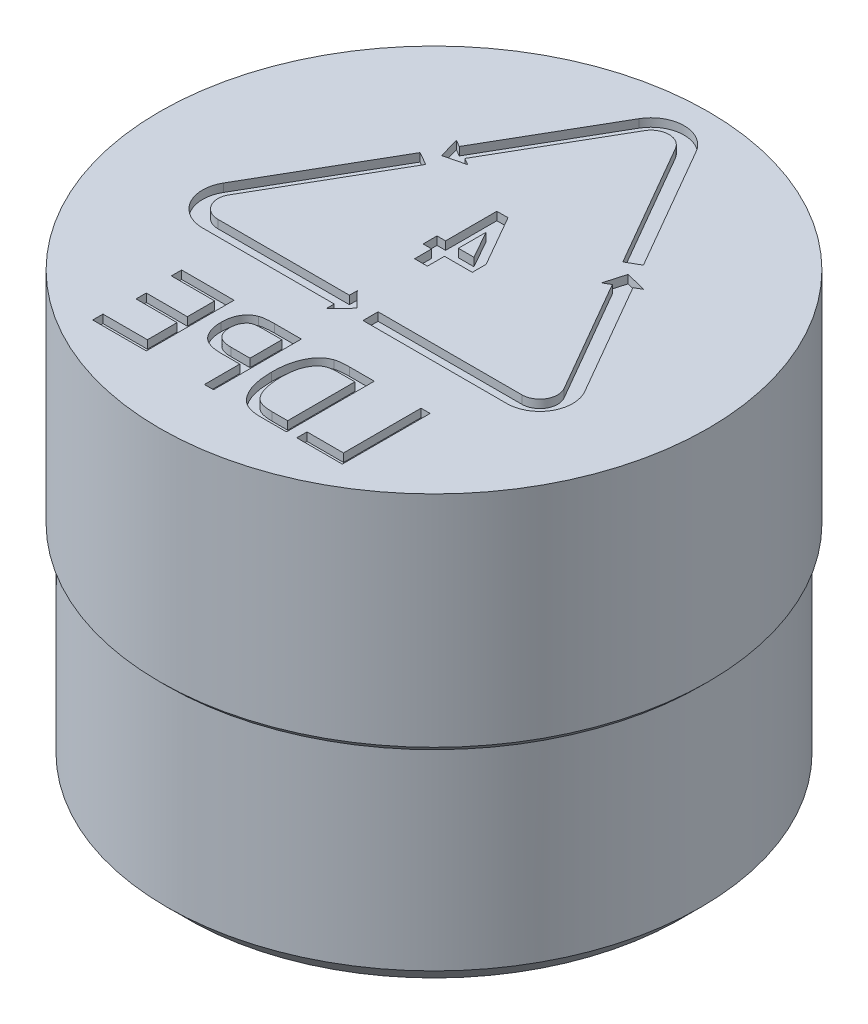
ISO-10303-21;
HEADER;
FILE_DESCRIPTION(('STEP AP214'),'2;1');
FILE_NAME('part.step','',(''),(''),'','','');
FILE_SCHEMA(('AUTOMOTIVE_DESIGN { 1 0 10303 214 1 1 1 1 }'));
ENDSEC;
DATA;
#1=APPLICATION_CONTEXT('core data for automotive mechanical design processes');
#2=APPLICATION_PROTOCOL_DEFINITION('international standard','automotive_design',2000,#1);
#3=PRODUCT_CONTEXT('',#1,'mechanical');
#4=PRODUCT('Part','Part','',(#3));
#5=PRODUCT_RELATED_PRODUCT_CATEGORY('part','',(#4));
#6=PRODUCT_DEFINITION_FORMATION('','',#4);
#7=PRODUCT_DEFINITION_CONTEXT('part definition',#1,'design');
#8=PRODUCT_DEFINITION('design','',#6,#7);
#9=PRODUCT_DEFINITION_SHAPE('','',#8);
#10=(LENGTH_UNIT() NAMED_UNIT(*) SI_UNIT(.MILLI.,.METRE.));
#11=(NAMED_UNIT(*) PLANE_ANGLE_UNIT() SI_UNIT($,.RADIAN.));
#12=(NAMED_UNIT(*) SI_UNIT($,.STERADIAN.) SOLID_ANGLE_UNIT());
#13=UNCERTAINTY_MEASURE_WITH_UNIT(LENGTH_MEASURE(1.E-05),#10,'distance_accuracy_value','');
#14=(GEOMETRIC_REPRESENTATION_CONTEXT(3) GLOBAL_UNCERTAINTY_ASSIGNED_CONTEXT((#13)) GLOBAL_UNIT_ASSIGNED_CONTEXT((#10,
#11,#12)) REPRESENTATION_CONTEXT('',''));
#15=CARTESIAN_POINT('',(0.,0.,0.));
#16=DIRECTION('',(0.,0.,1.));
#17=DIRECTION('',(1.,0.,0.));
#18=AXIS2_PLACEMENT_3D('',#15,#16,#17);
#19=CARTESIAN_POINT('',(0.,16.,0.));
#20=DIRECTION('',(0.,1.,0.));
#21=DIRECTION('',(0.,0.,1.));
#22=AXIS2_PLACEMENT_3D('',#19,#20,#21);
#23=PLANE('',#22);
#24=DIRECTION('',(1.,0.,0.));
#25=VECTOR('',#24,1.);
#26=CARTESIAN_POINT('',(-4.64220779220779,16.,7.8));
#27=LINE('',#26,#25);
#28=CARTESIAN_POINT('',(-4.64220779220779,16.,7.8));
#29=VERTEX_POINT('',#28);
#30=CARTESIAN_POINT('',(-2.68896103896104,16.,7.8));
#31=VERTEX_POINT('',#30);
#32=EDGE_CURVE('E52',#29,#31,#27,.T.);
#33=ORIENTED_EDGE('',*,*,#32,.F.);
#34=DIRECTION('',(0.,0.,1.));
#35=VECTOR('',#34,1.);
#36=CARTESIAN_POINT('',(-4.64220779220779,16.,7.42597402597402));
#37=LINE('',#36,#35);
#38=CARTESIAN_POINT('',(-4.64220779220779,16.,7.42597402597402));
#39=VERTEX_POINT('',#38);
#40=EDGE_CURVE('E621',#39,#29,#37,.T.);
#41=ORIENTED_EDGE('',*,*,#40,.F.);
#42=DIRECTION('',(-1.,0.,0.));
#43=VECTOR('',#42,1.);
#44=CARTESIAN_POINT('',(-3.02142857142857,16.,7.42597402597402));
#45=LINE('',#44,#43);
#46=CARTESIAN_POINT('',(-3.02142857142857,16.,7.42597402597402));
#47=VERTEX_POINT('',#46);
#48=EDGE_CURVE('E624',#47,#39,#45,.T.);
#49=ORIENTED_EDGE('',*,*,#48,.F.);
#50=DIRECTION('',(0.,0.,1.));
#51=VECTOR('',#50,1.);
#52=CARTESIAN_POINT('',(-3.02142857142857,16.,6.34545454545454));
#53=LINE('',#52,#51);
#54=CARTESIAN_POINT('',(-3.02142857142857,16.,6.34545454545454));
#55=VERTEX_POINT('',#54);
#56=EDGE_CURVE('E676',#55,#47,#53,.T.);
#57=ORIENTED_EDGE('',*,*,#56,.F.);
#58=DIRECTION('',(1.,0.,0.));
#59=VECTOR('',#58,1.);
#60=CARTESIAN_POINT('',(-4.51753246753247,16.,6.34545454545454));
#61=LINE('',#60,#59);
#62=CARTESIAN_POINT('',(-4.51753246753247,16.,6.34545454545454));
#63=VERTEX_POINT('',#62);
#64=EDGE_CURVE('E673',#63,#55,#61,.T.);
#65=ORIENTED_EDGE('',*,*,#64,.F.);
#66=DIRECTION('',(0.,0.,1.));
#67=VECTOR('',#66,1.);
#68=CARTESIAN_POINT('',(-4.51753246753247,16.,5.97142857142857));
#69=LINE('',#68,#67);
#70=CARTESIAN_POINT('',(-4.51753246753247,16.,5.97142857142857));
#71=VERTEX_POINT('',#70);
#72=EDGE_CURVE('E670',#71,#63,#69,.T.);
#73=ORIENTED_EDGE('',*,*,#72,.F.);
#74=DIRECTION('',(-1.,0.,0.));
#75=VECTOR('',#74,1.);
#76=CARTESIAN_POINT('',(-3.02142857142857,16.,5.97142857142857));
#77=LINE('',#76,#75);
#78=CARTESIAN_POINT('',(-3.02142857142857,16.,5.97142857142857));
#79=VERTEX_POINT('',#78);
#80=EDGE_CURVE('E667',#79,#71,#77,.T.);
#81=ORIENTED_EDGE('',*,*,#80,.F.);
#82=DIRECTION('',(0.,0.,1.));
#83=VECTOR('',#82,1.);
#84=CARTESIAN_POINT('',(-3.02142857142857,16.,4.97402597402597));
#85=LINE('',#84,#83);
#86=CARTESIAN_POINT('',(-3.02142857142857,16.,4.97402597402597));
#87=VERTEX_POINT('',#86);
#88=EDGE_CURVE('E664',#87,#79,#85,.T.);
#89=ORIENTED_EDGE('',*,*,#88,.F.);
#90=DIRECTION('',(1.,0.,0.));
#91=VECTOR('',#90,1.);
#92=CARTESIAN_POINT('',(-4.60064935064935,16.,4.97402597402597));
#93=LINE('',#92,#91);
#94=CARTESIAN_POINT('',(-4.60064935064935,16.,4.97402597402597));
#95=VERTEX_POINT('',#94);
#96=EDGE_CURVE('E661',#95,#87,#93,.T.);
#97=ORIENTED_EDGE('',*,*,#96,.F.);
#98=DIRECTION('',(0.,0.,1.));
#99=VECTOR('',#98,1.);
#100=CARTESIAN_POINT('',(-4.60064935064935,16.,4.6));
#101=LINE('',#100,#99);
#102=CARTESIAN_POINT('',(-4.60064935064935,16.,4.6));
#103=VERTEX_POINT('',#102);
#104=EDGE_CURVE('E658',#103,#95,#101,.T.);
#105=ORIENTED_EDGE('',*,*,#104,.F.);
#106=DIRECTION('',(-1.,0.,0.));
#107=VECTOR('',#106,1.);
#108=CARTESIAN_POINT('',(-2.68896103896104,16.,4.6));
#109=LINE('',#108,#107);
#110=CARTESIAN_POINT('',(-2.68896103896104,16.,4.6));
#111=VERTEX_POINT('',#110);
#112=EDGE_CURVE('E655',#111,#103,#109,.T.);
#113=ORIENTED_EDGE('',*,*,#112,.F.);
#114=DIRECTION('',(0.,0.,-1.));
#115=VECTOR('',#114,1.);
#116=CARTESIAN_POINT('',(-2.68896103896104,16.,7.8));
#117=LINE('',#116,#115);
#118=EDGE_CURVE('E653',#31,#111,#117,.T.);
#119=ORIENTED_EDGE('',*,*,#118,.F.);
#120=EDGE_LOOP('',(#33,#41,#49,#57,#65,#73,#81,#89,#97,#105,#113,#119));
#121=FACE_BOUND('',#120,.T.);
#122=DIRECTION('',(1.,0.,0.));
#123=VECTOR('',#122,1.);
#124=CARTESIAN_POINT('',(-0.569480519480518,16.,7.8));
#125=LINE('',#124,#123);
#126=CARTESIAN_POINT('',(-0.569480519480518,16.,7.8));
#127=VERTEX_POINT('',#126);
#128=CARTESIAN_POINT('',(-0.237012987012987,16.,7.8));
#129=VERTEX_POINT('',#128);
#130=EDGE_CURVE('E60',#127,#129,#125,.T.);
#131=ORIENTED_EDGE('',*,*,#130,.F.);
#132=DIRECTION('',(0.,0.,1.));
#133=VECTOR('',#132,1.);
#134=CARTESIAN_POINT('',(-0.569480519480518,16.,6.51168831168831));
#135=LINE('',#134,#133);
#136=CARTESIAN_POINT('',(-0.569480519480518,16.,6.51168831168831));
#137=VERTEX_POINT('',#136);
#138=EDGE_CURVE('E816',#137,#127,#135,.T.);
#139=ORIENTED_EDGE('',*,*,#138,.F.);
#140=DIRECTION('',(1.,0.,0.));
#141=VECTOR('',#140,1.);
#142=CARTESIAN_POINT('',(-1.24480519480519,16.,6.51168831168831));
#143=LINE('',#142,#141);
#144=CARTESIAN_POINT('',(-1.24480519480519,16.,6.51168831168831));
#145=VERTEX_POINT('',#144);
#146=EDGE_CURVE('E810',#145,#137,#143,.T.);
#147=ORIENTED_EDGE('',*,*,#146,.F.);
#148=CARTESIAN_POINT('',(-2.23181818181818,16.,5.52727272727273));
#149=CARTESIAN_POINT('',(-2.23126849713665,16.,5.56279612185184));
#150=CARTESIAN_POINT('',(-2.23019344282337,16.,5.63227154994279));
#151=CARTESIAN_POINT('',(-2.21963806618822,16.,5.73388784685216));
#152=CARTESIAN_POINT('',(-2.20209536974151,16.,5.83023453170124));
#153=CARTESIAN_POINT('',(-2.17816023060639,16.,5.9217744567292));
#154=CARTESIAN_POINT('',(-2.14707478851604,16.,6.0083693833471));
#155=CARTESIAN_POINT('',(-2.10858230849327,16.,6.08979175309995));
#156=CARTESIAN_POINT('',(-2.06342610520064,16.,6.16633316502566));
#157=CARTESIAN_POINT('',(-2.01187380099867,16.,6.23813643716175));
#158=CARTESIAN_POINT('',(-1.9511243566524,16.,6.30349473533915));
#159=CARTESIAN_POINT('',(-1.8794281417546,16.,6.35940828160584));
#160=CARTESIAN_POINT('',(-1.79831023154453,16.,6.40722904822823));
#161=CARTESIAN_POINT('',(-1.70675799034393,16.,6.44523907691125));
#162=CARTESIAN_POINT('',(-1.60570530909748,16.,6.47594090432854));
#163=CARTESIAN_POINT('',(-1.49423605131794,16.,6.49687076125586));
#164=CARTESIAN_POINT('',(-1.37278091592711,16.,6.50899302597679));
#165=CARTESIAN_POINT('',(-1.28855715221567,16.,6.51076685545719));
#166=CARTESIAN_POINT('',(-1.24480519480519,16.,6.51168831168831));
#167=B_SPLINE_CURVE_WITH_KNOTS('',3,(#148,#149,#150,#151,#152,#153,#154,#155,#156,#157,#158,
#159,#160,#161,#162,#163,#164,#165,#166),.UNSPECIFIED.,.F.,.F.,(4,1,1,1,1,1,1,1,1,1,1,1,1,1,1,1,
4),(0.,0.0666328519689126,0.130318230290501,0.191414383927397,0.250221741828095,
0.307644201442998,0.363778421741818,0.418940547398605,0.47417736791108,0.529339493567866,
0.585724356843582,0.644160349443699,0.705484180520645,0.771261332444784,0.841987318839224,
0.917916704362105,1.),.UNSPECIFIED.);
#168=CARTESIAN_POINT('',(-2.23181818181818,16.,5.52727272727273));
#169=VERTEX_POINT('',#168);
#170=EDGE_CURVE('E802',#169,#145,#167,.T.);
#171=ORIENTED_EDGE('',*,*,#170,.F.);
#172=CARTESIAN_POINT('',(-1.73571428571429,16.,4.66168831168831));
#173=CARTESIAN_POINT('',(-1.75428673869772,16.,4.66887686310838));
#174=CARTESIAN_POINT('',(-1.79138763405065,16.,4.68323693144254));
#175=CARTESIAN_POINT('',(-1.84364636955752,16.,4.71158663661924));
#176=CARTESIAN_POINT('',(-1.89349762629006,16.,4.74352542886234));
#177=CARTESIAN_POINT('',(-1.94037643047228,16.,4.7798853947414));
#178=CARTESIAN_POINT('',(-1.98400783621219,16.,4.82122694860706));
#179=CARTESIAN_POINT('',(-2.02507481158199,16.,4.86664173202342));
#180=CARTESIAN_POINT('',(-2.0627614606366,16.,4.91706335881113));
#181=CARTESIAN_POINT('',(-2.09748450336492,16.,4.97141790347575));
#182=CARTESIAN_POINT('',(-2.12981702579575,16.,5.02915699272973));
#183=CARTESIAN_POINT('',(-2.15651280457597,16.,5.09098668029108));
#184=CARTESIAN_POINT('',(-2.18049355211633,16.,5.1556033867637));
#185=CARTESIAN_POINT('',(-2.1987392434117,16.,5.22376392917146));
#186=CARTESIAN_POINT('',(-2.21415858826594,16.,5.29498616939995));
#187=CARTESIAN_POINT('',(-2.22397949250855,16.,5.36948596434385));
#188=CARTESIAN_POINT('',(-2.23097924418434,16.,5.44726903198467));
#189=CARTESIAN_POINT('',(-2.2315342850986,16.,5.50019945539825));
#190=CARTESIAN_POINT('',(-2.23181818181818,16.,5.52727272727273));
#191=B_SPLINE_CURVE_WITH_KNOTS('',3,(#172,#173,#174,#175,#176,#177,#178,#179,#180,#181,#182,
#183,#184,#185,#186,#187,#188,#189,#190),.UNSPECIFIED.,.F.,.F.,(4,1,1,1,1,1,1,1,1,1,1,1,1,1,1,1,
4),(0.,0.056072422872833,0.112011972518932,0.167171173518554,0.222810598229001,
0.278909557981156,0.336355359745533,0.3951582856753,0.456071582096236,0.518044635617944,
0.581404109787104,0.645661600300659,0.71210825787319,0.780060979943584,0.850885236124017,
0.923729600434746,1.),.UNSPECIFIED.);
#192=CARTESIAN_POINT('',(-1.73571428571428,16.,4.66168831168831));
#193=VERTEX_POINT('',#192);
#194=EDGE_CURVE('E794',#193,#169,#191,.T.);
#195=ORIENTED_EDGE('',*,*,#194,.F.);
#196=CARTESIAN_POINT('',(-1.22272727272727,16.,4.6));
#197=CARTESIAN_POINT('',(-1.25087176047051,16.,4.59997359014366));
#198=CARTESIAN_POINT('',(-1.30501754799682,16.,4.59992278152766));
#199=CARTESIAN_POINT('',(-1.38336162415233,16.,4.60375571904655));
#200=CARTESIAN_POINT('',(-1.45619895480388,16.,4.60762880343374));
#201=CARTESIAN_POINT('',(-1.52327404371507,16.,4.61510215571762));
#202=CARTESIAN_POINT('',(-1.58463763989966,16.,4.62326278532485));
#203=CARTESIAN_POINT('',(-1.64022707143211,16.,4.63346047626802));
#204=CARTESIAN_POINT('',(-1.69005343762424,16.,4.6463486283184));
#205=CARTESIAN_POINT('',(-1.72104705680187,16.,4.6567608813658));
#206=CARTESIAN_POINT('',(-1.73571428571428,16.,4.66168831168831));
#207=B_SPLINE_CURVE_WITH_KNOTS('',3,(#196,#197,#198,#199,#200,#201,#202,#203,#204,#205,#206),
.UNSPECIFIED.,.F.,.F.,(4,1,1,1,1,1,1,1,4),(0.,0.16264318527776,0.312901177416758,
0.453293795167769,0.584130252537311,0.702849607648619,0.811057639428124,0.910586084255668,1.),.UNSPECIFIED.);
#208=CARTESIAN_POINT('',(-1.22272727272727,16.,4.6));
#209=VERTEX_POINT('',#208);
#210=EDGE_CURVE('E789',#209,#193,#207,.T.);
#211=ORIENTED_EDGE('',*,*,#210,.F.);
#212=DIRECTION('',(-1.,0.,0.));
#213=VECTOR('',#212,1.);
#214=CARTESIAN_POINT('',(-0.237012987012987,16.,4.6));
#215=LINE('',#214,#213);
#216=CARTESIAN_POINT('',(-0.237012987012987,16.,4.6));
#217=VERTEX_POINT('',#216);
#218=EDGE_CURVE('E786',#217,#209,#215,.T.);
#219=ORIENTED_EDGE('',*,*,#218,.F.);
#220=DIRECTION('',(0.,0.,-1.));
#221=VECTOR('',#220,1.);
#222=CARTESIAN_POINT('',(-0.237012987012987,16.,7.8));
#223=LINE('',#222,#221);
#224=EDGE_CURVE('E782',#129,#217,#223,.T.);
#225=ORIENTED_EDGE('',*,*,#224,.F.);
#226=EDGE_LOOP('',(#131,#139,#147,#171,#195,#211,#219,#225));
#227=FACE_BOUND('',#226,.T.);
#228=DIRECTION('',(1.,0.,0.));
#229=VECTOR('',#228,1.);
#230=CARTESIAN_POINT('',(2.79675324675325,16.,7.8));
#231=LINE('',#230,#229);
#232=CARTESIAN_POINT('',(2.79675324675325,16.,7.8));
#233=VERTEX_POINT('',#232);
#234=CARTESIAN_POINT('',(4.45909090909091,16.,7.8));
#235=VERTEX_POINT('',#234);
#236=EDGE_CURVE('E936',#233,#235,#231,.T.);
#237=ORIENTED_EDGE('',*,*,#236,.F.);
#238=DIRECTION('',(0.,0.,1.));
#239=VECTOR('',#238,1.);
#240=CARTESIAN_POINT('',(2.79675324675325,16.,7.42597402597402));
#241=LINE('',#240,#239);
#242=CARTESIAN_POINT('',(2.79675324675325,16.,7.42597402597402));
#243=VERTEX_POINT('',#242);
#244=EDGE_CURVE('E951',#243,#233,#241,.T.);
#245=ORIENTED_EDGE('',*,*,#244,.F.);
#246=DIRECTION('',(-1.,0.,0.));
#247=VECTOR('',#246,1.);
#248=CARTESIAN_POINT('',(4.12662337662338,16.,7.42597402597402));
#249=LINE('',#248,#247);
#250=CARTESIAN_POINT('',(4.12662337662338,16.,7.42597402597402));
#251=VERTEX_POINT('',#250);
#252=EDGE_CURVE('E977',#251,#243,#249,.T.);
#253=ORIENTED_EDGE('',*,*,#252,.F.);
#254=DIRECTION('',(0.,0.,1.));
#255=VECTOR('',#254,1.);
#256=CARTESIAN_POINT('',(4.12662337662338,16.,4.6));
#257=LINE('',#256,#255);
#258=CARTESIAN_POINT('',(4.12662337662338,16.,4.6));
#259=VERTEX_POINT('',#258);
#260=EDGE_CURVE('E974',#259,#251,#257,.T.);
#261=ORIENTED_EDGE('',*,*,#260,.F.);
#262=DIRECTION('',(-1.,0.,0.));
#263=VECTOR('',#262,1.);
#264=CARTESIAN_POINT('',(4.45909090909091,16.,4.6));
#265=LINE('',#264,#263);
#266=CARTESIAN_POINT('',(4.45909090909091,16.,4.6));
#267=VERTEX_POINT('',#266);
#268=EDGE_CURVE('E971',#267,#259,#265,.T.);
#269=ORIENTED_EDGE('',*,*,#268,.F.);
#270=DIRECTION('',(0.,0.,-1.));
#271=VECTOR('',#270,1.);
#272=CARTESIAN_POINT('',(4.45909090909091,16.,7.8));
#273=LINE('',#272,#271);
#274=EDGE_CURVE('E968',#235,#267,#273,.T.);
#275=ORIENTED_EDGE('',*,*,#274,.F.);
#276=EDGE_LOOP('',(#237,#245,#253,#261,#269,#275));
#277=FACE_BOUND('',#276,.T.);
#278=DIRECTION('',(1.,0.,0.));
#279=VECTOR('',#278,1.);
#280=CARTESIAN_POINT('',(-0.708441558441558,16.,0.));
#281=LINE('',#280,#279);
#282=CARTESIAN_POINT('',(-0.708441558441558,16.,0.));
#283=VERTEX_POINT('',#282);
#284=CARTESIAN_POINT('',(-0.240909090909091,16.,0.));
#285=VERTEX_POINT('',#284);
#286=EDGE_CURVE('E1016',#283,#285,#281,.T.);
#287=ORIENTED_EDGE('',*,*,#286,.F.);
#288=DIRECTION('',(0.,0.,1.));
#289=VECTOR('',#288,1.);
#290=CARTESIAN_POINT('',(-0.708441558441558,16.,-0.623376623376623));
#291=LINE('',#290,#289);
#292=CARTESIAN_POINT('',(-0.708441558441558,16.,-0.623376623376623));
#293=VERTEX_POINT('',#292);
#294=EDGE_CURVE('E1021',#293,#283,#291,.T.);
#295=ORIENTED_EDGE('',*,*,#294,.F.);
#296=DIRECTION('',(1.,0.,0.));
#297=VECTOR('',#296,1.);
#298=CARTESIAN_POINT('',(-1.02012987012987,16.,-0.623376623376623));
#299=LINE('',#298,#297);
#300=CARTESIAN_POINT('',(-1.02012987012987,16.,-0.623376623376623));
#301=VERTEX_POINT('',#300);
#302=EDGE_CURVE('E1077',#301,#293,#299,.T.);
#303=ORIENTED_EDGE('',*,*,#302,.F.);
#304=DIRECTION('',(0.,0.,1.));
#305=VECTOR('',#304,1.);
#306=CARTESIAN_POINT('',(-1.02012987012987,16.,-1.12987012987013));
#307=LINE('',#306,#305);
#308=CARTESIAN_POINT('',(-1.02012987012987,16.,-1.12987012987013));
#309=VERTEX_POINT('',#308);
#310=EDGE_CURVE('E1074',#309,#301,#307,.T.);
#311=ORIENTED_EDGE('',*,*,#310,.F.);
#312=DIRECTION('',(-1.,0.,0.));
#313=VECTOR('',#312,1.);
#314=CARTESIAN_POINT('',(-0.708441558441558,16.,-1.12987012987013));
#315=LINE('',#314,#313);
#316=CARTESIAN_POINT('',(-0.708441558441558,16.,-1.12987012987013));
#317=VERTEX_POINT('',#316);
#318=EDGE_CURVE('E1071',#317,#309,#315,.T.);
#319=ORIENTED_EDGE('',*,*,#318,.F.);
#320=DIRECTION('',(0.,0.,1.));
#321=VECTOR('',#320,1.);
#322=CARTESIAN_POINT('',(-0.708441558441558,16.,-3.));
#323=LINE('',#322,#321);
#324=CARTESIAN_POINT('',(-0.708441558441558,16.,-3.));
#325=VERTEX_POINT('',#324);
#326=EDGE_CURVE('E1068',#325,#317,#323,.T.);
#327=ORIENTED_EDGE('',*,*,#326,.F.);
#328=DIRECTION('',(-1.,0.,0.));
#329=VECTOR('',#328,1.);
#330=CARTESIAN_POINT('',(-0.301785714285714,16.,-3.));
#331=LINE('',#330,#329);
#332=CARTESIAN_POINT('',(-0.301785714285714,16.,-3.));
#333=VERTEX_POINT('',#332);
#334=EDGE_CURVE('E1065',#333,#325,#331,.T.);
#335=ORIENTED_EDGE('',*,*,#334,.F.);
#336=DIRECTION('',(-0.497596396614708,0.,-0.867408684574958));
#337=VECTOR('',#336,1.);
#338=CARTESIAN_POINT('',(0.772077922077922,16.,-1.12804383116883));
#339=LINE('',#338,#337);
#340=CARTESIAN_POINT('',(0.772077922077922,16.,-1.12804383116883));
#341=VERTEX_POINT('',#340);
#342=EDGE_CURVE('E1062',#341,#333,#339,.T.);
#343=ORIENTED_EDGE('',*,*,#342,.F.);
#344=DIRECTION('',(0.,0.,-1.));
#345=VECTOR('',#344,1.);
#346=CARTESIAN_POINT('',(0.772077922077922,16.,-0.623376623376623));
#347=LINE('',#346,#345);
#348=CARTESIAN_POINT('',(0.772077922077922,16.,-0.623376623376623));
#349=VERTEX_POINT('',#348);
#350=EDGE_CURVE('E1059',#349,#341,#347,.T.);
#351=ORIENTED_EDGE('',*,*,#350,.F.);
#352=DIRECTION('',(1.,0.,0.));
#353=VECTOR('',#352,1.);
#354=CARTESIAN_POINT('',(-0.240909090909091,16.,-0.623376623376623));
#355=LINE('',#354,#353);
#356=CARTESIAN_POINT('',(-0.240909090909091,16.,-0.623376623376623));
#357=VERTEX_POINT('',#356);
#358=EDGE_CURVE('E1056',#357,#349,#355,.T.);
#359=ORIENTED_EDGE('',*,*,#358,.F.);
#360=DIRECTION('',(0.,0.,-1.));
#361=VECTOR('',#360,1.);
#362=CARTESIAN_POINT('',(-0.240909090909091,16.,0.));
#363=LINE('',#362,#361);
#364=EDGE_CURVE('E1053',#285,#357,#363,.T.);
#365=ORIENTED_EDGE('',*,*,#364,.F.);
#366=EDGE_LOOP('',(#287,#295,#303,#311,#319,#327,#335,#343,#351,#359,#365));
#367=FACE_BOUND('',#366,.T.);
#368=CARTESIAN_POINT('',(0.,16.,0.));
#369=DIRECTION('',(0.,1.,0.));
#370=DIRECTION('',(0.,0.,1.));
#371=AXIS2_PLACEMENT_3D('',#368,#369,#370);
#372=CIRCLE('',#371,10.);
#373=CARTESIAN_POINT('',(0.,16.,10.));
#374=VERTEX_POINT('',#373);
#375=EDGE_CURVE('E1380',#374,#374,#372,.T.);
#376=ORIENTED_EDGE('',*,*,#375,.T.);
#377=EDGE_LOOP('',(#376));
#378=FACE_BOUND('',#377,.T.);
#379=CARTESIAN_POINT('',(0.00235353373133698,16.,-7.91271625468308));
#380=DIRECTION('',(0.,-1.,0.));
#381=DIRECTION('',(0.,0.,1.));
#382=AXIS2_PLACEMENT_3D('',#379,#380,#381);
#383=CIRCLE('',#382,0.65);
#384=CARTESIAN_POINT('',(-0.56056297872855,16.,-8.23771625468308));
#385=VERTEX_POINT('',#384);
#386=CARTESIAN_POINT('',(0.565270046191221,16.,-8.23771625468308));
#387=VERTEX_POINT('',#386);
#388=EDGE_CURVE('E1260',#385,#387,#383,.T.);
#389=ORIENTED_EDGE('',*,*,#388,.F.);
#390=DIRECTION('',(0.499999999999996,0.,-0.866025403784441));
#391=VECTOR('',#390,1.);
#392=CARTESIAN_POINT('',(-0.56056297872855,16.,-8.23771625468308));
#393=LINE('',#392,#391);
#394=CARTESIAN_POINT('',(-2.95938621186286,16.,-4.08283253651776));
#395=VERTEX_POINT('',#394);
#396=EDGE_CURVE('E1285',#395,#385,#393,.T.);
#397=ORIENTED_EDGE('',*,*,#396,.F.);
#398=DIRECTION('',(-0.866025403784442,0.,-0.499999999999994));
#399=VECTOR('',#398,1.);
#400=CARTESIAN_POINT('',(-2.95938621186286,16.,-4.08283253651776));
#401=LINE('',#400,#399);
#402=CARTESIAN_POINT('',(-2.71107786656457,16.,-3.93947164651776));
#403=VERTEX_POINT('',#402);
#404=EDGE_CURVE('E1341',#403,#395,#401,.T.);
#405=ORIENTED_EDGE('',*,*,#404,.F.);
#406=DIRECTION('',(0.970328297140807,0.,-0.241791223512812));
#407=VECTOR('',#406,1.);
#408=CARTESIAN_POINT('',(-2.71107786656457,16.,-3.93947164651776));
#409=LINE('',#408,#407);
#410=CARTESIAN_POINT('',(-3.47144334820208,16.,-3.75));
#411=VERTEX_POINT('',#410);
#412=EDGE_CURVE('E1338',#411,#403,#409,.T.);
#413=ORIENTED_EDGE('',*,*,#412,.F.);
#414=DIRECTION('',(0.275766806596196,0.,0.961224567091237));
#415=VECTOR('',#414,1.);
#416=CARTESIAN_POINT('',(-3.47144334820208,16.,-3.75));
#417=LINE('',#416,#415);
#418=CARTESIAN_POINT('',(-3.6875388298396,16.,-4.50323164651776));
#419=VERTEX_POINT('',#418);
#420=EDGE_CURVE('E1335',#419,#411,#417,.T.);
#421=ORIENTED_EDGE('',*,*,#420,.F.);
#422=DIRECTION('',(-0.86602540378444,0.,-0.499999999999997));
#423=VECTOR('',#422,1.);
#424=CARTESIAN_POINT('',(-3.43923048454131,16.,-4.35987075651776));
#425=LINE('',#424,#423);
#426=CARTESIAN_POINT('',(-3.43923048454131,16.,-4.35987075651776));
#427=VERTEX_POINT('',#426);
#428=EDGE_CURVE('E1332',#427,#419,#425,.T.);
#429=ORIENTED_EDGE('',*,*,#428,.F.);
#430=DIRECTION('',(-0.499999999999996,0.,0.866025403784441));
#431=VECTOR('',#430,1.);
#432=CARTESIAN_POINT('',(-1.03923048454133,16.,-8.51679269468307));
#433=LINE('',#432,#431);
#434=CARTESIAN_POINT('',(-1.03923048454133,16.,-8.51679269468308));
#435=VERTEX_POINT('',#434);
#436=EDGE_CURVE('E1329',#435,#427,#433,.T.);
#437=ORIENTED_EDGE('',*,*,#436,.F.);
#438=CARTESIAN_POINT('',(0.,16.,-7.91679269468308));
#439=DIRECTION('',(0.,1.,0.));
#440=DIRECTION('',(0.,0.,1.));
#441=AXIS2_PLACEMENT_3D('',#438,#439,#440);
#442=CIRCLE('',#441,1.2);
#443=CARTESIAN_POINT('',(1.03923048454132,16.,-8.51679269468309));
#444=VERTEX_POINT('',#443);
#445=EDGE_CURVE('E1326',#444,#435,#442,.T.);
#446=ORIENTED_EDGE('',*,*,#445,.F.);
#447=DIRECTION('',(-0.500000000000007,0.,-0.866025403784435));
#448=VECTOR('',#447,1.);
#449=CARTESIAN_POINT('',(3.66423048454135,16.,-3.97015932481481));
#450=LINE('',#449,#448);
#451=CARTESIAN_POINT('',(3.66423048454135,16.,-3.97015932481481));
#452=VERTEX_POINT('',#451);
#453=EDGE_CURVE('E1323',#452,#444,#450,.T.);
#454=ORIENTED_EDGE('',*,*,#453,.F.);
#455=DIRECTION('',(0.866025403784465,0.,-0.499999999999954));
#456=VECTOR('',#455,1.);
#457=CARTESIAN_POINT('',(3.1879165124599,16.,-3.69515932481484));
#458=LINE('',#457,#456);
#459=CARTESIAN_POINT('',(3.1879165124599,16.,-3.69515932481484));
#460=VERTEX_POINT('',#459);
#461=EDGE_CURVE('E1320',#460,#452,#458,.T.);
#462=ORIENTED_EDGE('',*,*,#461,.F.);
#463=DIRECTION('',(0.500000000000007,0.,0.866025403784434));
#464=VECTOR('',#463,1.);
#465=CARTESIAN_POINT('',(0.565270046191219,16.,-8.23771625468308));
#466=LINE('',#465,#464);
#467=EDGE_CURVE('E1317',#387,#460,#466,.T.);
#468=ORIENTED_EDGE('',*,*,#467,.F.);
#469=EDGE_LOOP('',(#389,#397,#405,#413,#421,#429,#437,#446,#454,#462,#468));
#470=FACE_BOUND('',#469,.T.);
#471=DIRECTION('',(0.864363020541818,0.,-0.502868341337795));
#472=VECTOR('',#471,1.);
#473=CARTESIAN_POINT('',(4.18577482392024,16.,-3.06681500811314));
#474=LINE('',#473,#472);
#475=CARTESIAN_POINT('',(4.18577482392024,16.,-3.06681500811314));
#476=VERTEX_POINT('',#475);
#477=CARTESIAN_POINT('',(4.43360652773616,16.,-3.21099831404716));
#478=VERTEX_POINT('',#477);
#479=EDGE_CURVE('E1172',#476,#478,#474,.T.);
#480=ORIENTED_EDGE('',*,*,#479,.F.);
#481=DIRECTION('',(-0.5,0.,-0.866025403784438));
#482=VECTOR('',#481,1.);
#483=CARTESIAN_POINT('',(6.58550887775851,16.,1.08964629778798));
#484=LINE('',#483,#482);
#485=CARTESIAN_POINT('',(6.58550887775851,16.,1.08964629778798));
#486=VERTEX_POINT('',#485);
#487=EDGE_CURVE('E1197',#486,#476,#484,.T.);
#488=ORIENTED_EDGE('',*,*,#487,.F.);
#489=CARTESIAN_POINT('',(5.54627839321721,16.,1.68964629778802));
#490=DIRECTION('',(0.,1.,0.));
#491=DIRECTION('',(0.,0.,1.));
#492=AXIS2_PLACEMENT_3D('',#489,#490,#491);
#493=CIRCLE('',#492,1.19999999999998);
#494=CARTESIAN_POINT('',(5.54627839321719,16.,2.889646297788));
#495=VERTEX_POINT('',#494);
#496=EDGE_CURVE('E1253',#495,#486,#493,.T.);
#497=ORIENTED_EDGE('',*,*,#496,.F.);
#498=DIRECTION('',(1.,0.,0.));
#499=VECTOR('',#498,1.);
#500=CARTESIAN_POINT('',(0.30098895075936,16.,2.889646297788));
#501=LINE('',#500,#499);
#502=CARTESIAN_POINT('',(0.30098895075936,16.,2.889646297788));
#503=VERTEX_POINT('',#502);
#504=EDGE_CURVE('E1250',#503,#495,#501,.T.);
#505=ORIENTED_EDGE('',*,*,#504,.F.);
#506=DIRECTION('',(0.,0.,1.));
#507=VECTOR('',#506,1.);
#508=CARTESIAN_POINT('',(0.300988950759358,16.,2.339646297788));
#509=LINE('',#508,#507);
#510=CARTESIAN_POINT('',(0.300988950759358,16.,2.339646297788));
#511=VERTEX_POINT('',#510);
#512=EDGE_CURVE('E1247',#511,#503,#509,.T.);
#513=ORIENTED_EDGE('',*,*,#512,.F.);
#514=DIRECTION('',(-1.,0.,0.));
#515=VECTOR('',#514,1.);
#516=CARTESIAN_POINT('',(5.54628188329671,16.,2.33964629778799));
#517=LINE('',#516,#515);
#518=CARTESIAN_POINT('',(5.54628188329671,16.,2.33964629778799));
#519=VERTEX_POINT('',#518);
#520=EDGE_CURVE('E1244',#519,#511,#517,.T.);
#521=ORIENTED_EDGE('',*,*,#520,.F.);
#522=CARTESIAN_POINT('',(5.54628188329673,16.,1.68964629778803));
#523=DIRECTION('',(0.,-1.,0.));
#524=DIRECTION('',(0.,0.,1.));
#525=AXIS2_PLACEMENT_3D('',#522,#523,#524);
#526=CIRCLE('',#525,0.649999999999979);
#527=CARTESIAN_POINT('',(6.10919839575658,16.,1.364646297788));
#528=VERTEX_POINT('',#527);
#529=EDGE_CURVE('E1241',#528,#519,#526,.T.);
#530=ORIENTED_EDGE('',*,*,#529,.F.);
#531=DIRECTION('',(0.500000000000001,0.,0.866025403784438));
#532=VECTOR('',#531,1.);
#533=CARTESIAN_POINT('',(6.1091983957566,16.,1.36464629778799));
#534=LINE('',#533,#532);
#535=CARTESIAN_POINT('',(3.71037516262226,16.,-2.7902374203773));
#536=VERTEX_POINT('',#535);
#537=EDGE_CURVE('E1238',#536,#528,#534,.T.);
#538=ORIENTED_EDGE('',*,*,#537,.F.);
#539=DIRECTION('',(0.864363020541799,0.,-0.502868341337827));
#540=VECTOR('',#539,1.);
#541=CARTESIAN_POINT('',(3.71037516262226,16.,-2.7902374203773));
#542=LINE('',#541,#540);
#543=CARTESIAN_POINT('',(3.46254345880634,16.,-2.64605411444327));
#544=VERTEX_POINT('',#543);
#545=EDGE_CURVE('E1235',#544,#536,#542,.T.);
#546=ORIENTED_EDGE('',*,*,#545,.F.);
#547=DIRECTION('',(-0.272616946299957,0.,0.96212265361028));
#548=VECTOR('',#547,1.);
#549=CARTESIAN_POINT('',(3.46254345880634,16.,-2.64605411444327));
#550=LINE('',#549,#548);
#551=CARTESIAN_POINT('',(3.67607349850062,16.,-3.39964662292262));
#552=VERTEX_POINT('',#551);
#553=EDGE_CURVE('E1232',#552,#544,#550,.T.);
#554=ORIENTED_EDGE('',*,*,#553,.F.);
#555=DIRECTION('',(-0.970363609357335,0.,-0.241649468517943));
#556=VECTOR('',#555,1.);
#557=CARTESIAN_POINT('',(3.67607349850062,16.,-3.39964662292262));
#558=LINE('',#557,#556);
#559=EDGE_CURVE('E1229',#478,#552,#558,.T.);
#560=ORIENTED_EDGE('',*,*,#559,.F.);
#561=EDGE_LOOP('',(#480,#488,#497,#505,#513,#521,#530,#538,#546,#554,#560));
#562=FACE_BOUND('',#561,.T.);
#563=CARTESIAN_POINT('',(-5.54301631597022,16.,1.68806963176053));
#564=DIRECTION('',(0.,-1.,0.));
#565=DIRECTION('',(0.,0.,1.));
#566=AXIS2_PLACEMENT_3D('',#563,#564,#565);
#567=CIRCLE('',#566,0.64999999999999);
#568=CARTESIAN_POINT('',(-5.54301631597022,16.,2.33806963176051));
#569=VERTEX_POINT('',#568);
#570=CARTESIAN_POINT('',(-6.10593282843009,16.,1.36306963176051));
#571=VERTEX_POINT('',#570);
#572=EDGE_CURVE('E1084',#569,#571,#567,.T.);
#573=ORIENTED_EDGE('',*,*,#572,.F.);
#574=DIRECTION('',(-1.,0.,0.));
#575=VECTOR('',#574,1.);
#576=CARTESIAN_POINT('',(-5.54301631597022,16.,2.33806963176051));
#577=LINE('',#576,#575);
#578=CARTESIAN_POINT('',(-0.745369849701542,16.,2.33806963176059));
#579=VERTEX_POINT('',#578);
#580=EDGE_CURVE('E1109',#579,#569,#577,.T.);
#581=ORIENTED_EDGE('',*,*,#580,.F.);
#582=DIRECTION('',(0.,0.,1.));
#583=VECTOR('',#582,1.);
#584=CARTESIAN_POINT('',(-0.745369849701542,16.,2.33806963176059));
#585=LINE('',#584,#583);
#586=CARTESIAN_POINT('',(-0.745369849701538,16.,2.05134785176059));
#587=VERTEX_POINT('',#586);
#588=EDGE_CURVE('E1165',#587,#579,#585,.T.);
#589=ORIENTED_EDGE('',*,*,#588,.F.);
#590=DIRECTION('',(-0.694561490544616,0.,-0.719433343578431));
#591=VECTOR('',#590,1.);
#592=CARTESIAN_POINT('',(-0.745369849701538,16.,2.05134785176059));
#593=LINE('',#592,#591);
#594=CARTESIAN_POINT('',(-0.201099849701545,16.,2.61510785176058));
#595=VERTEX_POINT('',#594);
#596=EDGE_CURVE('E1162',#595,#587,#593,.T.);
#597=ORIENTED_EDGE('',*,*,#596,.F.);
#598=DIRECTION('',(0.694561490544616,0.,-0.719433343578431));
#599=VECTOR('',#598,1.);
#600=CARTESIAN_POINT('',(-0.201099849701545,16.,2.61510785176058));
#601=LINE('',#600,#599);
#602=CARTESIAN_POINT('',(-0.745369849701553,16.,3.17886785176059));
#603=VERTEX_POINT('',#602);
#604=EDGE_CURVE('E1159',#603,#595,#601,.T.);
#605=ORIENTED_EDGE('',*,*,#604,.F.);
#606=DIRECTION('',(2.9419086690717E-13,0.,1.));
#607=VECTOR('',#606,1.);
#608=CARTESIAN_POINT('',(-0.745369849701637,16.,2.89214607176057));
#609=LINE('',#608,#607);
#610=CARTESIAN_POINT('',(-0.745369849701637,16.,2.89214607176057));
#611=VERTEX_POINT('',#610);
#612=EDGE_CURVE('E1156',#611,#603,#609,.T.);
#613=ORIENTED_EDGE('',*,*,#612,.F.);
#614=DIRECTION('',(1.,0.,0.));
#615=VECTOR('',#614,1.);
#616=CARTESIAN_POINT('',(-5.54536984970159,16.,2.89214607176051));
#617=LINE('',#616,#615);
#618=CARTESIAN_POINT('',(-5.54536984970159,16.,2.89214607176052));
#619=VERTEX_POINT('',#618);
#620=EDGE_CURVE('E1153',#619,#611,#617,.T.);
#621=ORIENTED_EDGE('',*,*,#620,.F.);
#622=CARTESIAN_POINT('',(-5.54536984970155,16.,1.69214607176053));
#623=DIRECTION('',(0.,1.,0.));
#624=DIRECTION('',(0.,0.,1.));
#625=AXIS2_PLACEMENT_3D('',#622,#623,#624);
#626=CIRCLE('',#625,1.19999999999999);
#627=CARTESIAN_POINT('',(-6.58460033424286,16.,1.09214607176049));
#628=VERTEX_POINT('',#627);
#629=EDGE_CURVE('E1150',#628,#619,#626,.T.);
#630=ORIENTED_EDGE('',*,*,#629,.F.);
#631=DIRECTION('',(-0.500000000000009,0.,0.866025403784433));
#632=VECTOR('',#631,1.);
#633=CARTESIAN_POINT('',(-3.9596003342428,16.,-3.4544872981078));
#634=LINE('',#633,#632);
#635=CARTESIAN_POINT('',(-3.9596003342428,16.,-3.4544872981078));
#636=VERTEX_POINT('',#635);
#637=EDGE_CURVE('E1147',#636,#628,#634,.T.);
#638=ORIENTED_EDGE('',*,*,#637,.F.);
#639=DIRECTION('',(-0.86602540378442,0.,-0.500000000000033));
#640=VECTOR('',#639,1.);
#641=CARTESIAN_POINT('',(-3.48328636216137,16.,-3.17948729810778));
#642=LINE('',#641,#640);
#643=CARTESIAN_POINT('',(-3.48328636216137,16.,-3.17948729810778));
#644=VERTEX_POINT('',#643);
#645=EDGE_CURVE('E1144',#644,#636,#642,.T.);
#646=ORIENTED_EDGE('',*,*,#645,.F.);
#647=DIRECTION('',(0.500000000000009,0.,-0.866025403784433));
#648=VECTOR('',#647,1.);
#649=CARTESIAN_POINT('',(-6.10593282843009,16.,1.3630696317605));
#650=LINE('',#649,#648);
#651=EDGE_CURVE('E1141',#571,#644,#650,.T.);
#652=ORIENTED_EDGE('',*,*,#651,.F.);
#653=EDGE_LOOP('',(#573,#581,#589,#597,#605,#613,#621,#630,#638,#646,#652));
#654=FACE_BOUND('',#653,.T.);
#655=DIRECTION('',(1.,0.,0.));
#656=VECTOR('',#655,1.);
#657=CARTESIAN_POINT('',(1.47922077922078,16.,7.8));
#658=LINE('',#657,#656);
#659=CARTESIAN_POINT('',(1.47922077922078,16.,7.8));
#660=VERTEX_POINT('',#659);
#661=CARTESIAN_POINT('',(2.42272727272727,16.,7.8));
#662=VERTEX_POINT('',#661);
#663=EDGE_CURVE('E897',#660,#662,#658,.T.);
#664=ORIENTED_EDGE('',*,*,#663,.F.);
#665=CARTESIAN_POINT('',(0.261688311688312,16.,6.18246753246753));
#666=CARTESIAN_POINT('',(0.262234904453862,16.,6.22684814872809));
#667=CARTESIAN_POINT('',(0.263310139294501,16.,6.3141518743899));
#668=CARTESIAN_POINT('',(0.270342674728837,16.,6.44242866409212));
#669=CARTESIAN_POINT('',(0.282701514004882,16.,6.56570987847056));
#670=CARTESIAN_POINT('',(0.299929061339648,16.,6.68366189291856));
#671=CARTESIAN_POINT('',(0.322999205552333,16.,6.79646248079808));
#672=CARTESIAN_POINT('',(0.349849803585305,16.,6.9043630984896));
#673=CARTESIAN_POINT('',(0.382497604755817,16.,7.00703051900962));
#674=CARTESIAN_POINT('',(0.419244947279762,16.,7.10419966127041));
#675=CARTESIAN_POINT('',(0.46016730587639,16.,7.19520764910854));
#676=CARTESIAN_POINT('',(0.5044027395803,16.,7.27964232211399));
#677=CARTESIAN_POINT('',(0.550726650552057,16.,7.3576124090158));
#678=CARTESIAN_POINT('',(0.600422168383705,16.,7.42839809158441));
#679=CARTESIAN_POINT('',(0.653107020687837,16.,7.49209951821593));
#680=CARTESIAN_POINT('',(0.708207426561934,16.,7.54947911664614));
#681=CARTESIAN_POINT('',(0.766206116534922,16.,7.60006191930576));
#682=CARTESIAN_POINT('',(0.827909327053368,16.,7.64299907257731));
#683=CARTESIAN_POINT('',(0.892935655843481,16.,7.68070880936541));
#684=CARTESIAN_POINT('',(0.962775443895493,16.,7.71214988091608));
#685=CARTESIAN_POINT('',(1.03705237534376,16.,7.73981536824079));
#686=CARTESIAN_POINT('',(1.11648462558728,16.,7.76143506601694));
#687=CARTESIAN_POINT('',(1.20034676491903,16.,7.77915627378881));
#688=CARTESIAN_POINT('',(1.28909392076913,16.,7.79135091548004));
#689=CARTESIAN_POINT('',(1.38256779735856,16.,7.7984111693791));
#690=CARTESIAN_POINT('',(1.44652450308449,16.,7.79946252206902));
#691=CARTESIAN_POINT('',(1.47922077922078,16.,7.8));
#692=B_SPLINE_CURVE_WITH_KNOTS('',3,(#665,#666,#667,#668,#669,#670,#671,#672,#673,#674,#675,
#676,#677,#678,#679,#680,#681,#682,#683,#684,#685,#686,#687,#688,#689,#690,#691),.UNSPECIFIED.,
.F.,.F.,(4,1,1,1,1,1,1,1,1,1,1,1,1,1,1,1,1,1,1,1,1,1,1,1,4),(0.,0.0577553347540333,
0.113613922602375,0.167119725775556,0.218946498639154,0.268664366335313,0.316896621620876,
0.363577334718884,0.408777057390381,0.452021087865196,0.493346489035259,0.532765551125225,
0.569964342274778,0.605777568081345,0.640240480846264,0.673390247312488,0.705742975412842,
0.737921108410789,0.771070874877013,0.805292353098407,0.840966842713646,0.878090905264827,
0.916771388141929,0.957451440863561,1.),.UNSPECIFIED.);
#693=CARTESIAN_POINT('',(0.261688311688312,16.,6.18246753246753));
#694=VERTEX_POINT('',#693);
#695=EDGE_CURVE('E922',#694,#660,#692,.T.);
#696=ORIENTED_EDGE('',*,*,#695,.F.);
#697=CARTESIAN_POINT('',(1.01168831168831,16.,4.65909090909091));
#698=CARTESIAN_POINT('',(0.974377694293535,16.,4.67335298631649));
#699=CARTESIAN_POINT('',(0.899730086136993,16.,4.70188722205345));
#700=CARTESIAN_POINT('',(0.796147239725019,16.,4.7651407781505));
#701=CARTESIAN_POINT('',(0.70074513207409,16.,4.84409938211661));
#702=CARTESIAN_POINT('',(0.612800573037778,16.,4.93814990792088));
#703=CARTESIAN_POINT('',(0.533951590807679,16.,5.04713607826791));
#704=CARTESIAN_POINT('',(0.463550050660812,16.,5.16916034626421));
#705=CARTESIAN_POINT('',(0.40333477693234,16.,5.30470867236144));
#706=CARTESIAN_POINT('',(0.352008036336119,16.,5.45320597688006));
#707=CARTESIAN_POINT('',(0.31114551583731,16.,5.61543085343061));
#708=CARTESIAN_POINT('',(0.282383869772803,16.,5.79179510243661));
#709=CARTESIAN_POINT('',(0.26474827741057,16.,5.98232363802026));
#710=CARTESIAN_POINT('',(0.262731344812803,16.,6.11424562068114));
#711=CARTESIAN_POINT('',(0.261688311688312,16.,6.18246753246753));
#712=B_SPLINE_CURVE_WITH_KNOTS('',3,(#697,#698,#699,#700,#701,#702,#703,#704,#705,#706,#707,
#708,#709,#710,#711),.UNSPECIFIED.,.F.,.F.,(4,1,1,1,1,1,1,1,1,1,1,1,4),(0.,0.066129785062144,
0.132306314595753,0.200143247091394,0.270994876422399,0.345231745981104,0.422745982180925,
0.504203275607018,0.590817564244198,0.683012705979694,0.781266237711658,0.886884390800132,1.),.UNSPECIFIED.);
#713=CARTESIAN_POINT('',(1.01168831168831,16.,4.65909090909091));
#714=VERTEX_POINT('',#713);
#715=EDGE_CURVE('E914',#714,#694,#712,.T.);
#716=ORIENTED_EDGE('',*,*,#715,.F.);
#717=CARTESIAN_POINT('',(1.52077922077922,16.,4.6));
#718=CARTESIAN_POINT('',(1.49371798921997,16.,4.59999173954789));
#719=CARTESIAN_POINT('',(1.44108885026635,16.,4.59997567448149));
#720=CARTESIAN_POINT('',(1.36489593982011,16.,4.60364773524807));
#721=CARTESIAN_POINT('',(1.29363470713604,16.,4.60792262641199));
#722=CARTESIAN_POINT('',(1.22754288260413,16.,4.61424524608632));
#723=CARTESIAN_POINT('',(1.166330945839,16.,4.62299836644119));
#724=CARTESIAN_POINT('',(1.10998874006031,16.,4.63201256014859));
#725=CARTESIAN_POINT('',(1.058968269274,16.,4.64467083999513));
#726=CARTESIAN_POINT('',(1.02701763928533,16.,4.65441556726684));
#727=CARTESIAN_POINT('',(1.01168831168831,16.,4.65909090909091));
#728=B_SPLINE_CURVE_WITH_KNOTS('',3,(#717,#718,#719,#720,#721,#722,#723,#724,#725,#726,#727),
.UNSPECIFIED.,.F.,.F.,(4,1,1,1,1,1,1,1,4),(0.,0.157768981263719,0.306831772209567,
0.444685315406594,0.574037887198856,0.693805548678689,0.805229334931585,0.906552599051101,1.),.UNSPECIFIED.);
#729=CARTESIAN_POINT('',(1.52077922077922,16.,4.6));
#730=VERTEX_POINT('',#729);
#731=EDGE_CURVE('E909',#730,#714,#728,.T.);
#732=ORIENTED_EDGE('',*,*,#731,.F.);
#733=DIRECTION('',(-1.,0.,0.));
#734=VECTOR('',#733,1.);
#735=CARTESIAN_POINT('',(2.42272727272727,16.,4.6));
#736=LINE('',#735,#734);
#737=CARTESIAN_POINT('',(2.42272727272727,16.,4.6));
#738=VERTEX_POINT('',#737);
#739=EDGE_CURVE('E906',#738,#730,#736,.T.);
#740=ORIENTED_EDGE('',*,*,#739,.F.);
#741=DIRECTION('',(0.,0.,-1.));
#742=VECTOR('',#741,1.);
#743=CARTESIAN_POINT('',(2.42272727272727,16.,7.8));
#744=LINE('',#743,#742);
#745=EDGE_CURVE('E902',#662,#738,#744,.T.);
#746=ORIENTED_EDGE('',*,*,#745,.F.);
#747=EDGE_LOOP('',(#664,#696,#716,#732,#740,#746));
#748=FACE_BOUND('',#747,.T.);
#749=ADVANCED_FACE('F37',(#121,#227,#277,#367,#378,#470,#562,#654,#748),#23,.T.);
#750=CARTESIAN_POINT('',(0.,36.769771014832,0.));
#751=DIRECTION('',(0.,1.,0.));
#752=DIRECTION('',(0.,0.,1.));
#753=AXIS2_PLACEMENT_3D('',#750,#751,#752);
#754=CYLINDRICAL_SURFACE('',#753,10.);
#755=CARTESIAN_POINT('',(0.,8.,0.));
#756=DIRECTION('',(0.,1.,0.));
#757=DIRECTION('',(0.,0.,1.));
#758=AXIS2_PLACEMENT_3D('',#755,#756,#757);
#759=CIRCLE('',#758,10.);
#760=CARTESIAN_POINT('',(0.,8.,10.));
#761=VERTEX_POINT('',#760);
#762=EDGE_CURVE('E1377',#761,#761,#759,.T.);
#763=ORIENTED_EDGE('',*,*,#762,.T.);
#764=EDGE_LOOP('',(#763));
#765=FACE_BOUND('',#764,.T.);
#766=ORIENTED_EDGE('',*,*,#375,.F.);
#767=EDGE_LOOP('',(#766));
#768=FACE_BOUND('',#767,.T.);
#769=ADVANCED_FACE('F1403',(#765,#768),#754,.T.);
#770=CARTESIAN_POINT('',(0.,8.,0.));
#771=DIRECTION('',(0.,1.,0.));
#772=DIRECTION('',(0.,0.,1.));
#773=AXIS2_PLACEMENT_3D('',#770,#771,#772);
#774=CONICAL_SURFACE('',#773,10.,0.785398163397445);
#775=CARTESIAN_POINT('',(0.,7.74499999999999,0.));
#776=DIRECTION('',(0.,1.,0.));
#777=DIRECTION('',(0.,0.,1.));
#778=AXIS2_PLACEMENT_3D('',#775,#776,#777);
#779=CIRCLE('',#778,9.74499999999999);
#780=CARTESIAN_POINT('',(0.,7.74499999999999,9.74499999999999));
#781=VERTEX_POINT('',#780);
#782=EDGE_CURVE('E1374',#781,#781,#779,.T.);
#783=ORIENTED_EDGE('',*,*,#782,.T.);
#784=EDGE_LOOP('',(#783));
#785=FACE_BOUND('',#784,.T.);
#786=ORIENTED_EDGE('',*,*,#762,.F.);
#787=EDGE_LOOP('',(#786));
#788=FACE_BOUND('',#787,.T.);
#789=ADVANCED_FACE('F1410',(#785,#788),#774,.T.);
#790=CARTESIAN_POINT('',(0.,36.769771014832,0.));
#791=DIRECTION('',(0.,1.,0.));
#792=DIRECTION('',(0.,0.,1.));
#793=AXIS2_PLACEMENT_3D('',#790,#791,#792);
#794=CYLINDRICAL_SURFACE('',#793,9.74499999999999);
#795=CARTESIAN_POINT('',(0.,0.760000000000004,0.));
#796=DIRECTION('',(0.,-1.,0.));
#797=DIRECTION('',(0.,0.,-1.));
#798=AXIS2_PLACEMENT_3D('',#795,#796,#797);
#799=CIRCLE('',#798,9.74499999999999);
#800=CARTESIAN_POINT('',(0.,0.760000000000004,-9.74499999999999));
#801=VERTEX_POINT('',#800);
#802=EDGE_CURVE('E45',#801,#801,#799,.F.);
#803=ORIENTED_EDGE('',*,*,#802,.T.);
#804=EDGE_LOOP('',(#803));
#805=FACE_BOUND('',#804,.T.);
#806=ORIENTED_EDGE('',*,*,#782,.F.);
#807=EDGE_LOOP('',(#806));
#808=FACE_BOUND('',#807,.T.);
#809=ADVANCED_FACE('F1385',(#805,#808),#794,.T.);
#810=CARTESIAN_POINT('',(-9.74499999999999,0.,0.));
#811=DIRECTION('',(0.,-1.,0.));
#812=DIRECTION('',(0.,0.,-1.));
#813=AXIS2_PLACEMENT_3D('',#810,#811,#812);
#814=PLANE('',#813);
#815=CARTESIAN_POINT('',(0.,0.,0.));
#816=DIRECTION('',(0.,-1.,0.));
#817=DIRECTION('',(0.,0.,-1.));
#818=AXIS2_PLACEMENT_3D('',#815,#816,#817);
#819=CIRCLE('',#818,2.5);
#820=CARTESIAN_POINT('',(0.,0.,-2.5));
#821=VERTEX_POINT('',#820);
#822=EDGE_CURVE('E1348',#821,#821,#819,.T.);
#823=ORIENTED_EDGE('',*,*,#822,.F.);
#824=EDGE_LOOP('',(#823));
#825=FACE_BOUND('',#824,.T.);
#826=CARTESIAN_POINT('',(0.,0.,0.));
#827=DIRECTION('',(0.,-1.,0.));
#828=DIRECTION('',(0.,0.,-1.));
#829=AXIS2_PLACEMENT_3D('',#826,#827,#828);
#830=CIRCLE('',#829,8.98499999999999);
#831=CARTESIAN_POINT('',(0.,0.,-8.98499999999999));
#832=VERTEX_POINT('',#831);
#833=EDGE_CURVE('E11',#832,#832,#830,.T.);
#834=ORIENTED_EDGE('',*,*,#833,.T.);
#835=EDGE_LOOP('',(#834));
#836=FACE_BOUND('',#835,.T.);
#837=ADVANCED_FACE('F1390',(#825,#836),#814,.T.);
#838=CARTESIAN_POINT('',(0.,0.760000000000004,0.));
#839=DIRECTION('',(0.,1.,0.));
#840=DIRECTION('',(0.,0.,1.));
#841=AXIS2_PLACEMENT_3D('',#838,#839,#840);
#842=CONICAL_SURFACE('',#841,9.74499999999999,0.785398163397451);
#843=ORIENTED_EDGE('',*,*,#833,.F.);
#844=EDGE_LOOP('',(#843));
#845=FACE_BOUND('',#844,.T.);
#846=ORIENTED_EDGE('',*,*,#802,.F.);
#847=EDGE_LOOP('',(#846));
#848=FACE_BOUND('',#847,.T.);
#849=ADVANCED_FACE('F39',(#845,#848),#842,.T.);
#850=CARTESIAN_POINT('',(0.,6.,0.));
#851=DIRECTION('',(0.,1.,0.));
#852=DIRECTION('',(0.,0.,1.));
#853=AXIS2_PLACEMENT_3D('',#850,#851,#852);
#854=PLANE('',#853);
#855=CARTESIAN_POINT('',(0.,6.,0.));
#856=DIRECTION('',(0.,-1.,0.));
#857=DIRECTION('',(0.,0.,-1.));
#858=AXIS2_PLACEMENT_3D('',#855,#856,#857);
#859=CIRCLE('',#858,2.5);
#860=CARTESIAN_POINT('',(0.,6.,-2.5));
#861=VERTEX_POINT('',#860);
#862=EDGE_CURVE('E1371',#861,#861,#859,.T.);
#863=ORIENTED_EDGE('',*,*,#862,.T.);
#864=EDGE_LOOP('',(#863));
#865=FACE_BOUND('',#864,.T.);
#866=ADVANCED_FACE('F1389',(#865),#854,.F.);
#867=CARTESIAN_POINT('',(0.,0.,0.));
#868=DIRECTION('',(0.,-1.,0.));
#869=DIRECTION('',(0.,0.,-1.));
#870=AXIS2_PLACEMENT_3D('',#867,#868,#869);
#871=CYLINDRICAL_SURFACE('',#870,2.5);
#872=ORIENTED_EDGE('',*,*,#862,.F.);
#873=EDGE_LOOP('',(#872));
#874=FACE_BOUND('',#873,.T.);
#875=ORIENTED_EDGE('',*,*,#822,.T.);
#876=EDGE_LOOP('',(#875));
#877=FACE_BOUND('',#876,.T.);
#878=ADVANCED_FACE('F1396',(#874,#877),#871,.F.);
#879=CARTESIAN_POINT('',(0.00235353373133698,15.7,-7.91271625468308));
#880=DIRECTION('',(0.,1.,0.));
#881=DIRECTION('',(0.,0.,1.));
#882=AXIS2_PLACEMENT_3D('',#879,#880,#881);
#883=CYLINDRICAL_SURFACE('',#882,0.65);
#884=ORIENTED_EDGE('',*,*,#388,.T.);
#885=DIRECTION('',(0.,1.,0.));
#886=VECTOR('',#885,1.);
#887=CARTESIAN_POINT('',(0.565270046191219,15.7,-8.23771625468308));
#888=LINE('',#887,#886);
#889=CARTESIAN_POINT('',(0.565270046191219,15.7,-8.23771625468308));
#890=VERTEX_POINT('',#889);
#891=EDGE_CURVE('E1315',#890,#387,#888,.T.);
#892=ORIENTED_EDGE('',*,*,#891,.F.);
#893=CARTESIAN_POINT('',(0.00235353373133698,15.7,-7.91271625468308));
#894=DIRECTION('',(0.,-1.,0.));
#895=DIRECTION('',(0.,0.,1.));
#896=AXIS2_PLACEMENT_3D('',#893,#894,#895);
#897=CIRCLE('',#896,0.65);
#898=CARTESIAN_POINT('',(-0.56056297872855,15.7,-8.23771625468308));
#899=VERTEX_POINT('',#898);
#900=EDGE_CURVE('E1281',#899,#890,#897,.T.);
#901=ORIENTED_EDGE('',*,*,#900,.F.);
#902=DIRECTION('',(0.,1.,0.));
#903=VECTOR('',#902,1.);
#904=CARTESIAN_POINT('',(-0.56056297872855,15.7,-8.23771625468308));
#905=LINE('',#904,#903);
#906=EDGE_CURVE('E1346',#899,#385,#905,.T.);
#907=ORIENTED_EDGE('',*,*,#906,.T.);
#908=EDGE_LOOP('',(#884,#892,#901,#907));
#909=FACE_BOUND('',#908,.T.);
#910=ADVANCED_FACE('F1714',(#909),#883,.T.);
#911=CARTESIAN_POINT('',(-0.56056297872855,15.7,-8.23771625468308));
#912=DIRECTION('',(0.866025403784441,0.,0.499999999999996));
#913=DIRECTION('',(0.499999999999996,0.,-0.866025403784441));
#914=AXIS2_PLACEMENT_3D('',#911,#912,#913);
#915=PLANE('',#914);
#916=ORIENTED_EDGE('',*,*,#396,.T.);
#917=ORIENTED_EDGE('',*,*,#906,.F.);
#918=DIRECTION('',(0.499999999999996,0.,-0.866025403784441));
#919=VECTOR('',#918,1.);
#920=CARTESIAN_POINT('',(-0.56056297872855,15.7,-8.23771625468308));
#921=LINE('',#920,#919);
#922=CARTESIAN_POINT('',(-2.95938621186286,15.7,-4.08283253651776));
#923=VERTEX_POINT('',#922);
#924=EDGE_CURVE('E1312',#923,#899,#921,.T.);
#925=ORIENTED_EDGE('',*,*,#924,.F.);
#926=DIRECTION('',(0.,1.,0.));
#927=VECTOR('',#926,1.);
#928=CARTESIAN_POINT('',(-2.95938621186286,15.7,-4.08283253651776));
#929=LINE('',#928,#927);
#930=EDGE_CURVE('E1349',#923,#395,#929,.T.);
#931=ORIENTED_EDGE('',*,*,#930,.T.);
#932=EDGE_LOOP('',(#916,#917,#925,#931));
#933=FACE_BOUND('',#932,.T.);
#934=ADVANCED_FACE('F1710',(#933),#915,.F.);
#935=CARTESIAN_POINT('',(-2.95938621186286,15.7,-4.08283253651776));
#936=DIRECTION('',(0.499999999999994,0.,-0.866025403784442));
#937=DIRECTION('',(-0.866025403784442,0.,-0.499999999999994));
#938=AXIS2_PLACEMENT_3D('',#935,#936,#937);
#939=PLANE('',#938);
#940=ORIENTED_EDGE('',*,*,#404,.T.);
#941=ORIENTED_EDGE('',*,*,#930,.F.);
#942=DIRECTION('',(-0.866025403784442,0.,-0.499999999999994));
#943=VECTOR('',#942,1.);
#944=CARTESIAN_POINT('',(-2.95938621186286,15.7,-4.08283253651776));
#945=LINE('',#944,#943);
#946=CARTESIAN_POINT('',(-2.71107786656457,15.7,-3.93947164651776));
#947=VERTEX_POINT('',#946);
#948=EDGE_CURVE('E1309',#947,#923,#945,.T.);
#949=ORIENTED_EDGE('',*,*,#948,.F.);
#950=DIRECTION('',(0.,1.,0.));
#951=VECTOR('',#950,1.);
#952=CARTESIAN_POINT('',(-2.71107786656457,15.7,-3.93947164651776));
#953=LINE('',#952,#951);
#954=EDGE_CURVE('E1351',#947,#403,#953,.T.);
#955=ORIENTED_EDGE('',*,*,#954,.T.);
#956=EDGE_LOOP('',(#940,#941,#949,#955));
#957=FACE_BOUND('',#956,.T.);
#958=ADVANCED_FACE('F1713',(#957),#939,.F.);
#959=CARTESIAN_POINT('',(-2.71107786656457,15.7,-3.93947164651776));
#960=DIRECTION('',(0.241791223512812,0.,0.970328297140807));
#961=DIRECTION('',(0.970328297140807,0.,-0.241791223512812));
#962=AXIS2_PLACEMENT_3D('',#959,#960,#961);
#963=PLANE('',#962);
#964=ORIENTED_EDGE('',*,*,#412,.T.);
#965=ORIENTED_EDGE('',*,*,#954,.F.);
#966=DIRECTION('',(0.970328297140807,0.,-0.241791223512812));
#967=VECTOR('',#966,1.);
#968=CARTESIAN_POINT('',(-2.71107786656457,15.7,-3.93947164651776));
#969=LINE('',#968,#967);
#970=CARTESIAN_POINT('',(-3.47144334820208,15.7,-3.75));
#971=VERTEX_POINT('',#970);
#972=EDGE_CURVE('E1306',#971,#947,#969,.T.);
#973=ORIENTED_EDGE('',*,*,#972,.F.);
#974=DIRECTION('',(0.,1.,0.));
#975=VECTOR('',#974,1.);
#976=CARTESIAN_POINT('',(-3.47144334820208,15.7,-3.75));
#977=LINE('',#976,#975);
#978=EDGE_CURVE('E1353',#971,#411,#977,.T.);
#979=ORIENTED_EDGE('',*,*,#978,.T.);
#980=EDGE_LOOP('',(#964,#965,#973,#979));
#981=FACE_BOUND('',#980,.T.);
#982=ADVANCED_FACE('F1718',(#981),#963,.F.);
#983=CARTESIAN_POINT('',(-3.47144334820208,15.7,-3.75));
#984=DIRECTION('',(-0.961224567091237,0.,0.275766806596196));
#985=DIRECTION('',(0.275766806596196,0.,0.961224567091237));
#986=AXIS2_PLACEMENT_3D('',#983,#984,#985);
#987=PLANE('',#986);
#988=ORIENTED_EDGE('',*,*,#420,.T.);
#989=ORIENTED_EDGE('',*,*,#978,.F.);
#990=DIRECTION('',(0.275766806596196,0.,0.961224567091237));
#991=VECTOR('',#990,1.);
#992=CARTESIAN_POINT('',(-3.47144334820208,15.7,-3.75));
#993=LINE('',#992,#991);
#994=CARTESIAN_POINT('',(-3.6875388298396,15.7,-4.50323164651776));
#995=VERTEX_POINT('',#994);
#996=EDGE_CURVE('E1303',#995,#971,#993,.T.);
#997=ORIENTED_EDGE('',*,*,#996,.F.);
#998=DIRECTION('',(0.,1.,0.));
#999=VECTOR('',#998,1.);
#1000=CARTESIAN_POINT('',(-3.6875388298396,15.7,-4.50323164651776));
#1001=LINE('',#1000,#999);
#1002=EDGE_CURVE('E1355',#995,#419,#1001,.T.);
#1003=ORIENTED_EDGE('',*,*,#1002,.T.);
#1004=EDGE_LOOP('',(#988,#989,#997,#1003));
#1005=FACE_BOUND('',#1004,.T.);
#1006=ADVANCED_FACE('F1722',(#1005),#987,.F.);
#1007=CARTESIAN_POINT('',(-3.43923048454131,15.7,-4.35987075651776));
#1008=DIRECTION('',(0.499999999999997,0.,-0.86602540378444));
#1009=DIRECTION('',(-0.86602540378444,0.,-0.499999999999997));
#1010=AXIS2_PLACEMENT_3D('',#1007,#1008,#1009);
#1011=PLANE('',#1010);
#1012=ORIENTED_EDGE('',*,*,#428,.T.);
#1013=ORIENTED_EDGE('',*,*,#1002,.F.);
#1014=DIRECTION('',(-0.86602540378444,0.,-0.499999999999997));
#1015=VECTOR('',#1014,1.);
#1016=CARTESIAN_POINT('',(-3.43923048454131,15.7,-4.35987075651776));
#1017=LINE('',#1016,#1015);
#1018=CARTESIAN_POINT('',(-3.43923048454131,15.7,-4.35987075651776));
#1019=VERTEX_POINT('',#1018);
#1020=EDGE_CURVE('E1300',#1019,#995,#1017,.T.);
#1021=ORIENTED_EDGE('',*,*,#1020,.F.);
#1022=DIRECTION('',(0.,1.,0.));
#1023=VECTOR('',#1022,1.);
#1024=CARTESIAN_POINT('',(-3.43923048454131,15.7,-4.35987075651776));
#1025=LINE('',#1024,#1023);
#1026=EDGE_CURVE('E1357',#1019,#427,#1025,.T.);
#1027=ORIENTED_EDGE('',*,*,#1026,.T.);
#1028=EDGE_LOOP('',(#1012,#1013,#1021,#1027));
#1029=FACE_BOUND('',#1028,.T.);
#1030=ADVANCED_FACE('F1726',(#1029),#1011,.F.);
#1031=CARTESIAN_POINT('',(-1.03923048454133,15.7,-8.51679269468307));
#1032=DIRECTION('',(-0.866025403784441,0.,-0.499999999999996));
#1033=DIRECTION('',(-0.499999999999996,0.,0.866025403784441));
#1034=AXIS2_PLACEMENT_3D('',#1031,#1032,#1033);
#1035=PLANE('',#1034);
#1036=ORIENTED_EDGE('',*,*,#436,.T.);
#1037=ORIENTED_EDGE('',*,*,#1026,.F.);
#1038=DIRECTION('',(-0.499999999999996,0.,0.866025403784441));
#1039=VECTOR('',#1038,1.);
#1040=CARTESIAN_POINT('',(-1.03923048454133,15.7,-8.51679269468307));
#1041=LINE('',#1040,#1039);
#1042=CARTESIAN_POINT('',(-1.03923048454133,15.7,-8.51679269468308));
#1043=VERTEX_POINT('',#1042);
#1044=EDGE_CURVE('E1297',#1043,#1019,#1041,.T.);
#1045=ORIENTED_EDGE('',*,*,#1044,.F.);
#1046=DIRECTION('',(0.,1.,0.));
#1047=VECTOR('',#1046,1.);
#1048=CARTESIAN_POINT('',(-1.03923048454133,15.7,-8.51679269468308));
#1049=LINE('',#1048,#1047);
#1050=EDGE_CURVE('E1359',#1043,#435,#1049,.T.);
#1051=ORIENTED_EDGE('',*,*,#1050,.T.);
#1052=EDGE_LOOP('',(#1036,#1037,#1045,#1051));
#1053=FACE_BOUND('',#1052,.T.);
#1054=ADVANCED_FACE('F1730',(#1053),#1035,.F.);
#1055=CARTESIAN_POINT('',(0.,15.7,-7.91679269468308));
#1056=DIRECTION('',(0.,1.,0.));
#1057=DIRECTION('',(0.,0.,1.));
#1058=AXIS2_PLACEMENT_3D('',#1055,#1056,#1057);
#1059=CYLINDRICAL_SURFACE('',#1058,1.2);
#1060=ORIENTED_EDGE('',*,*,#445,.T.);
#1061=ORIENTED_EDGE('',*,*,#1050,.F.);
#1062=CARTESIAN_POINT('',(0.,15.7,-7.91679269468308));
#1063=DIRECTION('',(0.,1.,0.));
#1064=DIRECTION('',(0.,0.,1.));
#1065=AXIS2_PLACEMENT_3D('',#1062,#1063,#1064);
#1066=CIRCLE('',#1065,1.2);
#1067=CARTESIAN_POINT('',(1.03923048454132,15.7,-8.51679269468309));
#1068=VERTEX_POINT('',#1067);
#1069=EDGE_CURVE('E1294',#1068,#1043,#1066,.T.);
#1070=ORIENTED_EDGE('',*,*,#1069,.F.);
#1071=DIRECTION('',(0.,1.,0.));
#1072=VECTOR('',#1071,1.);
#1073=CARTESIAN_POINT('',(1.03923048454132,15.7,-8.51679269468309));
#1074=LINE('',#1073,#1072);
#1075=EDGE_CURVE('E1361',#1068,#444,#1074,.T.);
#1076=ORIENTED_EDGE('',*,*,#1075,.T.);
#1077=EDGE_LOOP('',(#1060,#1061,#1070,#1076));
#1078=FACE_BOUND('',#1077,.T.);
#1079=ADVANCED_FACE('F1734',(#1078),#1059,.F.);
#1080=CARTESIAN_POINT('',(3.66423048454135,15.7,-3.97015932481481));
#1081=DIRECTION('',(0.866025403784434,0.,-0.500000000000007));
#1082=DIRECTION('',(-0.500000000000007,0.,-0.866025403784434));
#1083=AXIS2_PLACEMENT_3D('',#1080,#1081,#1082);
#1084=PLANE('',#1083);
#1085=ORIENTED_EDGE('',*,*,#453,.T.);
#1086=ORIENTED_EDGE('',*,*,#1075,.F.);
#1087=DIRECTION('',(-0.500000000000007,0.,-0.866025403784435));
#1088=VECTOR('',#1087,1.);
#1089=CARTESIAN_POINT('',(3.66423048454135,15.7,-3.97015932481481));
#1090=LINE('',#1089,#1088);
#1091=CARTESIAN_POINT('',(3.66423048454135,15.7,-3.97015932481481));
#1092=VERTEX_POINT('',#1091);
#1093=EDGE_CURVE('E1291',#1092,#1068,#1090,.T.);
#1094=ORIENTED_EDGE('',*,*,#1093,.F.);
#1095=DIRECTION('',(0.,1.,0.));
#1096=VECTOR('',#1095,1.);
#1097=CARTESIAN_POINT('',(3.66423048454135,15.7,-3.97015932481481));
#1098=LINE('',#1097,#1096);
#1099=EDGE_CURVE('E1363',#1092,#452,#1098,.T.);
#1100=ORIENTED_EDGE('',*,*,#1099,.T.);
#1101=EDGE_LOOP('',(#1085,#1086,#1094,#1100));
#1102=FACE_BOUND('',#1101,.T.);
#1103=ADVANCED_FACE('F1738',(#1102),#1084,.F.);
#1104=CARTESIAN_POINT('',(3.1879165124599,15.7,-3.69515932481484));
#1105=DIRECTION('',(0.499999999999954,0.,0.866025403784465));
#1106=DIRECTION('',(0.866025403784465,0.,-0.499999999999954));
#1107=AXIS2_PLACEMENT_3D('',#1104,#1105,#1106);
#1108=PLANE('',#1107);
#1109=ORIENTED_EDGE('',*,*,#461,.T.);
#1110=ORIENTED_EDGE('',*,*,#1099,.F.);
#1111=DIRECTION('',(0.866025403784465,0.,-0.499999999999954));
#1112=VECTOR('',#1111,1.);
#1113=CARTESIAN_POINT('',(3.1879165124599,15.7,-3.69515932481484));
#1114=LINE('',#1113,#1112);
#1115=CARTESIAN_POINT('',(3.1879165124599,15.7,-3.69515932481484));
#1116=VERTEX_POINT('',#1115);
#1117=EDGE_CURVE('E1288',#1116,#1092,#1114,.T.);
#1118=ORIENTED_EDGE('',*,*,#1117,.F.);
#1119=DIRECTION('',(0.,1.,0.));
#1120=VECTOR('',#1119,1.);
#1121=CARTESIAN_POINT('',(3.1879165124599,15.7,-3.69515932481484));
#1122=LINE('',#1121,#1120);
#1123=EDGE_CURVE('E1365',#1116,#460,#1122,.T.);
#1124=ORIENTED_EDGE('',*,*,#1123,.T.);
#1125=EDGE_LOOP('',(#1109,#1110,#1118,#1124));
#1126=FACE_BOUND('',#1125,.T.);
#1127=ADVANCED_FACE('F1742',(#1126),#1108,.F.);
#1128=CARTESIAN_POINT('',(0.565270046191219,15.7,-8.23771625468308));
#1129=DIRECTION('',(-0.866025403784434,0.,0.500000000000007));
#1130=DIRECTION('',(0.500000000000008,0.,0.866025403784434));
#1131=AXIS2_PLACEMENT_3D('',#1128,#1129,#1130);
#1132=PLANE('',#1131);
#1133=ORIENTED_EDGE('',*,*,#467,.T.);
#1134=ORIENTED_EDGE('',*,*,#1123,.F.);
#1135=DIRECTION('',(0.500000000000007,0.,0.866025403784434));
#1136=VECTOR('',#1135,1.);
#1137=CARTESIAN_POINT('',(0.565270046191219,15.7,-8.23771625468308));
#1138=LINE('',#1137,#1136);
#1139=EDGE_CURVE('E1284',#890,#1116,#1138,.T.);
#1140=ORIENTED_EDGE('',*,*,#1139,.F.);
#1141=ORIENTED_EDGE('',*,*,#891,.T.);
#1142=EDGE_LOOP('',(#1133,#1134,#1140,#1141));
#1143=FACE_BOUND('',#1142,.T.);
#1144=ADVANCED_FACE('F1708',(#1143),#1132,.F.);
#1145=CARTESIAN_POINT('',(0.00235353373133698,15.7,-7.91271625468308));
#1146=DIRECTION('',(0.,1.,0.));
#1147=DIRECTION('',(0.,0.,1.));
#1148=AXIS2_PLACEMENT_3D('',#1145,#1146,#1147);
#1149=PLANE('',#1148);
#1150=ORIENTED_EDGE('',*,*,#900,.T.);
#1151=ORIENTED_EDGE('',*,*,#1139,.T.);
#1152=ORIENTED_EDGE('',*,*,#1117,.T.);
#1153=ORIENTED_EDGE('',*,*,#1093,.T.);
#1154=ORIENTED_EDGE('',*,*,#1069,.T.);
#1155=ORIENTED_EDGE('',*,*,#1044,.T.);
#1156=ORIENTED_EDGE('',*,*,#1020,.T.);
#1157=ORIENTED_EDGE('',*,*,#996,.T.);
#1158=ORIENTED_EDGE('',*,*,#972,.T.);
#1159=ORIENTED_EDGE('',*,*,#948,.T.);
#1160=ORIENTED_EDGE('',*,*,#924,.T.);
#1161=EDGE_LOOP('',(#1150,#1151,#1152,#1153,#1154,#1155,#1156,#1157,#1158,#1159,#1160));
#1162=FACE_BOUND('',#1161,.T.);
#1163=ADVANCED_FACE('F1704',(#1162),#1149,.T.);
#1164=CARTESIAN_POINT('',(4.18577482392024,15.7,-3.06681500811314));
#1165=DIRECTION('',(0.502868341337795,0.,0.864363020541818));
#1166=DIRECTION('',(0.864363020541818,0.,-0.502868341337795));
#1167=AXIS2_PLACEMENT_3D('',#1164,#1165,#1166);
#1168=PLANE('',#1167);
#1169=ORIENTED_EDGE('',*,*,#479,.T.);
#1170=DIRECTION('',(0.,1.,0.));
#1171=VECTOR('',#1170,1.);
#1172=CARTESIAN_POINT('',(4.43360652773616,15.7,-3.21099831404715));
#1173=LINE('',#1172,#1171);
#1174=CARTESIAN_POINT('',(4.43360652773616,15.7,-3.21099831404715));
#1175=VERTEX_POINT('',#1174);
#1176=EDGE_CURVE('E1227',#1175,#478,#1173,.T.);
#1177=ORIENTED_EDGE('',*,*,#1176,.F.);
#1178=DIRECTION('',(0.864363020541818,0.,-0.502868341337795));
#1179=VECTOR('',#1178,1.);
#1180=CARTESIAN_POINT('',(4.18577482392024,15.7,-3.06681500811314));
#1181=LINE('',#1180,#1179);
#1182=CARTESIAN_POINT('',(4.18577482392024,15.7,-3.06681500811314));
#1183=VERTEX_POINT('',#1182);
#1184=EDGE_CURVE('E1193',#1183,#1175,#1181,.T.);
#1185=ORIENTED_EDGE('',*,*,#1184,.F.);
#1186=DIRECTION('',(0.,1.,0.));
#1187=VECTOR('',#1186,1.);
#1188=CARTESIAN_POINT('',(4.18577482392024,15.7,-3.06681500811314));
#1189=LINE('',#1188,#1187);
#1190=EDGE_CURVE('E1258',#1183,#476,#1189,.T.);
#1191=ORIENTED_EDGE('',*,*,#1190,.T.);
#1192=EDGE_LOOP('',(#1169,#1177,#1185,#1191));
#1193=FACE_BOUND('',#1192,.T.);
#1194=ADVANCED_FACE('F1666',(#1193),#1168,.F.);
#1195=CARTESIAN_POINT('',(6.58550887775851,15.7,1.08964629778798));
#1196=DIRECTION('',(0.866025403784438,0.,-0.5));
#1197=DIRECTION('',(-0.5,0.,-0.866025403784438));
#1198=AXIS2_PLACEMENT_3D('',#1195,#1196,#1197);
#1199=PLANE('',#1198);
#1200=ORIENTED_EDGE('',*,*,#487,.T.);
#1201=ORIENTED_EDGE('',*,*,#1190,.F.);
#1202=DIRECTION('',(-0.5,0.,-0.866025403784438));
#1203=VECTOR('',#1202,1.);
#1204=CARTESIAN_POINT('',(6.58550887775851,15.7,1.08964629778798));
#1205=LINE('',#1204,#1203);
#1206=CARTESIAN_POINT('',(6.58550887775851,15.7,1.08964629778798));
#1207=VERTEX_POINT('',#1206);
#1208=EDGE_CURVE('E1224',#1207,#1183,#1205,.T.);
#1209=ORIENTED_EDGE('',*,*,#1208,.F.);
#1210=DIRECTION('',(0.,1.,0.));
#1211=VECTOR('',#1210,1.);
#1212=CARTESIAN_POINT('',(6.58550887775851,15.7,1.08964629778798));
#1213=LINE('',#1212,#1211);
#1214=EDGE_CURVE('E1261',#1207,#486,#1213,.T.);
#1215=ORIENTED_EDGE('',*,*,#1214,.T.);
#1216=EDGE_LOOP('',(#1200,#1201,#1209,#1215));
#1217=FACE_BOUND('',#1216,.T.);
#1218=ADVANCED_FACE('F1662',(#1217),#1199,.F.);
#1219=CARTESIAN_POINT('',(5.54627839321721,15.7,1.68964629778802));
#1220=DIRECTION('',(0.,1.,0.));
#1221=DIRECTION('',(0.,0.,1.));
#1222=AXIS2_PLACEMENT_3D('',#1219,#1220,#1221);
#1223=CYLINDRICAL_SURFACE('',#1222,1.19999999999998);
#1224=ORIENTED_EDGE('',*,*,#496,.T.);
#1225=ORIENTED_EDGE('',*,*,#1214,.F.);
#1226=CARTESIAN_POINT('',(5.54627839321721,15.7,1.68964629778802));
#1227=DIRECTION('',(0.,1.,0.));
#1228=DIRECTION('',(0.,0.,1.));
#1229=AXIS2_PLACEMENT_3D('',#1226,#1227,#1228);
#1230=CIRCLE('',#1229,1.19999999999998);
#1231=CARTESIAN_POINT('',(5.54627839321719,15.7,2.889646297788));
#1232=VERTEX_POINT('',#1231);
#1233=EDGE_CURVE('E1221',#1232,#1207,#1230,.T.);
#1234=ORIENTED_EDGE('',*,*,#1233,.F.);
#1235=DIRECTION('',(0.,1.,0.));
#1236=VECTOR('',#1235,1.);
#1237=CARTESIAN_POINT('',(5.54627839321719,15.7,2.889646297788));
#1238=LINE('',#1237,#1236);
#1239=EDGE_CURVE('E1263',#1232,#495,#1238,.T.);
#1240=ORIENTED_EDGE('',*,*,#1239,.T.);
#1241=EDGE_LOOP('',(#1224,#1225,#1234,#1240));
#1242=FACE_BOUND('',#1241,.T.);
#1243=ADVANCED_FACE('F1665',(#1242),#1223,.F.);
#1244=CARTESIAN_POINT('',(0.30098895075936,15.7,2.889646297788));
#1245=DIRECTION('',(0.,0.,1.));
#1246=DIRECTION('',(1.,0.,0.));
#1247=AXIS2_PLACEMENT_3D('',#1244,#1245,#1246);
#1248=PLANE('',#1247);
#1249=ORIENTED_EDGE('',*,*,#504,.T.);
#1250=ORIENTED_EDGE('',*,*,#1239,.F.);
#1251=DIRECTION('',(1.,0.,0.));
#1252=VECTOR('',#1251,1.);
#1253=CARTESIAN_POINT('',(0.30098895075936,15.7,2.889646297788));
#1254=LINE('',#1253,#1252);
#1255=CARTESIAN_POINT('',(0.30098895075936,15.7,2.889646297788));
#1256=VERTEX_POINT('',#1255);
#1257=EDGE_CURVE('E1218',#1256,#1232,#1254,.T.);
#1258=ORIENTED_EDGE('',*,*,#1257,.F.);
#1259=DIRECTION('',(0.,1.,0.));
#1260=VECTOR('',#1259,1.);
#1261=CARTESIAN_POINT('',(0.30098895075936,15.7,2.889646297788));
#1262=LINE('',#1261,#1260);
#1263=EDGE_CURVE('E1265',#1256,#503,#1262,.T.);
#1264=ORIENTED_EDGE('',*,*,#1263,.T.);
#1265=EDGE_LOOP('',(#1249,#1250,#1258,#1264));
#1266=FACE_BOUND('',#1265,.T.);
#1267=ADVANCED_FACE('F1670',(#1266),#1248,.F.);
#1268=CARTESIAN_POINT('',(0.300988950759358,15.7,2.339646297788));
#1269=DIRECTION('',(-1.,0.,0.));
#1270=DIRECTION('',(0.,0.,1.));
#1271=AXIS2_PLACEMENT_3D('',#1268,#1269,#1270);
#1272=PLANE('',#1271);
#1273=ORIENTED_EDGE('',*,*,#512,.T.);
#1274=ORIENTED_EDGE('',*,*,#1263,.F.);
#1275=DIRECTION('',(0.,0.,1.));
#1276=VECTOR('',#1275,1.);
#1277=CARTESIAN_POINT('',(0.300988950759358,15.7,2.339646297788));
#1278=LINE('',#1277,#1276);
#1279=CARTESIAN_POINT('',(0.300988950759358,15.7,2.339646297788));
#1280=VERTEX_POINT('',#1279);
#1281=EDGE_CURVE('E1215',#1280,#1256,#1278,.T.);
#1282=ORIENTED_EDGE('',*,*,#1281,.F.);
#1283=DIRECTION('',(0.,1.,0.));
#1284=VECTOR('',#1283,1.);
#1285=CARTESIAN_POINT('',(0.300988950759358,15.7,2.339646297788));
#1286=LINE('',#1285,#1284);
#1287=EDGE_CURVE('E1267',#1280,#511,#1286,.T.);
#1288=ORIENTED_EDGE('',*,*,#1287,.T.);
#1289=EDGE_LOOP('',(#1273,#1274,#1282,#1288));
#1290=FACE_BOUND('',#1289,.T.);
#1291=ADVANCED_FACE('F1674',(#1290),#1272,.F.);
#1292=CARTESIAN_POINT('',(5.54628188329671,15.7,2.33964629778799));
#1293=DIRECTION('',(0.,0.,-1.));
#1294=DIRECTION('',(-1.,0.,0.));
#1295=AXIS2_PLACEMENT_3D('',#1292,#1293,#1294);
#1296=PLANE('',#1295);
#1297=ORIENTED_EDGE('',*,*,#520,.T.);
#1298=ORIENTED_EDGE('',*,*,#1287,.F.);
#1299=DIRECTION('',(-1.,0.,0.));
#1300=VECTOR('',#1299,1.);
#1301=CARTESIAN_POINT('',(5.54628188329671,15.7,2.33964629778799));
#1302=LINE('',#1301,#1300);
#1303=CARTESIAN_POINT('',(5.54628188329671,15.7,2.33964629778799));
#1304=VERTEX_POINT('',#1303);
#1305=EDGE_CURVE('E1212',#1304,#1280,#1302,.T.);
#1306=ORIENTED_EDGE('',*,*,#1305,.F.);
#1307=DIRECTION('',(0.,1.,0.));
#1308=VECTOR('',#1307,1.);
#1309=CARTESIAN_POINT('',(5.54628188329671,15.7,2.33964629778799));
#1310=LINE('',#1309,#1308);
#1311=EDGE_CURVE('E1269',#1304,#519,#1310,.T.);
#1312=ORIENTED_EDGE('',*,*,#1311,.T.);
#1313=EDGE_LOOP('',(#1297,#1298,#1306,#1312));
#1314=FACE_BOUND('',#1313,.T.);
#1315=ADVANCED_FACE('F1678',(#1314),#1296,.F.);
#1316=CARTESIAN_POINT('',(5.54628188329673,15.7,1.68964629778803));
#1317=DIRECTION('',(0.,1.,0.));
#1318=DIRECTION('',(0.,0.,1.));
#1319=AXIS2_PLACEMENT_3D('',#1316,#1317,#1318);
#1320=CYLINDRICAL_SURFACE('',#1319,0.649999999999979);
#1321=ORIENTED_EDGE('',*,*,#529,.T.);
#1322=ORIENTED_EDGE('',*,*,#1311,.F.);
#1323=CARTESIAN_POINT('',(5.54628188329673,15.7,1.68964629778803));
#1324=DIRECTION('',(0.,-1.,0.));
#1325=DIRECTION('',(0.,0.,1.));
#1326=AXIS2_PLACEMENT_3D('',#1323,#1324,#1325);
#1327=CIRCLE('',#1326,0.649999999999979);
#1328=CARTESIAN_POINT('',(6.10919839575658,15.7,1.364646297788));
#1329=VERTEX_POINT('',#1328);
#1330=EDGE_CURVE('E1209',#1329,#1304,#1327,.T.);
#1331=ORIENTED_EDGE('',*,*,#1330,.F.);
#1332=DIRECTION('',(0.,1.,0.));
#1333=VECTOR('',#1332,1.);
#1334=CARTESIAN_POINT('',(6.10919839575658,15.7,1.364646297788));
#1335=LINE('',#1334,#1333);
#1336=EDGE_CURVE('E1271',#1329,#528,#1335,.T.);
#1337=ORIENTED_EDGE('',*,*,#1336,.T.);
#1338=EDGE_LOOP('',(#1321,#1322,#1331,#1337));
#1339=FACE_BOUND('',#1338,.T.);
#1340=ADVANCED_FACE('F1682',(#1339),#1320,.T.);
#1341=CARTESIAN_POINT('',(6.1091983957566,15.7,1.36464629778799));
#1342=DIRECTION('',(-0.866025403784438,0.,0.500000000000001));
#1343=DIRECTION('',(0.500000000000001,0.,0.866025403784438));
#1344=AXIS2_PLACEMENT_3D('',#1341,#1342,#1343);
#1345=PLANE('',#1344);
#1346=ORIENTED_EDGE('',*,*,#537,.T.);
#1347=ORIENTED_EDGE('',*,*,#1336,.F.);
#1348=DIRECTION('',(0.500000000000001,0.,0.866025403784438));
#1349=VECTOR('',#1348,1.);
#1350=CARTESIAN_POINT('',(6.1091983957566,15.7,1.36464629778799));
#1351=LINE('',#1350,#1349);
#1352=CARTESIAN_POINT('',(3.71037516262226,15.7,-2.7902374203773));
#1353=VERTEX_POINT('',#1352);
#1354=EDGE_CURVE('E1206',#1353,#1329,#1351,.T.);
#1355=ORIENTED_EDGE('',*,*,#1354,.F.);
#1356=DIRECTION('',(0.,1.,0.));
#1357=VECTOR('',#1356,1.);
#1358=CARTESIAN_POINT('',(3.71037516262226,15.7,-2.7902374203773));
#1359=LINE('',#1358,#1357);
#1360=EDGE_CURVE('E1273',#1353,#536,#1359,.T.);
#1361=ORIENTED_EDGE('',*,*,#1360,.T.);
#1362=EDGE_LOOP('',(#1346,#1347,#1355,#1361));
#1363=FACE_BOUND('',#1362,.T.);
#1364=ADVANCED_FACE('F1686',(#1363),#1345,.F.);
#1365=CARTESIAN_POINT('',(3.71037516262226,15.7,-2.7902374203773));
#1366=DIRECTION('',(0.502868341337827,0.,0.864363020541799));
#1367=DIRECTION('',(0.864363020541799,0.,-0.502868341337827));
#1368=AXIS2_PLACEMENT_3D('',#1365,#1366,#1367);
#1369=PLANE('',#1368);
#1370=ORIENTED_EDGE('',*,*,#545,.T.);
#1371=ORIENTED_EDGE('',*,*,#1360,.F.);
#1372=DIRECTION('',(0.864363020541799,0.,-0.502868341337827));
#1373=VECTOR('',#1372,1.);
#1374=CARTESIAN_POINT('',(3.71037516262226,15.7,-2.7902374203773));
#1375=LINE('',#1374,#1373);
#1376=CARTESIAN_POINT('',(3.46254345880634,15.7,-2.64605411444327));
#1377=VERTEX_POINT('',#1376);
#1378=EDGE_CURVE('E1203',#1377,#1353,#1375,.T.);
#1379=ORIENTED_EDGE('',*,*,#1378,.F.);
#1380=DIRECTION('',(0.,1.,0.));
#1381=VECTOR('',#1380,1.);
#1382=CARTESIAN_POINT('',(3.46254345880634,15.7,-2.64605411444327));
#1383=LINE('',#1382,#1381);
#1384=EDGE_CURVE('E1275',#1377,#544,#1383,.T.);
#1385=ORIENTED_EDGE('',*,*,#1384,.T.);
#1386=EDGE_LOOP('',(#1370,#1371,#1379,#1385));
#1387=FACE_BOUND('',#1386,.T.);
#1388=ADVANCED_FACE('F1690',(#1387),#1369,.F.);
#1389=CARTESIAN_POINT('',(3.46254345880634,15.7,-2.64605411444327));
#1390=DIRECTION('',(-0.96212265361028,0.,-0.272616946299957));
#1391=DIRECTION('',(-0.272616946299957,0.,0.96212265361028));
#1392=AXIS2_PLACEMENT_3D('',#1389,#1390,#1391);
#1393=PLANE('',#1392);
#1394=ORIENTED_EDGE('',*,*,#553,.T.);
#1395=ORIENTED_EDGE('',*,*,#1384,.F.);
#1396=DIRECTION('',(-0.272616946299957,0.,0.96212265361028));
#1397=VECTOR('',#1396,1.);
#1398=CARTESIAN_POINT('',(3.46254345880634,15.7,-2.64605411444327));
#1399=LINE('',#1398,#1397);
#1400=CARTESIAN_POINT('',(3.67607349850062,15.7,-3.39964662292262));
#1401=VERTEX_POINT('',#1400);
#1402=EDGE_CURVE('E1200',#1401,#1377,#1399,.T.);
#1403=ORIENTED_EDGE('',*,*,#1402,.F.);
#1404=DIRECTION('',(0.,1.,0.));
#1405=VECTOR('',#1404,1.);
#1406=CARTESIAN_POINT('',(3.67607349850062,15.7,-3.39964662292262));
#1407=LINE('',#1406,#1405);
#1408=EDGE_CURVE('E1277',#1401,#552,#1407,.T.);
#1409=ORIENTED_EDGE('',*,*,#1408,.T.);
#1410=EDGE_LOOP('',(#1394,#1395,#1403,#1409));
#1411=FACE_BOUND('',#1410,.T.);
#1412=ADVANCED_FACE('F1694',(#1411),#1393,.F.);
#1413=CARTESIAN_POINT('',(3.67607349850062,15.7,-3.39964662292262));
#1414=DIRECTION('',(0.241649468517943,0.,-0.970363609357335));
#1415=DIRECTION('',(-0.970363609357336,0.,-0.241649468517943));
#1416=AXIS2_PLACEMENT_3D('',#1413,#1414,#1415);
#1417=PLANE('',#1416);
#1418=ORIENTED_EDGE('',*,*,#559,.T.);
#1419=ORIENTED_EDGE('',*,*,#1408,.F.);
#1420=DIRECTION('',(-0.970363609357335,0.,-0.241649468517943));
#1421=VECTOR('',#1420,1.);
#1422=CARTESIAN_POINT('',(3.67607349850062,15.7,-3.39964662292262));
#1423=LINE('',#1422,#1421);
#1424=EDGE_CURVE('E1196',#1175,#1401,#1423,.T.);
#1425=ORIENTED_EDGE('',*,*,#1424,.F.);
#1426=ORIENTED_EDGE('',*,*,#1176,.T.);
#1427=EDGE_LOOP('',(#1418,#1419,#1425,#1426));
#1428=FACE_BOUND('',#1427,.T.);
#1429=ADVANCED_FACE('F1660',(#1428),#1417,.F.);
#1430=CARTESIAN_POINT('',(5.54628188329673,15.7,1.68964629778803));
#1431=DIRECTION('',(0.,1.,0.));
#1432=DIRECTION('',(0.,0.,1.));
#1433=AXIS2_PLACEMENT_3D('',#1430,#1431,#1432);
#1434=PLANE('',#1433);
#1435=ORIENTED_EDGE('',*,*,#1184,.T.);
#1436=ORIENTED_EDGE('',*,*,#1424,.T.);
#1437=ORIENTED_EDGE('',*,*,#1402,.T.);
#1438=ORIENTED_EDGE('',*,*,#1378,.T.);
#1439=ORIENTED_EDGE('',*,*,#1354,.T.);
#1440=ORIENTED_EDGE('',*,*,#1330,.T.);
#1441=ORIENTED_EDGE('',*,*,#1305,.T.);
#1442=ORIENTED_EDGE('',*,*,#1281,.T.);
#1443=ORIENTED_EDGE('',*,*,#1257,.T.);
#1444=ORIENTED_EDGE('',*,*,#1233,.T.);
#1445=ORIENTED_EDGE('',*,*,#1208,.T.);
#1446=EDGE_LOOP('',(#1435,#1436,#1437,#1438,#1439,#1440,#1441,#1442,#1443,#1444,#1445));
#1447=FACE_BOUND('',#1446,.T.);
#1448=ADVANCED_FACE('F1656',(#1447),#1434,.T.);
#1449=CARTESIAN_POINT('',(-5.54301631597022,15.7,1.68806963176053));
#1450=DIRECTION('',(0.,1.,0.));
#1451=DIRECTION('',(0.,0.,1.));
#1452=AXIS2_PLACEMENT_3D('',#1449,#1450,#1451);
#1453=CYLINDRICAL_SURFACE('',#1452,0.64999999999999);
#1454=ORIENTED_EDGE('',*,*,#572,.T.);
#1455=DIRECTION('',(0.,1.,0.));
#1456=VECTOR('',#1455,1.);
#1457=CARTESIAN_POINT('',(-6.10593282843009,15.7,1.3630696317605));
#1458=LINE('',#1457,#1456);
#1459=CARTESIAN_POINT('',(-6.10593282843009,15.7,1.3630696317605));
#1460=VERTEX_POINT('',#1459);
#1461=EDGE_CURVE('E1139',#1460,#571,#1458,.T.);
#1462=ORIENTED_EDGE('',*,*,#1461,.F.);
#1463=CARTESIAN_POINT('',(-5.54301631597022,15.7,1.68806963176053));
#1464=DIRECTION('',(0.,-1.,0.));
#1465=DIRECTION('',(0.,0.,1.));
#1466=AXIS2_PLACEMENT_3D('',#1463,#1464,#1465);
#1467=CIRCLE('',#1466,0.64999999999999);
#1468=CARTESIAN_POINT('',(-5.54301631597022,15.7,2.33806963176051));
#1469=VERTEX_POINT('',#1468);
#1470=EDGE_CURVE('E1105',#1469,#1460,#1467,.T.);
#1471=ORIENTED_EDGE('',*,*,#1470,.F.);
#1472=DIRECTION('',(0.,1.,0.));
#1473=VECTOR('',#1472,1.);
#1474=CARTESIAN_POINT('',(-5.54301631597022,15.7,2.33806963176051));
#1475=LINE('',#1474,#1473);
#1476=EDGE_CURVE('E1170',#1469,#569,#1475,.T.);
#1477=ORIENTED_EDGE('',*,*,#1476,.T.);
#1478=EDGE_LOOP('',(#1454,#1462,#1471,#1477));
#1479=FACE_BOUND('',#1478,.T.);
#1480=ADVANCED_FACE('F1618',(#1479),#1453,.T.);
#1481=CARTESIAN_POINT('',(-5.54301631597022,15.7,2.33806963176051));
#1482=DIRECTION('',(0.,0.,-1.));
#1483=DIRECTION('',(-1.,0.,0.));
#1484=AXIS2_PLACEMENT_3D('',#1481,#1482,#1483);
#1485=PLANE('',#1484);
#1486=ORIENTED_EDGE('',*,*,#580,.T.);
#1487=ORIENTED_EDGE('',*,*,#1476,.F.);
#1488=DIRECTION('',(-1.,0.,0.));
#1489=VECTOR('',#1488,1.);
#1490=CARTESIAN_POINT('',(-5.54301631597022,15.7,2.33806963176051));
#1491=LINE('',#1490,#1489);
#1492=CARTESIAN_POINT('',(-0.745369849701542,15.7,2.33806963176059));
#1493=VERTEX_POINT('',#1492);
#1494=EDGE_CURVE('E1136',#1493,#1469,#1491,.T.);
#1495=ORIENTED_EDGE('',*,*,#1494,.F.);
#1496=DIRECTION('',(0.,1.,0.));
#1497=VECTOR('',#1496,1.);
#1498=CARTESIAN_POINT('',(-0.745369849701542,15.7,2.33806963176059));
#1499=LINE('',#1498,#1497);
#1500=EDGE_CURVE('E1173',#1493,#579,#1499,.T.);
#1501=ORIENTED_EDGE('',*,*,#1500,.T.);
#1502=EDGE_LOOP('',(#1486,#1487,#1495,#1501));
#1503=FACE_BOUND('',#1502,.T.);
#1504=ADVANCED_FACE('F1614',(#1503),#1485,.F.);
#1505=CARTESIAN_POINT('',(-0.745369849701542,15.7,2.33806963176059));
#1506=DIRECTION('',(-1.,0.,0.));
#1507=DIRECTION('',(0.,0.,1.));
#1508=AXIS2_PLACEMENT_3D('',#1505,#1506,#1507);
#1509=PLANE('',#1508);
#1510=ORIENTED_EDGE('',*,*,#588,.T.);
#1511=ORIENTED_EDGE('',*,*,#1500,.F.);
#1512=DIRECTION('',(0.,0.,1.));
#1513=VECTOR('',#1512,1.);
#1514=CARTESIAN_POINT('',(-0.745369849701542,15.7,2.33806963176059));
#1515=LINE('',#1514,#1513);
#1516=CARTESIAN_POINT('',(-0.745369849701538,15.7,2.05134785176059));
#1517=VERTEX_POINT('',#1516);
#1518=EDGE_CURVE('E1133',#1517,#1493,#1515,.T.);
#1519=ORIENTED_EDGE('',*,*,#1518,.F.);
#1520=DIRECTION('',(0.,1.,0.));
#1521=VECTOR('',#1520,1.);
#1522=CARTESIAN_POINT('',(-0.745369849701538,15.7,2.05134785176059));
#1523=LINE('',#1522,#1521);
#1524=EDGE_CURVE('E1175',#1517,#587,#1523,.T.);
#1525=ORIENTED_EDGE('',*,*,#1524,.T.);
#1526=EDGE_LOOP('',(#1510,#1511,#1519,#1525));
#1527=FACE_BOUND('',#1526,.T.);
#1528=ADVANCED_FACE('F1617',(#1527),#1509,.F.);
#1529=CARTESIAN_POINT('',(-0.745369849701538,15.7,2.05134785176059));
#1530=DIRECTION('',(0.719433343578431,0.,-0.694561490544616));
#1531=DIRECTION('',(-0.694561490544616,0.,-0.719433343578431));
#1532=AXIS2_PLACEMENT_3D('',#1529,#1530,#1531);
#1533=PLANE('',#1532);
#1534=ORIENTED_EDGE('',*,*,#596,.T.);
#1535=ORIENTED_EDGE('',*,*,#1524,.F.);
#1536=DIRECTION('',(-0.694561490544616,0.,-0.719433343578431));
#1537=VECTOR('',#1536,1.);
#1538=CARTESIAN_POINT('',(-0.745369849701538,15.7,2.05134785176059));
#1539=LINE('',#1538,#1537);
#1540=CARTESIAN_POINT('',(-0.201099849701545,15.7,2.61510785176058));
#1541=VERTEX_POINT('',#1540);
#1542=EDGE_CURVE('E1130',#1541,#1517,#1539,.T.);
#1543=ORIENTED_EDGE('',*,*,#1542,.F.);
#1544=DIRECTION('',(0.,1.,0.));
#1545=VECTOR('',#1544,1.);
#1546=CARTESIAN_POINT('',(-0.201099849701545,15.7,2.61510785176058));
#1547=LINE('',#1546,#1545);
#1548=EDGE_CURVE('E1177',#1541,#595,#1547,.T.);
#1549=ORIENTED_EDGE('',*,*,#1548,.T.);
#1550=EDGE_LOOP('',(#1534,#1535,#1543,#1549));
#1551=FACE_BOUND('',#1550,.T.);
#1552=ADVANCED_FACE('F1622',(#1551),#1533,.F.);
#1553=CARTESIAN_POINT('',(-0.201099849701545,15.7,2.61510785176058));
#1554=DIRECTION('',(0.719433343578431,0.,0.694561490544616));
#1555=DIRECTION('',(0.694561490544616,0.,-0.719433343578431));
#1556=AXIS2_PLACEMENT_3D('',#1553,#1554,#1555);
#1557=PLANE('',#1556);
#1558=ORIENTED_EDGE('',*,*,#604,.T.);
#1559=ORIENTED_EDGE('',*,*,#1548,.F.);
#1560=DIRECTION('',(0.694561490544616,0.,-0.719433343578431));
#1561=VECTOR('',#1560,1.);
#1562=CARTESIAN_POINT('',(-0.201099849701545,15.7,2.61510785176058));
#1563=LINE('',#1562,#1561);
#1564=CARTESIAN_POINT('',(-0.745369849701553,15.7,3.17886785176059));
#1565=VERTEX_POINT('',#1564);
#1566=EDGE_CURVE('E1127',#1565,#1541,#1563,.T.);
#1567=ORIENTED_EDGE('',*,*,#1566,.F.);
#1568=DIRECTION('',(0.,1.,0.));
#1569=VECTOR('',#1568,1.);
#1570=CARTESIAN_POINT('',(-0.745369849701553,15.7,3.17886785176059));
#1571=LINE('',#1570,#1569);
#1572=EDGE_CURVE('E1179',#1565,#603,#1571,.T.);
#1573=ORIENTED_EDGE('',*,*,#1572,.T.);
#1574=EDGE_LOOP('',(#1558,#1559,#1567,#1573));
#1575=FACE_BOUND('',#1574,.T.);
#1576=ADVANCED_FACE('F1626',(#1575),#1557,.F.);
#1577=CARTESIAN_POINT('',(-0.745369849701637,15.7,2.89214607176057));
#1578=DIRECTION('',(-1.,0.,2.9419086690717E-13));
#1579=DIRECTION('',(2.9419086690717E-13,0.,1.));
#1580=AXIS2_PLACEMENT_3D('',#1577,#1578,#1579);
#1581=PLANE('',#1580);
#1582=ORIENTED_EDGE('',*,*,#612,.T.);
#1583=ORIENTED_EDGE('',*,*,#1572,.F.);
#1584=DIRECTION('',(2.9419086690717E-13,0.,1.));
#1585=VECTOR('',#1584,1.);
#1586=CARTESIAN_POINT('',(-0.745369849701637,15.7,2.89214607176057));
#1587=LINE('',#1586,#1585);
#1588=CARTESIAN_POINT('',(-0.745369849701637,15.7,2.89214607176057));
#1589=VERTEX_POINT('',#1588);
#1590=EDGE_CURVE('E1124',#1589,#1565,#1587,.T.);
#1591=ORIENTED_EDGE('',*,*,#1590,.F.);
#1592=DIRECTION('',(0.,1.,0.));
#1593=VECTOR('',#1592,1.);
#1594=CARTESIAN_POINT('',(-0.745369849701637,15.7,2.89214607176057));
#1595=LINE('',#1594,#1593);
#1596=EDGE_CURVE('E1181',#1589,#611,#1595,.T.);
#1597=ORIENTED_EDGE('',*,*,#1596,.T.);
#1598=EDGE_LOOP('',(#1582,#1583,#1591,#1597));
#1599=FACE_BOUND('',#1598,.T.);
#1600=ADVANCED_FACE('F1630',(#1599),#1581,.F.);
#1601=CARTESIAN_POINT('',(-5.54536984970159,15.7,2.89214607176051));
#1602=DIRECTION('',(0.,0.,1.));
#1603=DIRECTION('',(1.,0.,0.));
#1604=AXIS2_PLACEMENT_3D('',#1601,#1602,#1603);
#1605=PLANE('',#1604);
#1606=ORIENTED_EDGE('',*,*,#620,.T.);
#1607=ORIENTED_EDGE('',*,*,#1596,.F.);
#1608=DIRECTION('',(1.,0.,0.));
#1609=VECTOR('',#1608,1.);
#1610=CARTESIAN_POINT('',(-5.54536984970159,15.7,2.89214607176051));
#1611=LINE('',#1610,#1609);
#1612=CARTESIAN_POINT('',(-5.54536984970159,15.7,2.89214607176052));
#1613=VERTEX_POINT('',#1612);
#1614=EDGE_CURVE('E1121',#1613,#1589,#1611,.T.);
#1615=ORIENTED_EDGE('',*,*,#1614,.F.);
#1616=DIRECTION('',(0.,1.,0.));
#1617=VECTOR('',#1616,1.);
#1618=CARTESIAN_POINT('',(-5.54536984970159,15.7,2.89214607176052));
#1619=LINE('',#1618,#1617);
#1620=EDGE_CURVE('E1183',#1613,#619,#1619,.T.);
#1621=ORIENTED_EDGE('',*,*,#1620,.T.);
#1622=EDGE_LOOP('',(#1606,#1607,#1615,#1621));
#1623=FACE_BOUND('',#1622,.T.);
#1624=ADVANCED_FACE('F1634',(#1623),#1605,.F.);
#1625=CARTESIAN_POINT('',(-5.54536984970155,15.7,1.69214607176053));
#1626=DIRECTION('',(0.,1.,0.));
#1627=DIRECTION('',(0.,0.,1.));
#1628=AXIS2_PLACEMENT_3D('',#1625,#1626,#1627);
#1629=CYLINDRICAL_SURFACE('',#1628,1.19999999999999);
#1630=ORIENTED_EDGE('',*,*,#629,.T.);
#1631=ORIENTED_EDGE('',*,*,#1620,.F.);
#1632=CARTESIAN_POINT('',(-5.54536984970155,15.7,1.69214607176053));
#1633=DIRECTION('',(0.,1.,0.));
#1634=DIRECTION('',(0.,0.,1.));
#1635=AXIS2_PLACEMENT_3D('',#1632,#1633,#1634);
#1636=CIRCLE('',#1635,1.19999999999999);
#1637=CARTESIAN_POINT('',(-6.58460033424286,15.7,1.09214607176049));
#1638=VERTEX_POINT('',#1637);
#1639=EDGE_CURVE('E1118',#1638,#1613,#1636,.T.);
#1640=ORIENTED_EDGE('',*,*,#1639,.F.);
#1641=DIRECTION('',(0.,1.,0.));
#1642=VECTOR('',#1641,1.);
#1643=CARTESIAN_POINT('',(-6.58460033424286,15.7,1.09214607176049));
#1644=LINE('',#1643,#1642);
#1645=EDGE_CURVE('E1185',#1638,#628,#1644,.T.);
#1646=ORIENTED_EDGE('',*,*,#1645,.T.);
#1647=EDGE_LOOP('',(#1630,#1631,#1640,#1646));
#1648=FACE_BOUND('',#1647,.T.);
#1649=ADVANCED_FACE('F1638',(#1648),#1629,.F.);
#1650=CARTESIAN_POINT('',(-3.9596003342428,15.7,-3.4544872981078));
#1651=DIRECTION('',(-0.866025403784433,0.,-0.500000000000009));
#1652=DIRECTION('',(-0.500000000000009,0.,0.866025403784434));
#1653=AXIS2_PLACEMENT_3D('',#1650,#1651,#1652);
#1654=PLANE('',#1653);
#1655=ORIENTED_EDGE('',*,*,#637,.T.);
#1656=ORIENTED_EDGE('',*,*,#1645,.F.);
#1657=DIRECTION('',(-0.500000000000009,0.,0.866025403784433));
#1658=VECTOR('',#1657,1.);
#1659=CARTESIAN_POINT('',(-3.9596003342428,15.7,-3.4544872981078));
#1660=LINE('',#1659,#1658);
#1661=CARTESIAN_POINT('',(-3.9596003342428,15.7,-3.4544872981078));
#1662=VERTEX_POINT('',#1661);
#1663=EDGE_CURVE('E1115',#1662,#1638,#1660,.T.);
#1664=ORIENTED_EDGE('',*,*,#1663,.F.);
#1665=DIRECTION('',(0.,1.,0.));
#1666=VECTOR('',#1665,1.);
#1667=CARTESIAN_POINT('',(-3.9596003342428,15.7,-3.4544872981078));
#1668=LINE('',#1667,#1666);
#1669=EDGE_CURVE('E1187',#1662,#636,#1668,.T.);
#1670=ORIENTED_EDGE('',*,*,#1669,.T.);
#1671=EDGE_LOOP('',(#1655,#1656,#1664,#1670));
#1672=FACE_BOUND('',#1671,.T.);
#1673=ADVANCED_FACE('F1642',(#1672),#1654,.F.);
#1674=CARTESIAN_POINT('',(-3.48328636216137,15.7,-3.17948729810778));
#1675=DIRECTION('',(0.500000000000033,0.,-0.866025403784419));
#1676=DIRECTION('',(-0.86602540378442,0.,-0.500000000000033));
#1677=AXIS2_PLACEMENT_3D('',#1674,#1675,#1676);
#1678=PLANE('',#1677);
#1679=ORIENTED_EDGE('',*,*,#645,.T.);
#1680=ORIENTED_EDGE('',*,*,#1669,.F.);
#1681=DIRECTION('',(-0.86602540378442,0.,-0.500000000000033));
#1682=VECTOR('',#1681,1.);
#1683=CARTESIAN_POINT('',(-3.48328636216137,15.7,-3.17948729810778));
#1684=LINE('',#1683,#1682);
#1685=CARTESIAN_POINT('',(-3.48328636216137,15.7,-3.17948729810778));
#1686=VERTEX_POINT('',#1685);
#1687=EDGE_CURVE('E1112',#1686,#1662,#1684,.T.);
#1688=ORIENTED_EDGE('',*,*,#1687,.F.);
#1689=DIRECTION('',(0.,1.,0.));
#1690=VECTOR('',#1689,1.);
#1691=CARTESIAN_POINT('',(-3.48328636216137,15.7,-3.17948729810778));
#1692=LINE('',#1691,#1690);
#1693=EDGE_CURVE('E1189',#1686,#644,#1692,.T.);
#1694=ORIENTED_EDGE('',*,*,#1693,.T.);
#1695=EDGE_LOOP('',(#1679,#1680,#1688,#1694));
#1696=FACE_BOUND('',#1695,.T.);
#1697=ADVANCED_FACE('F1646',(#1696),#1678,.F.);
#1698=CARTESIAN_POINT('',(-6.10593282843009,15.7,1.3630696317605));
#1699=DIRECTION('',(0.866025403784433,0.,0.500000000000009));
#1700=DIRECTION('',(0.500000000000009,0.,-0.866025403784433));
#1701=AXIS2_PLACEMENT_3D('',#1698,#1699,#1700);
#1702=PLANE('',#1701);
#1703=ORIENTED_EDGE('',*,*,#651,.T.);
#1704=ORIENTED_EDGE('',*,*,#1693,.F.);
#1705=DIRECTION('',(0.500000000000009,0.,-0.866025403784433));
#1706=VECTOR('',#1705,1.);
#1707=CARTESIAN_POINT('',(-6.10593282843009,15.7,1.3630696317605));
#1708=LINE('',#1707,#1706);
#1709=EDGE_CURVE('E1108',#1460,#1686,#1708,.T.);
#1710=ORIENTED_EDGE('',*,*,#1709,.F.);
#1711=ORIENTED_EDGE('',*,*,#1461,.T.);
#1712=EDGE_LOOP('',(#1703,#1704,#1710,#1711));
#1713=FACE_BOUND('',#1712,.T.);
#1714=ADVANCED_FACE('F1612',(#1713),#1702,.F.);
#1715=CARTESIAN_POINT('',(-5.54301631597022,15.7,1.68806963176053));
#1716=DIRECTION('',(0.,1.,0.));
#1717=DIRECTION('',(0.,0.,1.));
#1718=AXIS2_PLACEMENT_3D('',#1715,#1716,#1717);
#1719=PLANE('',#1718);
#1720=ORIENTED_EDGE('',*,*,#1470,.T.);
#1721=ORIENTED_EDGE('',*,*,#1709,.T.);
#1722=ORIENTED_EDGE('',*,*,#1687,.T.);
#1723=ORIENTED_EDGE('',*,*,#1663,.T.);
#1724=ORIENTED_EDGE('',*,*,#1639,.T.);
#1725=ORIENTED_EDGE('',*,*,#1614,.T.);
#1726=ORIENTED_EDGE('',*,*,#1590,.T.);
#1727=ORIENTED_EDGE('',*,*,#1566,.T.);
#1728=ORIENTED_EDGE('',*,*,#1542,.T.);
#1729=ORIENTED_EDGE('',*,*,#1518,.T.);
#1730=ORIENTED_EDGE('',*,*,#1494,.T.);
#1731=EDGE_LOOP('',(#1720,#1721,#1722,#1723,#1724,#1725,#1726,#1727,#1728,#1729,#1730));
#1732=FACE_BOUND('',#1731,.T.);
#1733=ADVANCED_FACE('F1566',(#1732),#1719,.T.);
#1734=CARTESIAN_POINT('',(0.,15.7,0.));
#1735=DIRECTION('',(0.,1.,0.));
#1736=DIRECTION('',(0.,0.,1.));
#1737=AXIS2_PLACEMENT_3D('',#1734,#1735,#1736);
#1738=PLANE('',#1737);
#1739=DIRECTION('',(1.,0.,0.));
#1740=VECTOR('',#1739,1.);
#1741=CARTESIAN_POINT('',(-0.708441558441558,15.7,0.));
#1742=LINE('',#1741,#1740);
#1743=CARTESIAN_POINT('',(-0.708441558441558,15.7,0.));
#1744=VERTEX_POINT('',#1743);
#1745=CARTESIAN_POINT('',(-0.240909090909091,15.7,0.));
#1746=VERTEX_POINT('',#1745);
#1747=EDGE_CURVE('E1017',#1744,#1746,#1742,.T.);
#1748=ORIENTED_EDGE('',*,*,#1747,.T.);
#1749=DIRECTION('',(0.,0.,-1.));
#1750=VECTOR('',#1749,1.);
#1751=CARTESIAN_POINT('',(-0.240909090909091,15.7,0.));
#1752=LINE('',#1751,#1750);
#1753=CARTESIAN_POINT('',(-0.240909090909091,15.7,-0.623376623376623));
#1754=VERTEX_POINT('',#1753);
#1755=EDGE_CURVE('E1020',#1746,#1754,#1752,.T.);
#1756=ORIENTED_EDGE('',*,*,#1755,.T.);
#1757=DIRECTION('',(1.,0.,0.));
#1758=VECTOR('',#1757,1.);
#1759=CARTESIAN_POINT('',(-0.240909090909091,15.7,-0.623376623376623));
#1760=LINE('',#1759,#1758);
#1761=CARTESIAN_POINT('',(0.772077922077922,15.7,-0.623376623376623));
#1762=VERTEX_POINT('',#1761);
#1763=EDGE_CURVE('E1024',#1754,#1762,#1760,.T.);
#1764=ORIENTED_EDGE('',*,*,#1763,.T.);
#1765=DIRECTION('',(0.,0.,-1.));
#1766=VECTOR('',#1765,1.);
#1767=CARTESIAN_POINT('',(0.772077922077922,15.7,-0.623376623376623));
#1768=LINE('',#1767,#1766);
#1769=CARTESIAN_POINT('',(0.772077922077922,15.7,-1.12804383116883));
#1770=VERTEX_POINT('',#1769);
#1771=EDGE_CURVE('E1027',#1762,#1770,#1768,.T.);
#1772=ORIENTED_EDGE('',*,*,#1771,.T.);
#1773=DIRECTION('',(-0.497596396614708,0.,-0.867408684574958));
#1774=VECTOR('',#1773,1.);
#1775=CARTESIAN_POINT('',(0.772077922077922,15.7,-1.12804383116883));
#1776=LINE('',#1775,#1774);
#1777=CARTESIAN_POINT('',(-0.301785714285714,15.7,-3.));
#1778=VERTEX_POINT('',#1777);
#1779=EDGE_CURVE('E1030',#1770,#1778,#1776,.T.);
#1780=ORIENTED_EDGE('',*,*,#1779,.T.);
#1781=DIRECTION('',(-1.,0.,0.));
#1782=VECTOR('',#1781,1.);
#1783=CARTESIAN_POINT('',(-0.301785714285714,15.7,-3.));
#1784=LINE('',#1783,#1782);
#1785=CARTESIAN_POINT('',(-0.708441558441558,15.7,-3.));
#1786=VERTEX_POINT('',#1785);
#1787=EDGE_CURVE('E1033',#1778,#1786,#1784,.T.);
#1788=ORIENTED_EDGE('',*,*,#1787,.T.);
#1789=DIRECTION('',(0.,0.,1.));
#1790=VECTOR('',#1789,1.);
#1791=CARTESIAN_POINT('',(-0.708441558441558,15.7,-3.));
#1792=LINE('',#1791,#1790);
#1793=CARTESIAN_POINT('',(-0.708441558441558,15.7,-1.12987012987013));
#1794=VERTEX_POINT('',#1793);
#1795=EDGE_CURVE('E1036',#1786,#1794,#1792,.T.);
#1796=ORIENTED_EDGE('',*,*,#1795,.T.);
#1797=DIRECTION('',(-1.,0.,0.));
#1798=VECTOR('',#1797,1.);
#1799=CARTESIAN_POINT('',(-0.708441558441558,15.7,-1.12987012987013));
#1800=LINE('',#1799,#1798);
#1801=CARTESIAN_POINT('',(-1.02012987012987,15.7,-1.12987012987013));
#1802=VERTEX_POINT('',#1801);
#1803=EDGE_CURVE('E1039',#1794,#1802,#1800,.T.);
#1804=ORIENTED_EDGE('',*,*,#1803,.T.);
#1805=DIRECTION('',(0.,0.,1.));
#1806=VECTOR('',#1805,1.);
#1807=CARTESIAN_POINT('',(-1.02012987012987,15.7,-1.12987012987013));
#1808=LINE('',#1807,#1806);
#1809=CARTESIAN_POINT('',(-1.02012987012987,15.7,-0.623376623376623));
#1810=VERTEX_POINT('',#1809);
#1811=EDGE_CURVE('E1042',#1802,#1810,#1808,.T.);
#1812=ORIENTED_EDGE('',*,*,#1811,.T.);
#1813=DIRECTION('',(1.,0.,0.));
#1814=VECTOR('',#1813,1.);
#1815=CARTESIAN_POINT('',(-1.02012987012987,15.7,-0.623376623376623));
#1816=LINE('',#1815,#1814);
#1817=CARTESIAN_POINT('',(-0.708441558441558,15.7,-0.623376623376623));
#1818=VERTEX_POINT('',#1817);
#1819=EDGE_CURVE('E1045',#1810,#1818,#1816,.T.);
#1820=ORIENTED_EDGE('',*,*,#1819,.T.);
#1821=DIRECTION('',(0.,0.,1.));
#1822=VECTOR('',#1821,1.);
#1823=CARTESIAN_POINT('',(-0.708441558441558,15.7,-0.623376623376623));
#1824=LINE('',#1823,#1822);
#1825=EDGE_CURVE('E1048',#1818,#1744,#1824,.T.);
#1826=ORIENTED_EDGE('',*,*,#1825,.T.);
#1827=EDGE_LOOP('',(#1748,#1756,#1764,#1772,#1780,#1788,#1796,#1804,#1812,#1820,#1826));
#1828=FACE_BOUND('',#1827,.T.);
#1829=DIRECTION('',(-1.,0.,0.));
#1830=VECTOR('',#1829,1.);
#1831=CARTESIAN_POINT('',(0.327069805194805,15.7,-1.12987012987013));
#1832=LINE('',#1831,#1830);
#1833=CARTESIAN_POINT('',(0.327069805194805,15.7,-1.12987012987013));
#1834=VERTEX_POINT('',#1833);
#1835=CARTESIAN_POINT('',(-0.240909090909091,15.7,-1.12987012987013));
#1836=VERTEX_POINT('',#1835);
#1837=EDGE_CURVE('E995',#1834,#1836,#1832,.T.);
#1838=ORIENTED_EDGE('',*,*,#1837,.T.);
#1839=DIRECTION('',(0.,0.,-1.));
#1840=VECTOR('',#1839,1.);
#1841=CARTESIAN_POINT('',(-0.240909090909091,15.7,-1.12987012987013));
#1842=LINE('',#1841,#1840);
#1843=CARTESIAN_POINT('',(-0.240909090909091,15.7,-2.13737824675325));
#1844=VERTEX_POINT('',#1843);
#1845=EDGE_CURVE('E997',#1836,#1844,#1842,.T.);
#1846=ORIENTED_EDGE('',*,*,#1845,.T.);
#1847=DIRECTION('',(0.491085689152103,0.,0.871111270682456));
#1848=VECTOR('',#1847,1.);
#1849=CARTESIAN_POINT('',(-0.240909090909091,15.7,-2.13737824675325));
#1850=LINE('',#1849,#1848);
#1851=EDGE_CURVE('E1001',#1844,#1834,#1850,.T.);
#1852=ORIENTED_EDGE('',*,*,#1851,.T.);
#1853=EDGE_LOOP('',(#1838,#1846,#1852));
#1854=FACE_BOUND('',#1853,.T.);
#1855=ADVANCED_FACE('F1562',(#1828,#1854),#1738,.T.);
#1856=CARTESIAN_POINT('',(-0.708441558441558,15.7,0.));
#1857=DIRECTION('',(0.,0.,1.));
#1858=DIRECTION('',(1.,0.,0.));
#1859=AXIS2_PLACEMENT_3D('',#1856,#1857,#1858);
#1860=PLANE('',#1859);
#1861=ORIENTED_EDGE('',*,*,#286,.T.);
#1862=DIRECTION('',(0.,1.,0.));
#1863=VECTOR('',#1862,1.);
#1864=CARTESIAN_POINT('',(-0.240909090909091,15.7,0.));
#1865=LINE('',#1864,#1863);
#1866=EDGE_CURVE('E1051',#1746,#285,#1865,.T.);
#1867=ORIENTED_EDGE('',*,*,#1866,.F.);
#1868=ORIENTED_EDGE('',*,*,#1747,.F.);
#1869=DIRECTION('',(0.,1.,0.));
#1870=VECTOR('',#1869,1.);
#1871=CARTESIAN_POINT('',(-0.708441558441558,15.7,0.));
#1872=LINE('',#1871,#1870);
#1873=EDGE_CURVE('E1082',#1744,#283,#1872,.T.);
#1874=ORIENTED_EDGE('',*,*,#1873,.T.);
#1875=EDGE_LOOP('',(#1861,#1867,#1868,#1874));
#1876=FACE_BOUND('',#1875,.T.);
#1877=ADVANCED_FACE('F1565',(#1876),#1860,.F.);
#1878=CARTESIAN_POINT('',(-0.708441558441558,15.7,-0.623376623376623));
#1879=DIRECTION('',(-1.,0.,0.));
#1880=DIRECTION('',(0.,0.,1.));
#1881=AXIS2_PLACEMENT_3D('',#1878,#1879,#1880);
#1882=PLANE('',#1881);
#1883=ORIENTED_EDGE('',*,*,#294,.T.);
#1884=ORIENTED_EDGE('',*,*,#1873,.F.);
#1885=ORIENTED_EDGE('',*,*,#1825,.F.);
#1886=DIRECTION('',(0.,1.,0.));
#1887=VECTOR('',#1886,1.);
#1888=CARTESIAN_POINT('',(-0.708441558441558,15.7,-0.623376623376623));
#1889=LINE('',#1888,#1887);
#1890=EDGE_CURVE('E1085',#1818,#293,#1889,.T.);
#1891=ORIENTED_EDGE('',*,*,#1890,.T.);
#1892=EDGE_LOOP('',(#1883,#1884,#1885,#1891));
#1893=FACE_BOUND('',#1892,.T.);
#1894=ADVANCED_FACE('F1568',(#1893),#1882,.F.);
#1895=CARTESIAN_POINT('',(-1.02012987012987,15.7,-0.623376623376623));
#1896=DIRECTION('',(0.,0.,1.));
#1897=DIRECTION('',(1.,0.,0.));
#1898=AXIS2_PLACEMENT_3D('',#1895,#1896,#1897);
#1899=PLANE('',#1898);
#1900=ORIENTED_EDGE('',*,*,#302,.T.);
#1901=ORIENTED_EDGE('',*,*,#1890,.F.);
#1902=ORIENTED_EDGE('',*,*,#1819,.F.);
#1903=DIRECTION('',(0.,1.,0.));
#1904=VECTOR('',#1903,1.);
#1905=CARTESIAN_POINT('',(-1.02012987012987,15.7,-0.623376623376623));
#1906=LINE('',#1905,#1904);
#1907=EDGE_CURVE('E1087',#1810,#301,#1906,.T.);
#1908=ORIENTED_EDGE('',*,*,#1907,.T.);
#1909=EDGE_LOOP('',(#1900,#1901,#1902,#1908));
#1910=FACE_BOUND('',#1909,.T.);
#1911=ADVANCED_FACE('F1571',(#1910),#1899,.F.);
#1912=CARTESIAN_POINT('',(-1.02012987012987,15.7,-1.12987012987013));
#1913=DIRECTION('',(-1.,0.,0.));
#1914=DIRECTION('',(0.,0.,1.));
#1915=AXIS2_PLACEMENT_3D('',#1912,#1913,#1914);
#1916=PLANE('',#1915);
#1917=ORIENTED_EDGE('',*,*,#310,.T.);
#1918=ORIENTED_EDGE('',*,*,#1907,.F.);
#1919=ORIENTED_EDGE('',*,*,#1811,.F.);
#1920=DIRECTION('',(0.,1.,0.));
#1921=VECTOR('',#1920,1.);
#1922=CARTESIAN_POINT('',(-1.02012987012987,15.7,-1.12987012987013));
#1923=LINE('',#1922,#1921);
#1924=EDGE_CURVE('E1089',#1802,#309,#1923,.T.);
#1925=ORIENTED_EDGE('',*,*,#1924,.T.);
#1926=EDGE_LOOP('',(#1917,#1918,#1919,#1925));
#1927=FACE_BOUND('',#1926,.T.);
#1928=ADVANCED_FACE('F1575',(#1927),#1916,.F.);
#1929=CARTESIAN_POINT('',(-0.708441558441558,15.7,-1.12987012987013));
#1930=DIRECTION('',(0.,0.,-1.));
#1931=DIRECTION('',(-1.,0.,0.));
#1932=AXIS2_PLACEMENT_3D('',#1929,#1930,#1931);
#1933=PLANE('',#1932);
#1934=ORIENTED_EDGE('',*,*,#318,.T.);
#1935=ORIENTED_EDGE('',*,*,#1924,.F.);
#1936=ORIENTED_EDGE('',*,*,#1803,.F.);
#1937=DIRECTION('',(0.,1.,0.));
#1938=VECTOR('',#1937,1.);
#1939=CARTESIAN_POINT('',(-0.708441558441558,15.7,-1.12987012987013));
#1940=LINE('',#1939,#1938);
#1941=EDGE_CURVE('E1091',#1794,#317,#1940,.T.);
#1942=ORIENTED_EDGE('',*,*,#1941,.T.);
#1943=EDGE_LOOP('',(#1934,#1935,#1936,#1942));
#1944=FACE_BOUND('',#1943,.T.);
#1945=ADVANCED_FACE('F1579',(#1944),#1933,.F.);
#1946=CARTESIAN_POINT('',(-0.708441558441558,15.7,-3.));
#1947=DIRECTION('',(-1.,0.,0.));
#1948=DIRECTION('',(0.,0.,1.));
#1949=AXIS2_PLACEMENT_3D('',#1946,#1947,#1948);
#1950=PLANE('',#1949);
#1951=ORIENTED_EDGE('',*,*,#326,.T.);
#1952=ORIENTED_EDGE('',*,*,#1941,.F.);
#1953=ORIENTED_EDGE('',*,*,#1795,.F.);
#1954=DIRECTION('',(0.,1.,0.));
#1955=VECTOR('',#1954,1.);
#1956=CARTESIAN_POINT('',(-0.708441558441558,15.7,-3.));
#1957=LINE('',#1956,#1955);
#1958=EDGE_CURVE('E1093',#1786,#325,#1957,.T.);
#1959=ORIENTED_EDGE('',*,*,#1958,.T.);
#1960=EDGE_LOOP('',(#1951,#1952,#1953,#1959));
#1961=FACE_BOUND('',#1960,.T.);
#1962=ADVANCED_FACE('F1583',(#1961),#1950,.F.);
#1963=CARTESIAN_POINT('',(-0.301785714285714,15.7,-3.));
#1964=DIRECTION('',(0.,0.,-1.));
#1965=DIRECTION('',(-1.,0.,0.));
#1966=AXIS2_PLACEMENT_3D('',#1963,#1964,#1965);
#1967=PLANE('',#1966);
#1968=ORIENTED_EDGE('',*,*,#334,.T.);
#1969=ORIENTED_EDGE('',*,*,#1958,.F.);
#1970=ORIENTED_EDGE('',*,*,#1787,.F.);
#1971=DIRECTION('',(0.,1.,0.));
#1972=VECTOR('',#1971,1.);
#1973=CARTESIAN_POINT('',(-0.301785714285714,15.7,-3.));
#1974=LINE('',#1973,#1972);
#1975=EDGE_CURVE('E1095',#1778,#333,#1974,.T.);
#1976=ORIENTED_EDGE('',*,*,#1975,.T.);
#1977=EDGE_LOOP('',(#1968,#1969,#1970,#1976));
#1978=FACE_BOUND('',#1977,.T.);
#1979=ADVANCED_FACE('F1587',(#1978),#1967,.F.);
#1980=CARTESIAN_POINT('',(0.772077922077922,15.7,-1.12804383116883));
#1981=DIRECTION('',(0.867408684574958,0.,-0.497596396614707));
#1982=DIRECTION('',(-0.497596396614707,0.,-0.867408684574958));
#1983=AXIS2_PLACEMENT_3D('',#1980,#1981,#1982);
#1984=PLANE('',#1983);
#1985=ORIENTED_EDGE('',*,*,#342,.T.);
#1986=ORIENTED_EDGE('',*,*,#1975,.F.);
#1987=ORIENTED_EDGE('',*,*,#1779,.F.);
#1988=DIRECTION('',(0.,1.,0.));
#1989=VECTOR('',#1988,1.);
#1990=CARTESIAN_POINT('',(0.772077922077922,15.7,-1.12804383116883));
#1991=LINE('',#1990,#1989);
#1992=EDGE_CURVE('E1097',#1770,#341,#1991,.T.);
#1993=ORIENTED_EDGE('',*,*,#1992,.T.);
#1994=EDGE_LOOP('',(#1985,#1986,#1987,#1993));
#1995=FACE_BOUND('',#1994,.T.);
#1996=ADVANCED_FACE('F1591',(#1995),#1984,.F.);
#1997=CARTESIAN_POINT('',(0.772077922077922,15.7,-0.623376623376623));
#1998=DIRECTION('',(1.,0.,0.));
#1999=DIRECTION('',(0.,0.,-1.));
#2000=AXIS2_PLACEMENT_3D('',#1997,#1998,#1999);
#2001=PLANE('',#2000);
#2002=ORIENTED_EDGE('',*,*,#350,.T.);
#2003=ORIENTED_EDGE('',*,*,#1992,.F.);
#2004=ORIENTED_EDGE('',*,*,#1771,.F.);
#2005=DIRECTION('',(0.,1.,0.));
#2006=VECTOR('',#2005,1.);
#2007=CARTESIAN_POINT('',(0.772077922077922,15.7,-0.623376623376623));
#2008=LINE('',#2007,#2006);
#2009=EDGE_CURVE('E1099',#1762,#349,#2008,.T.);
#2010=ORIENTED_EDGE('',*,*,#2009,.T.);
#2011=EDGE_LOOP('',(#2002,#2003,#2004,#2010));
#2012=FACE_BOUND('',#2011,.T.);
#2013=ADVANCED_FACE('F1595',(#2012),#2001,.F.);
#2014=CARTESIAN_POINT('',(-0.240909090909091,15.7,-0.623376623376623));
#2015=DIRECTION('',(0.,0.,1.));
#2016=DIRECTION('',(1.,0.,0.));
#2017=AXIS2_PLACEMENT_3D('',#2014,#2015,#2016);
#2018=PLANE('',#2017);
#2019=ORIENTED_EDGE('',*,*,#358,.T.);
#2020=ORIENTED_EDGE('',*,*,#2009,.F.);
#2021=ORIENTED_EDGE('',*,*,#1763,.F.);
#2022=DIRECTION('',(0.,1.,0.));
#2023=VECTOR('',#2022,1.);
#2024=CARTESIAN_POINT('',(-0.240909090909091,15.7,-0.623376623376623));
#2025=LINE('',#2024,#2023);
#2026=EDGE_CURVE('E1101',#1754,#357,#2025,.T.);
#2027=ORIENTED_EDGE('',*,*,#2026,.T.);
#2028=EDGE_LOOP('',(#2019,#2020,#2021,#2027));
#2029=FACE_BOUND('',#2028,.T.);
#2030=ADVANCED_FACE('F1599',(#2029),#2018,.F.);
#2031=CARTESIAN_POINT('',(-0.240909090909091,15.7,0.));
#2032=DIRECTION('',(1.,0.,0.));
#2033=DIRECTION('',(0.,0.,-1.));
#2034=AXIS2_PLACEMENT_3D('',#2031,#2032,#2033);
#2035=PLANE('',#2034);
#2036=ORIENTED_EDGE('',*,*,#364,.T.);
#2037=ORIENTED_EDGE('',*,*,#2026,.F.);
#2038=ORIENTED_EDGE('',*,*,#1755,.F.);
#2039=ORIENTED_EDGE('',*,*,#1866,.T.);
#2040=EDGE_LOOP('',(#2036,#2037,#2038,#2039));
#2041=FACE_BOUND('',#2040,.T.);
#2042=ADVANCED_FACE('F1560',(#2041),#2035,.F.);
#2043=CARTESIAN_POINT('',(0.327069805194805,15.7,-1.12987012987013));
#2044=DIRECTION('',(0.,0.,-1.));
#2045=DIRECTION('',(-1.,0.,0.));
#2046=AXIS2_PLACEMENT_3D('',#2043,#2044,#2045);
#2047=PLANE('',#2046);
#2048=DIRECTION('',(-1.,0.,0.));
#2049=VECTOR('',#2048,1.);
#2050=CARTESIAN_POINT('',(0.327069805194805,16.,-1.12987012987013));
#2051=LINE('',#2050,#2049);
#2052=CARTESIAN_POINT('',(0.327069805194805,16.,-1.12987012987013));
#2053=VERTEX_POINT('',#2052);
#2054=CARTESIAN_POINT('',(-0.240909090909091,16.,-1.12987012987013));
#2055=VERTEX_POINT('',#2054);
#2056=EDGE_CURVE('E984',#2053,#2055,#2051,.T.);
#2057=ORIENTED_EDGE('',*,*,#2056,.T.);
#2058=DIRECTION('',(0.,1.,0.));
#2059=VECTOR('',#2058,1.);
#2060=CARTESIAN_POINT('',(-0.240909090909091,15.7,-1.12987012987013));
#2061=LINE('',#2060,#2059);
#2062=EDGE_CURVE('E1014',#1836,#2055,#2061,.T.);
#2063=ORIENTED_EDGE('',*,*,#2062,.F.);
#2064=ORIENTED_EDGE('',*,*,#1837,.F.);
#2065=DIRECTION('',(0.,1.,0.));
#2066=VECTOR('',#2065,1.);
#2067=CARTESIAN_POINT('',(0.327069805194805,15.7,-1.12987012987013));
#2068=LINE('',#2067,#2066);
#2069=EDGE_CURVE('E1003',#1834,#2053,#2068,.T.);
#2070=ORIENTED_EDGE('',*,*,#2069,.T.);
#2071=EDGE_LOOP('',(#2057,#2063,#2064,#2070));
#2072=FACE_BOUND('',#2071,.T.);
#2073=ADVANCED_FACE('F1556',(#2072),#2047,.F.);
#2074=CARTESIAN_POINT('',(-0.240909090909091,15.7,-1.12987012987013));
#2075=DIRECTION('',(1.,0.,0.));
#2076=DIRECTION('',(0.,0.,-1.));
#2077=AXIS2_PLACEMENT_3D('',#2074,#2075,#2076);
#2078=PLANE('',#2077);
#2079=DIRECTION('',(0.,0.,-1.));
#2080=VECTOR('',#2079,1.);
#2081=CARTESIAN_POINT('',(-0.240909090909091,16.,-1.12987012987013));
#2082=LINE('',#2081,#2080);
#2083=CARTESIAN_POINT('',(-0.240909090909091,16.,-2.13737824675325));
#2084=VERTEX_POINT('',#2083);
#2085=EDGE_CURVE('E1006',#2055,#2084,#2082,.T.);
#2086=ORIENTED_EDGE('',*,*,#2085,.T.);
#2087=DIRECTION('',(0.,1.,0.));
#2088=VECTOR('',#2087,1.);
#2089=CARTESIAN_POINT('',(-0.240909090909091,15.7,-2.13737824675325));
#2090=LINE('',#2089,#2088);
#2091=EDGE_CURVE('E1011',#1844,#2084,#2090,.T.);
#2092=ORIENTED_EDGE('',*,*,#2091,.F.);
#2093=ORIENTED_EDGE('',*,*,#1845,.F.);
#2094=ORIENTED_EDGE('',*,*,#2062,.T.);
#2095=EDGE_LOOP('',(#2086,#2092,#2093,#2094));
#2096=FACE_BOUND('',#2095,.T.);
#2097=ADVANCED_FACE('F1428',(#2096),#2078,.F.);
#2098=CARTESIAN_POINT('',(-0.240909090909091,15.7,-2.13737824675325));
#2099=DIRECTION('',(-0.871111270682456,0.,0.491085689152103));
#2100=DIRECTION('',(0.491085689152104,0.,0.871111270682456));
#2101=AXIS2_PLACEMENT_3D('',#2098,#2099,#2100);
#2102=PLANE('',#2101);
#2103=DIRECTION('',(0.491085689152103,0.,0.871111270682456));
#2104=VECTOR('',#2103,1.);
#2105=CARTESIAN_POINT('',(-0.240909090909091,16.,-2.13737824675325));
#2106=LINE('',#2105,#2104);
#2107=EDGE_CURVE('E998',#2084,#2053,#2106,.T.);
#2108=ORIENTED_EDGE('',*,*,#2107,.T.);
#2109=ORIENTED_EDGE('',*,*,#2069,.F.);
#2110=ORIENTED_EDGE('',*,*,#1851,.F.);
#2111=ORIENTED_EDGE('',*,*,#2091,.T.);
#2112=EDGE_LOOP('',(#2108,#2109,#2110,#2111));
#2113=FACE_BOUND('',#2112,.T.);
#2114=ADVANCED_FACE('F1419',(#2113),#2102,.F.);
#2115=ORIENTED_EDGE('',*,*,#2056,.F.);
#2116=ORIENTED_EDGE('',*,*,#2107,.F.);
#2117=ORIENTED_EDGE('',*,*,#2085,.F.);
#2118=EDGE_LOOP('',(#2115,#2116,#2117));
#2119=FACE_BOUND('',#2118,.T.);
#2120=ADVANCED_FACE('F1406',(#2119),#23,.T.);
#2121=CARTESIAN_POINT('',(2.79675324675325,15.7,7.8));
#2122=DIRECTION('',(0.,0.,1.));
#2123=DIRECTION('',(1.,0.,0.));
#2124=AXIS2_PLACEMENT_3D('',#2121,#2122,#2123);
#2125=PLANE('',#2124);
#2126=ORIENTED_EDGE('',*,*,#236,.T.);
#2127=DIRECTION('',(0.,1.,0.));
#2128=VECTOR('',#2127,1.);
#2129=CARTESIAN_POINT('',(4.45909090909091,15.7,7.8));
#2130=LINE('',#2129,#2128);
#2131=CARTESIAN_POINT('',(4.45909090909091,15.7,7.8));
#2132=VERTEX_POINT('',#2131);
#2133=EDGE_CURVE('E966',#2132,#235,#2130,.T.);
#2134=ORIENTED_EDGE('',*,*,#2133,.F.);
#2135=DIRECTION('',(1.,0.,0.));
#2136=VECTOR('',#2135,1.);
#2137=CARTESIAN_POINT('',(2.79675324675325,15.7,7.8));
#2138=LINE('',#2137,#2136);
#2139=CARTESIAN_POINT('',(2.79675324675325,15.7,7.8));
#2140=VERTEX_POINT('',#2139);
#2141=EDGE_CURVE('E947',#2140,#2132,#2138,.T.);
#2142=ORIENTED_EDGE('',*,*,#2141,.F.);
#2143=DIRECTION('',(0.,1.,0.));
#2144=VECTOR('',#2143,1.);
#2145=CARTESIAN_POINT('',(2.79675324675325,15.7,7.8));
#2146=LINE('',#2145,#2144);
#2147=EDGE_CURVE('E982',#2140,#233,#2146,.T.);
#2148=ORIENTED_EDGE('',*,*,#2147,.T.);
#2149=EDGE_LOOP('',(#2126,#2134,#2142,#2148));
#2150=FACE_BOUND('',#2149,.T.);
#2151=ADVANCED_FACE('F1418',(#2150),#2125,.F.);
#2152=CARTESIAN_POINT('',(2.79675324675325,15.7,7.42597402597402));
#2153=DIRECTION('',(-1.,0.,0.));
#2154=DIRECTION('',(0.,0.,1.));
#2155=AXIS2_PLACEMENT_3D('',#2152,#2153,#2154);
#2156=PLANE('',#2155);
#2157=ORIENTED_EDGE('',*,*,#244,.T.);
#2158=ORIENTED_EDGE('',*,*,#2147,.F.);
#2159=DIRECTION('',(0.,0.,1.));
#2160=VECTOR('',#2159,1.);
#2161=CARTESIAN_POINT('',(2.79675324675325,15.7,7.42597402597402));
#2162=LINE('',#2161,#2160);
#2163=CARTESIAN_POINT('',(2.79675324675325,15.7,7.42597402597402));
#2164=VERTEX_POINT('',#2163);
#2165=EDGE_CURVE('E963',#2164,#2140,#2162,.T.);
#2166=ORIENTED_EDGE('',*,*,#2165,.F.);
#2167=DIRECTION('',(0.,1.,0.));
#2168=VECTOR('',#2167,1.);
#2169=CARTESIAN_POINT('',(2.79675324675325,15.7,7.42597402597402));
#2170=LINE('',#2169,#2168);
#2171=EDGE_CURVE('E985',#2164,#243,#2170,.T.);
#2172=ORIENTED_EDGE('',*,*,#2171,.T.);
#2173=EDGE_LOOP('',(#2157,#2158,#2166,#2172));
#2174=FACE_BOUND('',#2173,.T.);
#2175=ADVANCED_FACE('F1425',(#2174),#2156,.F.);
#2176=CARTESIAN_POINT('',(4.12662337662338,15.7,7.42597402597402));
#2177=DIRECTION('',(0.,0.,-1.));
#2178=DIRECTION('',(-1.,0.,0.));
#2179=AXIS2_PLACEMENT_3D('',#2176,#2177,#2178);
#2180=PLANE('',#2179);
#2181=ORIENTED_EDGE('',*,*,#252,.T.);
#2182=ORIENTED_EDGE('',*,*,#2171,.F.);
#2183=DIRECTION('',(-1.,0.,0.));
#2184=VECTOR('',#2183,1.);
#2185=CARTESIAN_POINT('',(4.12662337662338,15.7,7.42597402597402));
#2186=LINE('',#2185,#2184);
#2187=CARTESIAN_POINT('',(4.12662337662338,15.7,7.42597402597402));
#2188=VERTEX_POINT('',#2187);
#2189=EDGE_CURVE('E960',#2188,#2164,#2186,.T.);
#2190=ORIENTED_EDGE('',*,*,#2189,.F.);
#2191=DIRECTION('',(0.,1.,0.));
#2192=VECTOR('',#2191,1.);
#2193=CARTESIAN_POINT('',(4.12662337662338,15.7,7.42597402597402));
#2194=LINE('',#2193,#2192);
#2195=EDGE_CURVE('E987',#2188,#251,#2194,.T.);
#2196=ORIENTED_EDGE('',*,*,#2195,.T.);
#2197=EDGE_LOOP('',(#2181,#2182,#2190,#2196));
#2198=FACE_BOUND('',#2197,.T.);
#2199=ADVANCED_FACE('F1538',(#2198),#2180,.F.);
#2200=CARTESIAN_POINT('',(4.12662337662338,15.7,4.6));
#2201=DIRECTION('',(-1.,0.,0.));
#2202=DIRECTION('',(0.,0.,1.));
#2203=AXIS2_PLACEMENT_3D('',#2200,#2201,#2202);
#2204=PLANE('',#2203);
#2205=ORIENTED_EDGE('',*,*,#260,.T.);
#2206=ORIENTED_EDGE('',*,*,#2195,.F.);
#2207=DIRECTION('',(0.,0.,1.));
#2208=VECTOR('',#2207,1.);
#2209=CARTESIAN_POINT('',(4.12662337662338,15.7,4.6));
#2210=LINE('',#2209,#2208);
#2211=CARTESIAN_POINT('',(4.12662337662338,15.7,4.6));
#2212=VERTEX_POINT('',#2211);
#2213=EDGE_CURVE('E957',#2212,#2188,#2210,.T.);
#2214=ORIENTED_EDGE('',*,*,#2213,.F.);
#2215=DIRECTION('',(0.,1.,0.));
#2216=VECTOR('',#2215,1.);
#2217=CARTESIAN_POINT('',(4.12662337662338,15.7,4.6));
#2218=LINE('',#2217,#2216);
#2219=EDGE_CURVE('E989',#2212,#259,#2218,.T.);
#2220=ORIENTED_EDGE('',*,*,#2219,.T.);
#2221=EDGE_LOOP('',(#2205,#2206,#2214,#2220));
#2222=FACE_BOUND('',#2221,.T.);
#2223=ADVANCED_FACE('F1542',(#2222),#2204,.F.);
#2224=CARTESIAN_POINT('',(4.45909090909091,15.7,4.6));
#2225=DIRECTION('',(0.,0.,-1.));
#2226=DIRECTION('',(-1.,0.,0.));
#2227=AXIS2_PLACEMENT_3D('',#2224,#2225,#2226);
#2228=PLANE('',#2227);
#2229=ORIENTED_EDGE('',*,*,#268,.T.);
#2230=ORIENTED_EDGE('',*,*,#2219,.F.);
#2231=DIRECTION('',(-1.,0.,0.));
#2232=VECTOR('',#2231,1.);
#2233=CARTESIAN_POINT('',(4.45909090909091,15.7,4.6));
#2234=LINE('',#2233,#2232);
#2235=CARTESIAN_POINT('',(4.45909090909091,15.7,4.6));
#2236=VERTEX_POINT('',#2235);
#2237=EDGE_CURVE('E954',#2236,#2212,#2234,.T.);
#2238=ORIENTED_EDGE('',*,*,#2237,.F.);
#2239=DIRECTION('',(0.,1.,0.));
#2240=VECTOR('',#2239,1.);
#2241=CARTESIAN_POINT('',(4.45909090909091,15.7,4.6));
#2242=LINE('',#2241,#2240);
#2243=EDGE_CURVE('E991',#2236,#267,#2242,.T.);
#2244=ORIENTED_EDGE('',*,*,#2243,.T.);
#2245=EDGE_LOOP('',(#2229,#2230,#2238,#2244));
#2246=FACE_BOUND('',#2245,.T.);
#2247=ADVANCED_FACE('F1546',(#2246),#2228,.F.);
#2248=CARTESIAN_POINT('',(4.45909090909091,15.7,7.8));
#2249=DIRECTION('',(1.,0.,0.));
#2250=DIRECTION('',(0.,0.,-1.));
#2251=AXIS2_PLACEMENT_3D('',#2248,#2249,#2250);
#2252=PLANE('',#2251);
#2253=ORIENTED_EDGE('',*,*,#274,.T.);
#2254=ORIENTED_EDGE('',*,*,#2243,.F.);
#2255=DIRECTION('',(0.,0.,-1.));
#2256=VECTOR('',#2255,1.);
#2257=CARTESIAN_POINT('',(4.45909090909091,15.7,7.8));
#2258=LINE('',#2257,#2256);
#2259=EDGE_CURVE('E950',#2132,#2236,#2258,.T.);
#2260=ORIENTED_EDGE('',*,*,#2259,.F.);
#2261=ORIENTED_EDGE('',*,*,#2133,.T.);
#2262=EDGE_LOOP('',(#2253,#2254,#2260,#2261));
#2263=FACE_BOUND('',#2262,.T.);
#2264=ADVANCED_FACE('F1534',(#2263),#2252,.F.);
#2265=CARTESIAN_POINT('',(0.,15.7,0.));
#2266=DIRECTION('',(0.,1.,0.));
#2267=DIRECTION('',(0.,0.,1.));
#2268=AXIS2_PLACEMENT_3D('',#2265,#2266,#2267);
#2269=PLANE('',#2268);
#2270=ORIENTED_EDGE('',*,*,#2141,.T.);
#2271=ORIENTED_EDGE('',*,*,#2259,.T.);
#2272=ORIENTED_EDGE('',*,*,#2237,.T.);
#2273=ORIENTED_EDGE('',*,*,#2213,.T.);
#2274=ORIENTED_EDGE('',*,*,#2189,.T.);
#2275=ORIENTED_EDGE('',*,*,#2165,.T.);
#2276=EDGE_LOOP('',(#2270,#2271,#2272,#2273,#2274,#2275));
#2277=FACE_BOUND('',#2276,.T.);
#2278=ADVANCED_FACE('F875',(#2277),#2269,.T.);
#2279=CARTESIAN_POINT('',(1.26385099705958,15.7,4.61088577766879));
#2280=DIRECTION('',(0.,-1.,0.));
#2281=DIRECTION('',(0.,0.,-1.));
#2282=AXIS2_PLACEMENT_3D('',#2279,#2280,#2281);
#2283=PLANE('',#2282);
#2284=DIRECTION('',(1.,0.,0.));
#2285=VECTOR('',#2284,1.);
#2286=CARTESIAN_POINT('',(1.47922077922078,15.7,7.8));
#2287=LINE('',#2286,#2285);
#2288=CARTESIAN_POINT('',(1.47922077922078,15.7,7.8));
#2289=VERTEX_POINT('',#2288);
#2290=CARTESIAN_POINT('',(2.42272727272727,15.7,7.8));
#2291=VERTEX_POINT('',#2290);
#2292=EDGE_CURVE('E930',#2289,#2291,#2287,.T.);
#2293=ORIENTED_EDGE('',*,*,#2292,.T.);
#2294=DIRECTION('',(0.,0.,-1.));
#2295=VECTOR('',#2294,1.);
#2296=CARTESIAN_POINT('',(2.42272727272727,15.7,7.8));
#2297=LINE('',#2296,#2295);
#2298=CARTESIAN_POINT('',(2.42272727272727,15.7,4.6));
#2299=VERTEX_POINT('',#2298);
#2300=EDGE_CURVE('E1505',#2291,#2299,#2297,.T.);
#2301=ORIENTED_EDGE('',*,*,#2300,.T.);
#2302=DIRECTION('',(-1.,0.,0.));
#2303=VECTOR('',#2302,1.);
#2304=CARTESIAN_POINT('',(2.42272727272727,15.7,4.6));
#2305=LINE('',#2304,#2303);
#2306=CARTESIAN_POINT('',(1.52077922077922,15.7,4.6));
#2307=VERTEX_POINT('',#2306);
#2308=EDGE_CURVE('E1508',#2299,#2307,#2305,.T.);
#2309=ORIENTED_EDGE('',*,*,#2308,.T.);
#2310=CARTESIAN_POINT('',(1.52077922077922,15.7,4.6));
#2311=CARTESIAN_POINT('',(1.49371798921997,15.7,4.59999173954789));
#2312=CARTESIAN_POINT('',(1.44108885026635,15.7,4.59997567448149));
#2313=CARTESIAN_POINT('',(1.36489593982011,15.7,4.60364773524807));
#2314=CARTESIAN_POINT('',(1.29363470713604,15.7,4.60792262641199));
#2315=CARTESIAN_POINT('',(1.22754288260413,15.7,4.61424524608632));
#2316=CARTESIAN_POINT('',(1.166330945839,15.7,4.62299836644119));
#2317=CARTESIAN_POINT('',(1.10998874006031,15.7,4.63201256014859));
#2318=CARTESIAN_POINT('',(1.058968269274,15.7,4.64467083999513));
#2319=CARTESIAN_POINT('',(1.02701763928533,15.7,4.65441556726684));
#2320=CARTESIAN_POINT('',(1.01168831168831,15.7,4.65909090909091));
#2321=B_SPLINE_CURVE_WITH_KNOTS('',3,(#2310,#2311,#2312,#2313,#2314,#2315,#2316,#2317,#2318,
#2319,#2320),.UNSPECIFIED.,.F.,.F.,(4,1,1,1,1,1,1,1,4),(0.,0.157768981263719,0.306831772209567,
0.444685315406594,0.574037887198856,0.693805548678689,0.805229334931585,0.906552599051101,1.),.UNSPECIFIED.);
#2322=CARTESIAN_POINT('',(1.01168831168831,15.7,4.65909090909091));
#2323=VERTEX_POINT('',#2322);
#2324=EDGE_CURVE('E1510',#2307,#2323,#2321,.T.);
#2325=ORIENTED_EDGE('',*,*,#2324,.T.);
#2326=CARTESIAN_POINT('',(1.01168831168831,15.7,4.65909090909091));
#2327=CARTESIAN_POINT('',(0.974377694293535,15.7,4.67335298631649));
#2328=CARTESIAN_POINT('',(0.899730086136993,15.7,4.70188722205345));
#2329=CARTESIAN_POINT('',(0.796147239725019,15.7,4.7651407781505));
#2330=CARTESIAN_POINT('',(0.70074513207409,15.7,4.84409938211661));
#2331=CARTESIAN_POINT('',(0.612800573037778,15.7,4.93814990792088));
#2332=CARTESIAN_POINT('',(0.533951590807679,15.7,5.04713607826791));
#2333=CARTESIAN_POINT('',(0.463550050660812,15.7,5.16916034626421));
#2334=CARTESIAN_POINT('',(0.40333477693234,15.7,5.30470867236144));
#2335=CARTESIAN_POINT('',(0.352008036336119,15.7,5.45320597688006));
#2336=CARTESIAN_POINT('',(0.31114551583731,15.7,5.61543085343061));
#2337=CARTESIAN_POINT('',(0.282383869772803,15.7,5.79179510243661));
#2338=CARTESIAN_POINT('',(0.26474827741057,15.7,5.98232363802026));
#2339=CARTESIAN_POINT('',(0.262731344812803,15.7,6.11424562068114));
#2340=CARTESIAN_POINT('',(0.261688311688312,15.7,6.18246753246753));
#2341=B_SPLINE_CURVE_WITH_KNOTS('',3,(#2326,#2327,#2328,#2329,#2330,#2331,#2332,#2333,#2334,
#2335,#2336,#2337,#2338,#2339,#2340),.UNSPECIFIED.,.F.,.F.,(4,1,1,1,1,1,1,1,1,1,1,1,4),(0.,
0.066129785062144,0.132306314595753,0.200143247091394,0.270994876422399,0.345231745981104,
0.422745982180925,0.504203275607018,0.590817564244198,0.683012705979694,0.781266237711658,
0.886884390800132,1.),.UNSPECIFIED.);
#2342=CARTESIAN_POINT('',(0.261688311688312,15.7,6.18246753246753));
#2343=VERTEX_POINT('',#2342);
#2344=EDGE_CURVE('E892',#2323,#2343,#2341,.T.);
#2345=ORIENTED_EDGE('',*,*,#2344,.T.);
#2346=CARTESIAN_POINT('',(0.261688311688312,15.7,6.18246753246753));
#2347=CARTESIAN_POINT('',(0.262234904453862,15.7,6.22684814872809));
#2348=CARTESIAN_POINT('',(0.263310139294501,15.7,6.3141518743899));
#2349=CARTESIAN_POINT('',(0.270342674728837,15.7,6.44242866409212));
#2350=CARTESIAN_POINT('',(0.282701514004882,15.7,6.56570987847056));
#2351=CARTESIAN_POINT('',(0.299929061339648,15.7,6.68366189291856));
#2352=CARTESIAN_POINT('',(0.322999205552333,15.7,6.79646248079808));
#2353=CARTESIAN_POINT('',(0.349849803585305,15.7,6.9043630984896));
#2354=CARTESIAN_POINT('',(0.382497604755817,15.7,7.00703051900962));
#2355=CARTESIAN_POINT('',(0.419244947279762,15.7,7.10419966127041));
#2356=CARTESIAN_POINT('',(0.46016730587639,15.7,7.19520764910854));
#2357=CARTESIAN_POINT('',(0.5044027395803,15.7,7.27964232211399));
#2358=CARTESIAN_POINT('',(0.550726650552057,15.7,7.3576124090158));
#2359=CARTESIAN_POINT('',(0.600422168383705,15.7,7.42839809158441));
#2360=CARTESIAN_POINT('',(0.653107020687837,15.7,7.49209951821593));
#2361=CARTESIAN_POINT('',(0.708207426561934,15.7,7.54947911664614));
#2362=CARTESIAN_POINT('',(0.766206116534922,15.7,7.60006191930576));
#2363=CARTESIAN_POINT('',(0.827909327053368,15.7,7.64299907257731));
#2364=CARTESIAN_POINT('',(0.892935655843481,15.7,7.68070880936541));
#2365=CARTESIAN_POINT('',(0.962775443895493,15.7,7.71214988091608));
#2366=CARTESIAN_POINT('',(1.03705237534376,15.7,7.73981536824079));
#2367=CARTESIAN_POINT('',(1.11648462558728,15.7,7.76143506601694));
#2368=CARTESIAN_POINT('',(1.20034676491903,15.7,7.77915627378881));
#2369=CARTESIAN_POINT('',(1.28909392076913,15.7,7.79135091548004));
#2370=CARTESIAN_POINT('',(1.38256779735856,15.7,7.7984111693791));
#2371=CARTESIAN_POINT('',(1.44652450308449,15.7,7.79946252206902));
#2372=CARTESIAN_POINT('',(1.47922077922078,15.7,7.8));
#2373=B_SPLINE_CURVE_WITH_KNOTS('',3,(#2346,#2347,#2348,#2349,#2350,#2351,#2352,#2353,#2354,
#2355,#2356,#2357,#2358,#2359,#2360,#2361,#2362,#2363,#2364,#2365,#2366,#2367,#2368,#2369,#2370,
#2371,#2372),.UNSPECIFIED.,.F.,.F.,(4,1,1,1,1,1,1,1,1,1,1,1,1,1,1,1,1,1,1,1,1,1,1,1,4),(0.,
0.0577553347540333,0.113613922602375,0.167119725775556,0.218946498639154,0.268664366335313,
0.316896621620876,0.363577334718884,0.408777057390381,0.452021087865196,0.493346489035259,
0.532765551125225,0.569964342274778,0.605777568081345,0.640240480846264,0.673390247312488,
0.705742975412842,0.737921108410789,0.771070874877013,0.805292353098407,0.840966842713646,
0.878090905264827,0.916771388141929,0.957451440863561,1.),.UNSPECIFIED.);
#2374=EDGE_CURVE('E885',#2343,#2289,#2373,.T.);
#2375=ORIENTED_EDGE('',*,*,#2374,.T.);
#2376=EDGE_LOOP('',(#2293,#2301,#2309,#2325,#2345,#2375));
#2377=FACE_BOUND('',#2376,.T.);
#2378=DIRECTION('',(-1.,0.,0.));
#2379=VECTOR('',#2378,1.);
#2380=CARTESIAN_POINT('',(2.09025974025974,15.7,7.42597402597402));
#2381=LINE('',#2380,#2379);
#2382=CARTESIAN_POINT('',(2.09025974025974,15.7,7.42597402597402));
#2383=VERTEX_POINT('',#2382);
#2384=CARTESIAN_POINT('',(1.51948051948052,15.7,7.42597402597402));
#2385=VERTEX_POINT('',#2384);
#2386=EDGE_CURVE('E838',#2383,#2385,#2381,.T.);
#2387=ORIENTED_EDGE('',*,*,#2386,.T.);
#2388=CARTESIAN_POINT('',(1.51948051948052,15.7,7.42597402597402));
#2389=CARTESIAN_POINT('',(1.49154827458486,15.7,7.42558386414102));
#2390=CARTESIAN_POINT('',(1.43736591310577,15.7,7.42482703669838));
#2391=CARTESIAN_POINT('',(1.35872796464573,15.7,7.41947091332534));
#2392=CARTESIAN_POINT('',(1.28512676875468,15.7,7.4115537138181));
#2393=CARTESIAN_POINT('',(1.21702248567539,15.7,7.39867611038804));
#2394=CARTESIAN_POINT('',(1.15363232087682,15.7,7.38477838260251));
#2395=CARTESIAN_POINT('',(1.09634137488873,15.7,7.36441637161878));
#2396=CARTESIAN_POINT('',(1.04329503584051,15.7,7.34299542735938));
#2397=CARTESIAN_POINT('',(0.995326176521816,15.7,7.31657449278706));
#2398=CARTESIAN_POINT('',(0.951466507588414,15.7,7.28621617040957));
#2399=CARTESIAN_POINT('',(0.910165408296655,15.7,7.25256602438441));
#2400=CARTESIAN_POINT('',(0.872387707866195,15.7,7.21358460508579));
#2401=CARTESIAN_POINT('',(0.836958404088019,15.7,7.17091513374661));
#2402=CARTESIAN_POINT('',(0.803453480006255,15.7,7.12445555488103));
#2403=CARTESIAN_POINT('',(0.772840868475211,15.7,7.07374434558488));
#2404=CARTESIAN_POINT('',(0.745819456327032,15.7,7.018245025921));
#2405=CARTESIAN_POINT('',(0.729675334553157,15.7,6.97952121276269));
#2406=CARTESIAN_POINT('',(0.721428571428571,15.7,6.95974025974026));
#2407=B_SPLINE_CURVE_WITH_KNOTS('',3,(#2388,#2389,#2390,#2391,#2392,#2393,#2394,#2395,#2396,
#2397,#2398,#2399,#2400,#2401,#2402,#2403,#2404,#2405,#2406),.UNSPECIFIED.,.F.,.F.,(4,1,1,1,1,1,
1,1,1,1,1,1,1,1,1,1,4),(0.,0.083875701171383,0.162700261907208,0.236637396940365,
0.305998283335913,0.370798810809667,0.431233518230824,0.488335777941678,0.542444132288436,
0.595272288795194,0.648371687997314,0.702151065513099,0.757996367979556,0.814820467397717,
0.874015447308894,0.935644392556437,1.),.UNSPECIFIED.);
#2408=CARTESIAN_POINT('',(0.721428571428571,15.7,6.95974025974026));
#2409=VERTEX_POINT('',#2408);
#2410=EDGE_CURVE('E841',#2385,#2409,#2407,.T.);
#2411=ORIENTED_EDGE('',*,*,#2410,.T.);
#2412=CARTESIAN_POINT('',(0.721428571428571,15.7,6.95974025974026));
#2413=CARTESIAN_POINT('',(0.711166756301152,15.7,6.9319233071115));
#2414=CARTESIAN_POINT('',(0.690355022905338,15.7,6.87550843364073));
#2415=CARTESIAN_POINT('',(0.664420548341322,15.7,6.78770793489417));
#2416=CARTESIAN_POINT('',(0.643462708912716,15.7,6.69583408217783));
#2417=CARTESIAN_POINT('',(0.624709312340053,15.7,6.60023586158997));
#2418=CARTESIAN_POINT('',(0.611786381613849,15.7,6.50018741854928));
#2419=CARTESIAN_POINT('',(0.60094337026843,15.7,6.396304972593));
#2420=CARTESIAN_POINT('',(0.595296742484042,15.7,6.28837506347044));
#2421=CARTESIAN_POINT('',(0.594540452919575,15.7,6.21515693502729));
#2422=CARTESIAN_POINT('',(0.594155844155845,15.7,6.17792207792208));
#2423=B_SPLINE_CURVE_WITH_KNOTS('',3,(#2412,#2413,#2414,#2415,#2416,#2417,#2418,#2419,#2420,
#2421,#2422),.UNSPECIFIED.,.F.,.F.,(4,1,1,1,1,1,1,1,4),(0.,0.111645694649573,0.226425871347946,
0.344474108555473,0.46646191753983,0.593163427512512,0.724244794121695,0.859765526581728,1.),.UNSPECIFIED.);
#2424=CARTESIAN_POINT('',(0.594155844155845,15.7,6.17792207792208));
#2425=VERTEX_POINT('',#2424);
#2426=EDGE_CURVE('E846',#2409,#2425,#2423,.T.);
#2427=ORIENTED_EDGE('',*,*,#2426,.T.);
#2428=CARTESIAN_POINT('',(0.594155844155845,15.7,6.17792207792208));
#2429=CARTESIAN_POINT('',(0.594439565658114,15.7,6.13830019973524));
#2430=CARTESIAN_POINT('',(0.594991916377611,15.7,6.06116409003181));
#2431=CARTESIAN_POINT('',(0.601866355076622,15.7,5.94876218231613));
#2432=CARTESIAN_POINT('',(0.611688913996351,15.7,5.84294107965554));
#2433=CARTESIAN_POINT('',(0.626980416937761,15.7,5.74376637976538));
#2434=CARTESIAN_POINT('',(0.64516547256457,15.7,5.65099693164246));
#2435=CARTESIAN_POINT('',(0.668987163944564,15.7,5.56484321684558));
#2436=CARTESIAN_POINT('',(0.695587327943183,15.7,5.4848635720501));
#2437=CARTESIAN_POINT('',(0.727866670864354,15.7,5.41180167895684));
#2438=CARTESIAN_POINT('',(0.763022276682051,15.7,5.34503511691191));
#2439=CARTESIAN_POINT('',(0.799837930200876,15.7,5.28352879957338));
#2440=CARTESIAN_POINT('',(0.839796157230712,15.7,5.22812838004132));
#2441=CARTESIAN_POINT('',(0.881543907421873,15.7,5.1778108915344));
#2442=CARTESIAN_POINT('',(0.926968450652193,15.7,5.13435220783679));
#2443=CARTESIAN_POINT('',(0.973460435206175,15.7,5.09545609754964));
#2444=CARTESIAN_POINT('',(1.0233832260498,15.7,5.06332606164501));
#2445=CARTESIAN_POINT('',(1.05847829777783,15.7,5.04620005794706));
#2446=CARTESIAN_POINT('',(1.07597402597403,15.7,5.03766233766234));
#2447=B_SPLINE_CURVE_WITH_KNOTS('',3,(#2428,#2429,#2430,#2431,#2432,#2433,#2434,#2435,#2436,
#2437,#2438,#2439,#2440,#2441,#2442,#2443,#2444,#2445,#2446),.UNSPECIFIED.,.F.,.F.,(4,1,1,1,1,1,
1,1,1,1,1,1,1,1,1,1,4),(0.,0.0910576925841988,0.177271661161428,0.258756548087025,
0.335239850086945,0.407832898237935,0.475903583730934,0.540567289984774,0.601388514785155,
0.659248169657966,0.713941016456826,0.765992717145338,0.816125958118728,0.863975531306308,
0.910287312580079,0.955276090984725,1.),.UNSPECIFIED.);
#2448=CARTESIAN_POINT('',(1.07597402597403,15.7,5.03766233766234));
#2449=VERTEX_POINT('',#2448);
#2450=EDGE_CURVE('E2613',#2425,#2449,#2447,.T.);
#2451=ORIENTED_EDGE('',*,*,#2450,.T.);
#2452=CARTESIAN_POINT('',(1.07597402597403,15.7,5.03766233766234));
#2453=CARTESIAN_POINT('',(1.08866519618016,15.7,5.03246306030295));
#2454=CARTESIAN_POINT('',(1.11536963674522,15.7,5.02152287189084));
#2455=CARTESIAN_POINT('',(1.15914964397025,15.7,5.00889662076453));
#2456=CARTESIAN_POINT('',(1.20794535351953,15.7,4.99796047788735));
#2457=CARTESIAN_POINT('',(1.261886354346,15.7,4.98872953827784));
#2458=CARTESIAN_POINT('',(1.32114716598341,15.7,4.98284972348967));
#2459=CARTESIAN_POINT('',(1.38561593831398,15.7,4.97714622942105));
#2460=CARTESIAN_POINT('',(1.45540064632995,15.7,4.97512214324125));
#2461=CARTESIAN_POINT('',(1.50368029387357,15.7,4.97439886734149));
#2462=CARTESIAN_POINT('',(1.52857142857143,15.7,4.97402597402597));
#2463=B_SPLINE_CURVE_WITH_KNOTS('',3,(#2452,#2453,#2454,#2455,#2456,#2457,#2458,#2459,#2460,
#2461,#2462),.UNSPECIFIED.,.F.,.F.,(4,1,1,1,1,1,1,1,4),(0.,0.0894057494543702,0.188125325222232,
0.296701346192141,0.415541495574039,0.544794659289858,0.685024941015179,0.837610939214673,1.),.UNSPECIFIED.);
#2464=CARTESIAN_POINT('',(1.52857142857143,15.7,4.97402597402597));
#2465=VERTEX_POINT('',#2464);
#2466=EDGE_CURVE('E2608',#2449,#2465,#2463,.T.);
#2467=ORIENTED_EDGE('',*,*,#2466,.T.);
#2468=DIRECTION('',(1.,0.,0.));
#2469=VECTOR('',#2468,1.);
#2470=CARTESIAN_POINT('',(1.52857142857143,15.7,4.97402597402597));
#2471=LINE('',#2470,#2469);
#2472=CARTESIAN_POINT('',(2.09025974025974,15.7,4.97402597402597));
#2473=VERTEX_POINT('',#2472);
#2474=EDGE_CURVE('E1455',#2465,#2473,#2471,.T.);
#2475=ORIENTED_EDGE('',*,*,#2474,.T.);
#2476=DIRECTION('',(0.,0.,1.));
#2477=VECTOR('',#2476,1.);
#2478=CARTESIAN_POINT('',(2.09025974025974,15.7,4.97402597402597));
#2479=LINE('',#2478,#2477);
#2480=EDGE_CURVE('E836',#2473,#2383,#2479,.T.);
#2481=ORIENTED_EDGE('',*,*,#2480,.T.);
#2482=EDGE_LOOP('',(#2387,#2411,#2427,#2451,#2467,#2475,#2481));
#2483=FACE_BOUND('',#2482,.T.);
#2484=ADVANCED_FACE('F871',(#2377,#2483),#2283,.F.);
#2485=CARTESIAN_POINT('',(1.47922077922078,15.7,7.8));
#2486=DIRECTION('',(0.,0.,1.));
#2487=DIRECTION('',(1.,0.,0.));
#2488=AXIS2_PLACEMENT_3D('',#2485,#2486,#2487);
#2489=PLANE('',#2488);
#2490=ORIENTED_EDGE('',*,*,#663,.T.);
#2491=DIRECTION('',(0.,1.,0.));
#2492=VECTOR('',#2491,1.);
#2493=CARTESIAN_POINT('',(2.42272727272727,15.7,7.8));
#2494=LINE('',#2493,#2492);
#2495=EDGE_CURVE('E891',#2291,#662,#2494,.T.);
#2496=ORIENTED_EDGE('',*,*,#2495,.F.);
#2497=ORIENTED_EDGE('',*,*,#2292,.F.);
#2498=DIRECTION('',(0.,1.,0.));
#2499=VECTOR('',#2498,1.);
#2500=CARTESIAN_POINT('',(1.47922077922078,15.7,7.8));
#2501=LINE('',#2500,#2499);
#2502=EDGE_CURVE('E931',#2289,#660,#2501,.T.);
#2503=ORIENTED_EDGE('',*,*,#2502,.T.);
#2504=EDGE_LOOP('',(#2490,#2496,#2497,#2503));
#2505=FACE_BOUND('',#2504,.T.);
#2506=ADVANCED_FACE('F874',(#2505),#2489,.F.);
#2507=DIRECTION('',(0.,1.,0.));
#2508=VECTOR('',#2507,1.);
#2509=SURFACE_OF_LINEAR_EXTRUSION('',#2373,#2508);
#2510=ORIENTED_EDGE('',*,*,#695,.T.);
#2511=ORIENTED_EDGE('',*,*,#2502,.F.);
#2512=ORIENTED_EDGE('',*,*,#2374,.F.);
#2513=DIRECTION('',(0.,1.,0.));
#2514=VECTOR('',#2513,1.);
#2515=CARTESIAN_POINT('',(0.261688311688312,15.7,6.18246753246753));
#2516=LINE('',#2515,#2514);
#2517=EDGE_CURVE('E937',#2343,#694,#2516,.T.);
#2518=ORIENTED_EDGE('',*,*,#2517,.T.);
#2519=EDGE_LOOP('',(#2510,#2511,#2512,#2518));
#2520=FACE_BOUND('',#2519,.T.);
#2521=ADVANCED_FACE('F877',(#2520),#2509,.F.);
#2522=DIRECTION('',(0.,1.,0.));
#2523=VECTOR('',#2522,1.);
#2524=SURFACE_OF_LINEAR_EXTRUSION('',#2341,#2523);
#2525=ORIENTED_EDGE('',*,*,#715,.T.);
#2526=ORIENTED_EDGE('',*,*,#2517,.F.);
#2527=ORIENTED_EDGE('',*,*,#2344,.F.);
#2528=DIRECTION('',(0.,1.,0.));
#2529=VECTOR('',#2528,1.);
#2530=CARTESIAN_POINT('',(1.01168831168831,15.7,4.65909090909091));
#2531=LINE('',#2530,#2529);
#2532=EDGE_CURVE('E939',#2323,#714,#2531,.T.);
#2533=ORIENTED_EDGE('',*,*,#2532,.T.);
#2534=EDGE_LOOP('',(#2525,#2526,#2527,#2533));
#2535=FACE_BOUND('',#2534,.T.);
#2536=ADVANCED_FACE('F881',(#2535),#2524,.F.);
#2537=DIRECTION('',(0.,1.,0.));
#2538=VECTOR('',#2537,1.);
#2539=SURFACE_OF_LINEAR_EXTRUSION('',#2321,#2538);
#2540=ORIENTED_EDGE('',*,*,#731,.T.);
#2541=ORIENTED_EDGE('',*,*,#2532,.F.);
#2542=ORIENTED_EDGE('',*,*,#2324,.F.);
#2543=DIRECTION('',(0.,1.,0.));
#2544=VECTOR('',#2543,1.);
#2545=CARTESIAN_POINT('',(1.52077922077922,15.7,4.6));
#2546=LINE('',#2545,#2544);
#2547=EDGE_CURVE('E941',#2307,#730,#2546,.T.);
#2548=ORIENTED_EDGE('',*,*,#2547,.T.);
#2549=EDGE_LOOP('',(#2540,#2541,#2542,#2548));
#2550=FACE_BOUND('',#2549,.T.);
#2551=ADVANCED_FACE('F1518',(#2550),#2539,.F.);
#2552=CARTESIAN_POINT('',(2.42272727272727,15.7,4.6));
#2553=DIRECTION('',(0.,0.,-1.));
#2554=DIRECTION('',(-1.,0.,0.));
#2555=AXIS2_PLACEMENT_3D('',#2552,#2553,#2554);
#2556=PLANE('',#2555);
#2557=ORIENTED_EDGE('',*,*,#739,.T.);
#2558=ORIENTED_EDGE('',*,*,#2547,.F.);
#2559=ORIENTED_EDGE('',*,*,#2308,.F.);
#2560=DIRECTION('',(0.,1.,0.));
#2561=VECTOR('',#2560,1.);
#2562=CARTESIAN_POINT('',(2.42272727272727,15.7,4.6));
#2563=LINE('',#2562,#2561);
#2564=EDGE_CURVE('E943',#2299,#738,#2563,.T.);
#2565=ORIENTED_EDGE('',*,*,#2564,.T.);
#2566=EDGE_LOOP('',(#2557,#2558,#2559,#2565));
#2567=FACE_BOUND('',#2566,.T.);
#2568=ADVANCED_FACE('F1521',(#2567),#2556,.F.);
#2569=CARTESIAN_POINT('',(2.42272727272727,15.7,7.8));
#2570=DIRECTION('',(1.,0.,0.));
#2571=DIRECTION('',(0.,0.,-1.));
#2572=AXIS2_PLACEMENT_3D('',#2569,#2570,#2571);
#2573=PLANE('',#2572);
#2574=ORIENTED_EDGE('',*,*,#745,.T.);
#2575=ORIENTED_EDGE('',*,*,#2564,.F.);
#2576=ORIENTED_EDGE('',*,*,#2300,.F.);
#2577=ORIENTED_EDGE('',*,*,#2495,.T.);
#2578=EDGE_LOOP('',(#2574,#2575,#2576,#2577));
#2579=FACE_BOUND('',#2578,.T.);
#2580=ADVANCED_FACE('F869',(#2579),#2573,.F.);
#2581=CARTESIAN_POINT('',(2.09025974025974,15.7,4.97402597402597));
#2582=DIRECTION('',(-1.,0.,0.));
#2583=DIRECTION('',(0.,0.,1.));
#2584=AXIS2_PLACEMENT_3D('',#2581,#2582,#2583);
#2585=PLANE('',#2584);
#2586=DIRECTION('',(0.,0.,1.));
#2587=VECTOR('',#2586,1.);
#2588=CARTESIAN_POINT('',(2.09025974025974,16.,4.97402597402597));
#2589=LINE('',#2588,#2587);
#2590=CARTESIAN_POINT('',(2.09025974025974,16.,4.97402597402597));
#2591=VERTEX_POINT('',#2590);
#2592=CARTESIAN_POINT('',(2.09025974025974,16.,7.42597402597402));
#2593=VERTEX_POINT('',#2592);
#2594=EDGE_CURVE('E822',#2591,#2593,#2589,.T.);
#2595=ORIENTED_EDGE('',*,*,#2594,.T.);
#2596=DIRECTION('',(0.,1.,0.));
#2597=VECTOR('',#2596,1.);
#2598=CARTESIAN_POINT('',(2.09025974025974,15.7,7.42597402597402));
#2599=LINE('',#2598,#2597);
#2600=EDGE_CURVE('E903',#2383,#2593,#2599,.T.);
#2601=ORIENTED_EDGE('',*,*,#2600,.F.);
#2602=ORIENTED_EDGE('',*,*,#2480,.F.);
#2603=DIRECTION('',(0.,1.,0.));
#2604=VECTOR('',#2603,1.);
#2605=CARTESIAN_POINT('',(2.09025974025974,15.7,4.97402597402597));
#2606=LINE('',#2605,#2604);
#2607=EDGE_CURVE('E1489',#2473,#2591,#2606,.T.);
#2608=ORIENTED_EDGE('',*,*,#2607,.T.);
#2609=EDGE_LOOP('',(#2595,#2601,#2602,#2608));
#2610=FACE_BOUND('',#2609,.T.);
#2611=ADVANCED_FACE('F865',(#2610),#2585,.F.);
#2612=CARTESIAN_POINT('',(2.09025974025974,15.7,7.42597402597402));
#2613=DIRECTION('',(0.,0.,-1.));
#2614=DIRECTION('',(-1.,0.,0.));
#2615=AXIS2_PLACEMENT_3D('',#2612,#2613,#2614);
#2616=PLANE('',#2615);
#2617=DIRECTION('',(-1.,0.,0.));
#2618=VECTOR('',#2617,1.);
#2619=CARTESIAN_POINT('',(2.09025974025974,16.,7.42597402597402));
#2620=LINE('',#2619,#2618);
#2621=CARTESIAN_POINT('',(1.51948051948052,16.,7.42597402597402));
#2622=VERTEX_POINT('',#2621);
#2623=EDGE_CURVE('E1449',#2593,#2622,#2620,.T.);
#2624=ORIENTED_EDGE('',*,*,#2623,.T.);
#2625=DIRECTION('',(0.,1.,0.));
#2626=VECTOR('',#2625,1.);
#2627=CARTESIAN_POINT('',(1.51948051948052,15.7,7.42597402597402));
#2628=LINE('',#2627,#2626);
#2629=EDGE_CURVE('E1500',#2385,#2622,#2628,.T.);
#2630=ORIENTED_EDGE('',*,*,#2629,.F.);
#2631=ORIENTED_EDGE('',*,*,#2386,.F.);
#2632=ORIENTED_EDGE('',*,*,#2600,.T.);
#2633=EDGE_LOOP('',(#2624,#2630,#2631,#2632));
#2634=FACE_BOUND('',#2633,.T.);
#2635=ADVANCED_FACE('F860',(#2634),#2616,.F.);
#2636=DIRECTION('',(0.,1.,0.));
#2637=VECTOR('',#2636,1.);
#2638=SURFACE_OF_LINEAR_EXTRUSION('',#2407,#2637);
#2639=CARTESIAN_POINT('',(1.51948051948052,16.,7.42597402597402));
#2640=CARTESIAN_POINT('',(1.49154827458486,16.,7.42558386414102));
#2641=CARTESIAN_POINT('',(1.43736591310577,16.,7.42482703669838));
#2642=CARTESIAN_POINT('',(1.35872796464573,16.,7.41947091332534));
#2643=CARTESIAN_POINT('',(1.28512676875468,16.,7.4115537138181));
#2644=CARTESIAN_POINT('',(1.21702248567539,16.,7.39867611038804));
#2645=CARTESIAN_POINT('',(1.15363232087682,16.,7.38477838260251));
#2646=CARTESIAN_POINT('',(1.09634137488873,16.,7.36441637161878));
#2647=CARTESIAN_POINT('',(1.04329503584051,16.,7.34299542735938));
#2648=CARTESIAN_POINT('',(0.995326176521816,16.,7.31657449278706));
#2649=CARTESIAN_POINT('',(0.951466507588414,16.,7.28621617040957));
#2650=CARTESIAN_POINT('',(0.910165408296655,16.,7.25256602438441));
#2651=CARTESIAN_POINT('',(0.872387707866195,16.,7.21358460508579));
#2652=CARTESIAN_POINT('',(0.836958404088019,16.,7.17091513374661));
#2653=CARTESIAN_POINT('',(0.803453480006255,16.,7.12445555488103));
#2654=CARTESIAN_POINT('',(0.772840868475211,16.,7.07374434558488));
#2655=CARTESIAN_POINT('',(0.745819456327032,16.,7.018245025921));
#2656=CARTESIAN_POINT('',(0.729675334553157,16.,6.97952121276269));
#2657=CARTESIAN_POINT('',(0.721428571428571,16.,6.95974025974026));
#2658=B_SPLINE_CURVE_WITH_KNOTS('',3,(#2639,#2640,#2641,#2642,#2643,#2644,#2645,#2646,#2647,
#2648,#2649,#2650,#2651,#2652,#2653,#2654,#2655,#2656,#2657),.UNSPECIFIED.,.F.,.F.,(4,1,1,1,1,1,
1,1,1,1,1,1,1,1,1,1,4),(0.,0.083875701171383,0.162700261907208,0.236637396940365,
0.305998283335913,0.370798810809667,0.431233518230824,0.488335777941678,0.542444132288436,
0.595272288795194,0.648371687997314,0.702151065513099,0.757996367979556,0.814820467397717,
0.874015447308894,0.935644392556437,1.),.UNSPECIFIED.);
#2659=CARTESIAN_POINT('',(0.721428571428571,16.,6.95974025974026));
#2660=VERTEX_POINT('',#2659);
#2661=EDGE_CURVE('E1452',#2622,#2660,#2658,.T.);
#2662=ORIENTED_EDGE('',*,*,#2661,.T.);
#2663=DIRECTION('',(0.,1.,0.));
#2664=VECTOR('',#2663,1.);
#2665=CARTESIAN_POINT('',(0.721428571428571,15.7,6.95974025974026));
#2666=LINE('',#2665,#2664);
#2667=EDGE_CURVE('E1498',#2409,#2660,#2666,.T.);
#2668=ORIENTED_EDGE('',*,*,#2667,.F.);
#2669=ORIENTED_EDGE('',*,*,#2410,.F.);
#2670=ORIENTED_EDGE('',*,*,#2629,.T.);
#2671=EDGE_LOOP('',(#2662,#2668,#2669,#2670));
#2672=FACE_BOUND('',#2671,.T.);
#2673=ADVANCED_FACE('F855',(#2672),#2638,.F.);
#2674=DIRECTION('',(0.,1.,0.));
#2675=VECTOR('',#2674,1.);
#2676=SURFACE_OF_LINEAR_EXTRUSION('',#2423,#2675);
#2677=CARTESIAN_POINT('',(0.721428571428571,16.,6.95974025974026));
#2678=CARTESIAN_POINT('',(0.711166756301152,16.,6.9319233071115));
#2679=CARTESIAN_POINT('',(0.690355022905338,16.,6.87550843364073));
#2680=CARTESIAN_POINT('',(0.664420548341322,16.,6.78770793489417));
#2681=CARTESIAN_POINT('',(0.643462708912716,16.,6.69583408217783));
#2682=CARTESIAN_POINT('',(0.624709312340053,16.,6.60023586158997));
#2683=CARTESIAN_POINT('',(0.611786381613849,16.,6.50018741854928));
#2684=CARTESIAN_POINT('',(0.60094337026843,16.,6.396304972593));
#2685=CARTESIAN_POINT('',(0.595296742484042,16.,6.28837506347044));
#2686=CARTESIAN_POINT('',(0.594540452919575,16.,6.21515693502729));
#2687=CARTESIAN_POINT('',(0.594155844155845,16.,6.17792207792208));
#2688=B_SPLINE_CURVE_WITH_KNOTS('',3,(#2677,#2678,#2679,#2680,#2681,#2682,#2683,#2684,#2685,
#2686,#2687),.UNSPECIFIED.,.F.,.F.,(4,1,1,1,1,1,1,1,4),(0.,0.111645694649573,0.226425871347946,
0.344474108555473,0.46646191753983,0.593163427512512,0.724244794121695,0.859765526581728,1.),.UNSPECIFIED.);
#2689=CARTESIAN_POINT('',(0.594155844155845,16.,6.17792207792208));
#2690=VERTEX_POINT('',#2689);
#2691=EDGE_CURVE('E1462',#2660,#2690,#2688,.T.);
#2692=ORIENTED_EDGE('',*,*,#2691,.T.);
#2693=DIRECTION('',(0.,1.,0.));
#2694=VECTOR('',#2693,1.);
#2695=CARTESIAN_POINT('',(0.594155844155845,15.7,6.17792207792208));
#2696=LINE('',#2695,#2694);
#2697=EDGE_CURVE('E1496',#2425,#2690,#2696,.T.);
#2698=ORIENTED_EDGE('',*,*,#2697,.F.);
#2699=ORIENTED_EDGE('',*,*,#2426,.F.);
#2700=ORIENTED_EDGE('',*,*,#2667,.T.);
#2701=EDGE_LOOP('',(#2692,#2698,#2699,#2700));
#2702=FACE_BOUND('',#2701,.T.);
#2703=ADVANCED_FACE('F859',(#2702),#2676,.F.);
#2704=DIRECTION('',(0.,1.,0.));
#2705=VECTOR('',#2704,1.);
#2706=SURFACE_OF_LINEAR_EXTRUSION('',#2447,#2705);
#2707=CARTESIAN_POINT('',(0.594155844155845,16.,6.17792207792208));
#2708=CARTESIAN_POINT('',(0.594439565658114,16.,6.13830019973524));
#2709=CARTESIAN_POINT('',(0.594991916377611,16.,6.06116409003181));
#2710=CARTESIAN_POINT('',(0.601866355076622,16.,5.94876218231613));
#2711=CARTESIAN_POINT('',(0.611688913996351,16.,5.84294107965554));
#2712=CARTESIAN_POINT('',(0.626980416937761,16.,5.74376637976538));
#2713=CARTESIAN_POINT('',(0.64516547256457,16.,5.65099693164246));
#2714=CARTESIAN_POINT('',(0.668987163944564,16.,5.56484321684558));
#2715=CARTESIAN_POINT('',(0.695587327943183,16.,5.4848635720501));
#2716=CARTESIAN_POINT('',(0.727866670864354,16.,5.41180167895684));
#2717=CARTESIAN_POINT('',(0.763022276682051,16.,5.34503511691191));
#2718=CARTESIAN_POINT('',(0.799837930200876,16.,5.28352879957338));
#2719=CARTESIAN_POINT('',(0.839796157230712,16.,5.22812838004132));
#2720=CARTESIAN_POINT('',(0.881543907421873,16.,5.1778108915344));
#2721=CARTESIAN_POINT('',(0.926968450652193,16.,5.13435220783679));
#2722=CARTESIAN_POINT('',(0.973460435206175,16.,5.09545609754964));
#2723=CARTESIAN_POINT('',(1.0233832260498,16.,5.06332606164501));
#2724=CARTESIAN_POINT('',(1.05847829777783,16.,5.04620005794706));
#2725=CARTESIAN_POINT('',(1.07597402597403,16.,5.03766233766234));
#2726=B_SPLINE_CURVE_WITH_KNOTS('',3,(#2707,#2708,#2709,#2710,#2711,#2712,#2713,#2714,#2715,
#2716,#2717,#2718,#2719,#2720,#2721,#2722,#2723,#2724,#2725),.UNSPECIFIED.,.F.,.F.,(4,1,1,1,1,1,
1,1,1,1,1,1,1,1,1,1,4),(0.,0.0910576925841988,0.177271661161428,0.258756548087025,
0.335239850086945,0.407832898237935,0.475903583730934,0.540567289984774,0.601388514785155,
0.659248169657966,0.713941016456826,0.765992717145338,0.816125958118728,0.863975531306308,
0.910287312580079,0.955276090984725,1.),.UNSPECIFIED.);
#2727=CARTESIAN_POINT('',(1.07597402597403,16.,5.03766233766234));
#2728=VERTEX_POINT('',#2727);
#2729=EDGE_CURVE('E1470',#2690,#2728,#2726,.T.);
#2730=ORIENTED_EDGE('',*,*,#2729,.T.);
#2731=DIRECTION('',(0.,1.,0.));
#2732=VECTOR('',#2731,1.);
#2733=CARTESIAN_POINT('',(1.07597402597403,15.7,5.03766233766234));
#2734=LINE('',#2733,#2732);
#2735=EDGE_CURVE('E1494',#2449,#2728,#2734,.T.);
#2736=ORIENTED_EDGE('',*,*,#2735,.F.);
#2737=ORIENTED_EDGE('',*,*,#2450,.F.);
#2738=ORIENTED_EDGE('',*,*,#2697,.T.);
#2739=EDGE_LOOP('',(#2730,#2736,#2737,#2738));
#2740=FACE_BOUND('',#2739,.T.);
#2741=ADVANCED_FACE('F1831',(#2740),#2706,.F.);
#2742=DIRECTION('',(0.,1.,0.));
#2743=VECTOR('',#2742,1.);
#2744=SURFACE_OF_LINEAR_EXTRUSION('',#2463,#2743);
#2745=CARTESIAN_POINT('',(1.07597402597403,16.,5.03766233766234));
#2746=CARTESIAN_POINT('',(1.08866519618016,16.,5.03246306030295));
#2747=CARTESIAN_POINT('',(1.11536963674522,16.,5.02152287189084));
#2748=CARTESIAN_POINT('',(1.15914964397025,16.,5.00889662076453));
#2749=CARTESIAN_POINT('',(1.20794535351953,16.,4.99796047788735));
#2750=CARTESIAN_POINT('',(1.261886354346,16.,4.98872953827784));
#2751=CARTESIAN_POINT('',(1.32114716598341,16.,4.98284972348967));
#2752=CARTESIAN_POINT('',(1.38561593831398,16.,4.97714622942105));
#2753=CARTESIAN_POINT('',(1.45540064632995,16.,4.97512214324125));
#2754=CARTESIAN_POINT('',(1.50368029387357,16.,4.97439886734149));
#2755=CARTESIAN_POINT('',(1.52857142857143,16.,4.97402597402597));
#2756=B_SPLINE_CURVE_WITH_KNOTS('',3,(#2745,#2746,#2747,#2748,#2749,#2750,#2751,#2752,#2753,
#2754,#2755),.UNSPECIFIED.,.F.,.F.,(4,1,1,1,1,1,1,1,4),(0.,0.0894057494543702,0.188125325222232,
0.296701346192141,0.415541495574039,0.544794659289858,0.685024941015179,0.837610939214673,1.),.UNSPECIFIED.);
#2757=CARTESIAN_POINT('',(1.52857142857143,16.,4.97402597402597));
#2758=VERTEX_POINT('',#2757);
#2759=EDGE_CURVE('E1478',#2728,#2758,#2756,.T.);
#2760=ORIENTED_EDGE('',*,*,#2759,.T.);
#2761=DIRECTION('',(0.,1.,0.));
#2762=VECTOR('',#2761,1.);
#2763=CARTESIAN_POINT('',(1.52857142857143,15.7,4.97402597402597));
#2764=LINE('',#2763,#2762);
#2765=EDGE_CURVE('E1491',#2465,#2758,#2764,.T.);
#2766=ORIENTED_EDGE('',*,*,#2765,.F.);
#2767=ORIENTED_EDGE('',*,*,#2466,.F.);
#2768=ORIENTED_EDGE('',*,*,#2735,.T.);
#2769=EDGE_LOOP('',(#2760,#2766,#2767,#2768));
#2770=FACE_BOUND('',#2769,.T.);
#2771=ADVANCED_FACE('F1438',(#2770),#2744,.F.);
#2772=CARTESIAN_POINT('',(1.52857142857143,15.7,4.97402597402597));
#2773=DIRECTION('',(0.,0.,1.));
#2774=DIRECTION('',(1.,0.,0.));
#2775=AXIS2_PLACEMENT_3D('',#2772,#2773,#2774);
#2776=PLANE('',#2775);
#2777=DIRECTION('',(1.,0.,0.));
#2778=VECTOR('',#2777,1.);
#2779=CARTESIAN_POINT('',(1.52857142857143,16.,4.97402597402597));
#2780=LINE('',#2779,#2778);
#2781=EDGE_CURVE('E839',#2758,#2591,#2780,.T.);
#2782=ORIENTED_EDGE('',*,*,#2781,.T.);
#2783=ORIENTED_EDGE('',*,*,#2607,.F.);
#2784=ORIENTED_EDGE('',*,*,#2474,.F.);
#2785=ORIENTED_EDGE('',*,*,#2765,.T.);
#2786=EDGE_LOOP('',(#2782,#2783,#2784,#2785));
#2787=FACE_BOUND('',#2786,.T.);
#2788=ADVANCED_FACE('F1433',(#2787),#2776,.F.);
#2789=ORIENTED_EDGE('',*,*,#2594,.F.);
#2790=ORIENTED_EDGE('',*,*,#2781,.F.);
#2791=ORIENTED_EDGE('',*,*,#2759,.F.);
#2792=ORIENTED_EDGE('',*,*,#2729,.F.);
#2793=ORIENTED_EDGE('',*,*,#2691,.F.);
#2794=ORIENTED_EDGE('',*,*,#2661,.F.);
#2795=ORIENTED_EDGE('',*,*,#2623,.F.);
#2796=EDGE_LOOP('',(#2789,#2790,#2791,#2792,#2793,#2794,#2795));
#2797=FACE_BOUND('',#2796,.T.);
#2798=ADVANCED_FACE('F742',(#2797),#23,.T.);
#2799=CARTESIAN_POINT('',(-1.4819295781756,15.7,4.61067608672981));
#2800=DIRECTION('',(1.16849323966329E-13,-1.,6.84526956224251E-12));
#2801=DIRECTION('',(0.,-6.84526956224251E-12,-1.));
#2802=AXIS2_PLACEMENT_3D('',#2799,#2800,#2801);
#2803=PLANE('',#2802);
#2804=DIRECTION('',(1.,0.,0.));
#2805=VECTOR('',#2804,1.);
#2806=CARTESIAN_POINT('',(-0.569480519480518,15.7,7.8));
#2807=LINE('',#2806,#2805);
#2808=CARTESIAN_POINT('',(-0.569480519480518,15.7,7.8));
#2809=VERTEX_POINT('',#2808);
#2810=CARTESIAN_POINT('',(-0.237012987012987,15.7,7.8));
#2811=VERTEX_POINT('',#2810);
#2812=EDGE_CURVE('E819',#2809,#2811,#2807,.T.);
#2813=ORIENTED_EDGE('',*,*,#2812,.T.);
#2814=DIRECTION('',(0.,0.,-1.));
#2815=VECTOR('',#2814,1.);
#2816=CARTESIAN_POINT('',(-0.237012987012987,15.7,7.8));
#2817=LINE('',#2816,#2815);
#2818=CARTESIAN_POINT('',(-0.237012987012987,15.7,4.6));
#2819=VERTEX_POINT('',#2818);
#2820=EDGE_CURVE('E2595',#2811,#2819,#2817,.T.);
#2821=ORIENTED_EDGE('',*,*,#2820,.T.);
#2822=DIRECTION('',(-1.,0.,0.));
#2823=VECTOR('',#2822,1.);
#2824=CARTESIAN_POINT('',(-0.237012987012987,15.7,4.6));
#2825=LINE('',#2824,#2823);
#2826=CARTESIAN_POINT('',(-1.22272727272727,15.7,4.6));
#2827=VERTEX_POINT('',#2826);
#2828=EDGE_CURVE('E2598',#2819,#2827,#2825,.T.);
#2829=ORIENTED_EDGE('',*,*,#2828,.T.);
#2830=CARTESIAN_POINT('',(-1.22272727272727,15.7,4.6));
#2831=CARTESIAN_POINT('',(-1.25087176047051,15.7,4.59997359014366));
#2832=CARTESIAN_POINT('',(-1.30501754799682,15.7,4.59992278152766));
#2833=CARTESIAN_POINT('',(-1.38336162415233,15.7,4.60375571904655));
#2834=CARTESIAN_POINT('',(-1.45619895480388,15.7,4.60762880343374));
#2835=CARTESIAN_POINT('',(-1.52327404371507,15.7,4.61510215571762));
#2836=CARTESIAN_POINT('',(-1.58463763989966,15.7,4.62326278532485));
#2837=CARTESIAN_POINT('',(-1.64022707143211,15.7,4.63346047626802));
#2838=CARTESIAN_POINT('',(-1.69005343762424,15.7,4.6463486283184));
#2839=CARTESIAN_POINT('',(-1.72104705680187,15.7,4.6567608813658));
#2840=CARTESIAN_POINT('',(-1.73571428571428,15.7,4.66168831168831));
#2841=B_SPLINE_CURVE_WITH_KNOTS('',3,(#2830,#2831,#2832,#2833,#2834,#2835,#2836,#2837,#2838,
#2839,#2840),.UNSPECIFIED.,.F.,.F.,(4,1,1,1,1,1,1,1,4),(0.,0.16264318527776,0.312901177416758,
0.453293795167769,0.584130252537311,0.702849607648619,0.811057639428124,0.910586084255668,1.),.UNSPECIFIED.);
#2842=CARTESIAN_POINT('',(-1.73571428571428,15.7,4.66168831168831));
#2843=VERTEX_POINT('',#2842);
#2844=EDGE_CURVE('E2600',#2827,#2843,#2841,.T.);
#2845=ORIENTED_EDGE('',*,*,#2844,.T.);
#2846=CARTESIAN_POINT('',(-1.73571428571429,15.7,4.66168831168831));
#2847=CARTESIAN_POINT('',(-1.75428673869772,15.7,4.66887686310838));
#2848=CARTESIAN_POINT('',(-1.79138763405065,15.7,4.68323693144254));
#2849=CARTESIAN_POINT('',(-1.84364636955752,15.7,4.71158663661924));
#2850=CARTESIAN_POINT('',(-1.89349762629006,15.7,4.74352542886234));
#2851=CARTESIAN_POINT('',(-1.94037643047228,15.7,4.7798853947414));
#2852=CARTESIAN_POINT('',(-1.98400783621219,15.7,4.82122694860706));
#2853=CARTESIAN_POINT('',(-2.02507481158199,15.7,4.86664173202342));
#2854=CARTESIAN_POINT('',(-2.0627614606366,15.7,4.91706335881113));
#2855=CARTESIAN_POINT('',(-2.09748450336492,15.7,4.97141790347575));
#2856=CARTESIAN_POINT('',(-2.12981702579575,15.7,5.02915699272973));
#2857=CARTESIAN_POINT('',(-2.15651280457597,15.7,5.09098668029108));
#2858=CARTESIAN_POINT('',(-2.18049355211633,15.7,5.1556033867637));
#2859=CARTESIAN_POINT('',(-2.1987392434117,15.7,5.22376392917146));
#2860=CARTESIAN_POINT('',(-2.21415858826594,15.7,5.29498616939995));
#2861=CARTESIAN_POINT('',(-2.22397949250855,15.7,5.36948596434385));
#2862=CARTESIAN_POINT('',(-2.23097924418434,15.7,5.44726903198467));
#2863=CARTESIAN_POINT('',(-2.2315342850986,15.7,5.50019945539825));
#2864=CARTESIAN_POINT('',(-2.23181818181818,15.7,5.52727272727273));
#2865=B_SPLINE_CURVE_WITH_KNOTS('',3,(#2846,#2847,#2848,#2849,#2850,#2851,#2852,#2853,#2854,
#2855,#2856,#2857,#2858,#2859,#2860,#2861,#2862,#2863,#2864),.UNSPECIFIED.,.F.,.F.,(4,1,1,1,1,1,
1,1,1,1,1,1,1,1,1,1,4),(0.,0.056072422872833,0.112011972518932,0.167171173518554,
0.222810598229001,0.278909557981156,0.336355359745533,0.3951582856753,0.456071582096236,
0.518044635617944,0.581404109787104,0.645661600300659,0.71210825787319,0.780060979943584,
0.850885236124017,0.923729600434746,1.),.UNSPECIFIED.);
#2866=CARTESIAN_POINT('',(-2.23181818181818,15.7,5.52727272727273));
#2867=VERTEX_POINT('',#2866);
#2868=EDGE_CURVE('E767',#2843,#2867,#2865,.T.);
#2869=ORIENTED_EDGE('',*,*,#2868,.T.);
#2870=CARTESIAN_POINT('',(-2.23181818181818,15.7,5.52727272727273));
#2871=CARTESIAN_POINT('',(-2.23126849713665,15.7,5.56279612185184));
#2872=CARTESIAN_POINT('',(-2.23019344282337,15.7,5.63227154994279));
#2873=CARTESIAN_POINT('',(-2.21963806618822,15.7,5.73388784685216));
#2874=CARTESIAN_POINT('',(-2.20209536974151,15.7,5.83023453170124));
#2875=CARTESIAN_POINT('',(-2.17816023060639,15.7,5.9217744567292));
#2876=CARTESIAN_POINT('',(-2.14707478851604,15.7,6.0083693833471));
#2877=CARTESIAN_POINT('',(-2.10858230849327,15.7,6.08979175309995));
#2878=CARTESIAN_POINT('',(-2.06342610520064,15.7,6.16633316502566));
#2879=CARTESIAN_POINT('',(-2.01187380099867,15.7,6.23813643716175));
#2880=CARTESIAN_POINT('',(-1.9511243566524,15.7,6.30349473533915));
#2881=CARTESIAN_POINT('',(-1.8794281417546,15.7,6.35940828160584));
#2882=CARTESIAN_POINT('',(-1.79831023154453,15.7,6.40722904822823));
#2883=CARTESIAN_POINT('',(-1.70675799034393,15.7,6.44523907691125));
#2884=CARTESIAN_POINT('',(-1.60570530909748,15.7,6.47594090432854));
#2885=CARTESIAN_POINT('',(-1.49423605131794,15.7,6.49687076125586));
#2886=CARTESIAN_POINT('',(-1.37278091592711,15.7,6.50899302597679));
#2887=CARTESIAN_POINT('',(-1.28855715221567,15.7,6.51076685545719));
#2888=CARTESIAN_POINT('',(-1.24480519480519,15.7,6.51168831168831));
#2889=B_SPLINE_CURVE_WITH_KNOTS('',3,(#2870,#2871,#2872,#2873,#2874,#2875,#2876,#2877,#2878,
#2879,#2880,#2881,#2882,#2883,#2884,#2885,#2886,#2887,#2888),.UNSPECIFIED.,.F.,.F.,(4,1,1,1,1,1,
1,1,1,1,1,1,1,1,1,1,4),(0.,0.0666328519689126,0.130318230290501,0.191414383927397,
0.250221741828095,0.307644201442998,0.363778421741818,0.418940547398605,0.47417736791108,
0.529339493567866,0.585724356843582,0.644160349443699,0.705484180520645,0.771261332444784,
0.841987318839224,0.917916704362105,1.),.UNSPECIFIED.);
#2890=CARTESIAN_POINT('',(-1.24480519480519,15.7,6.51168831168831));
#2891=VERTEX_POINT('',#2890);
#2892=EDGE_CURVE('E760',#2867,#2891,#2889,.T.);
#2893=ORIENTED_EDGE('',*,*,#2892,.T.);
#2894=DIRECTION('',(1.,0.,0.));
#2895=VECTOR('',#2894,1.);
#2896=CARTESIAN_POINT('',(-1.24480519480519,15.7,6.51168831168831));
#2897=LINE('',#2896,#2895);
#2898=CARTESIAN_POINT('',(-0.569480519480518,15.7,6.51168831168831));
#2899=VERTEX_POINT('',#2898);
#2900=EDGE_CURVE('E766',#2891,#2899,#2897,.T.);
#2901=ORIENTED_EDGE('',*,*,#2900,.T.);
#2902=DIRECTION('',(0.,0.,1.));
#2903=VECTOR('',#2902,1.);
#2904=CARTESIAN_POINT('',(-0.569480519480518,15.7,6.51168831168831));
#2905=LINE('',#2904,#2903);
#2906=EDGE_CURVE('E777',#2899,#2809,#2905,.T.);
#2907=ORIENTED_EDGE('',*,*,#2906,.T.);
#2908=EDGE_LOOP('',(#2813,#2821,#2829,#2845,#2869,#2893,#2901,#2907));
#2909=FACE_BOUND('',#2908,.T.);
#2910=DIRECTION('',(-1.,0.,0.));
#2911=VECTOR('',#2910,1.);
#2912=CARTESIAN_POINT('',(-0.569480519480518,15.7,6.13766233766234));
#2913=LINE('',#2912,#2911);
#2914=CARTESIAN_POINT('',(-0.569480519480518,15.7,6.13766233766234));
#2915=VERTEX_POINT('',#2914);
#2916=CARTESIAN_POINT('',(-1.26558441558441,15.7,6.13766233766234));
#2917=VERTEX_POINT('',#2916);
#2918=EDGE_CURVE('E705',#2915,#2917,#2913,.T.);
#2919=ORIENTED_EDGE('',*,*,#2918,.T.);
#2920=CARTESIAN_POINT('',(-1.26558441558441,15.7,6.13766233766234));
#2921=CARTESIAN_POINT('',(-1.29200119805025,15.7,6.13706883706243));
#2922=CARTESIAN_POINT('',(-1.34318399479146,15.7,6.13591892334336));
#2923=CARTESIAN_POINT('',(-1.41747368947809,15.7,6.12978552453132));
#2924=CARTESIAN_POINT('',(-1.48628753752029,15.7,6.11808775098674));
#2925=CARTESIAN_POINT('',(-1.54960325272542,15.7,6.10206837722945));
#2926=CARTESIAN_POINT('',(-1.60724457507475,15.7,6.08117906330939));
#2927=CARTESIAN_POINT('',(-1.65949905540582,15.7,6.05606046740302));
#2928=CARTESIAN_POINT('',(-1.70606834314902,15.7,6.02582738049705));
#2929=CARTESIAN_POINT('',(-1.74768604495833,15.7,5.9912710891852));
#2930=CARTESIAN_POINT('',(-1.78315697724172,15.7,5.95112051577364));
#2931=CARTESIAN_POINT('',(-1.81506466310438,15.7,5.90738460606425));
#2932=CARTESIAN_POINT('',(-1.84094101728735,15.7,5.85799822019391));
#2933=CARTESIAN_POINT('',(-1.86208743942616,15.7,5.80413323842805));
#2934=CARTESIAN_POINT('',(-1.87926418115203,15.7,5.74596527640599));
#2935=CARTESIAN_POINT('',(-1.89059751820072,15.7,5.68304279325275));
#2936=CARTESIAN_POINT('',(-1.89784167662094,15.7,5.61553712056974));
#2937=CARTESIAN_POINT('',(-1.8988376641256,15.7,5.56885097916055));
#2938=CARTESIAN_POINT('',(-1.89935064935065,15.7,5.5448051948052));
#2939=B_SPLINE_CURVE_WITH_KNOTS('',3,(#2920,#2921,#2922,#2923,#2924,#2925,#2926,#2927,#2928,
#2929,#2930,#2931,#2932,#2933,#2934,#2935,#2936,#2937,#2938),.UNSPECIFIED.,.F.,.F.,(4,1,1,1,1,1,
1,1,1,1,1,1,1,1,1,1,4),(0.,0.0793316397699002,0.153705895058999,0.22358256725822,
0.288683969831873,0.349539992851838,0.407381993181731,0.462363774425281,0.515869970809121,
0.569249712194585,0.622815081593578,0.678057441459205,0.736107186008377,0.796366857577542,
0.859845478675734,0.927813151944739,1.),.UNSPECIFIED.);
#2940=CARTESIAN_POINT('',(-1.89935064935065,15.7,5.5448051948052));
#2941=VERTEX_POINT('',#2940);
#2942=EDGE_CURVE('E708',#2917,#2941,#2939,.T.);
#2943=ORIENTED_EDGE('',*,*,#2942,.T.);
#2944=CARTESIAN_POINT('',(-1.89935064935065,15.7,5.54480519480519));
#2945=CARTESIAN_POINT('',(-1.8986121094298,15.7,5.51357149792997));
#2946=CARTESIAN_POINT('',(-1.89718299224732,15.7,5.45313249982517));
#2947=CARTESIAN_POINT('',(-1.88240060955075,15.7,5.36619703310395));
#2948=CARTESIAN_POINT('',(-1.85953379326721,15.7,5.28600109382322));
#2949=CARTESIAN_POINT('',(-1.82606672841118,15.7,5.21415782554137));
#2950=CARTESIAN_POINT('',(-1.78692738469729,15.7,5.15115830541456));
#2951=CARTESIAN_POINT('',(-1.74407006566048,15.7,5.09726677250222));
#2952=CARTESIAN_POINT('',(-1.69620381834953,15.7,5.05492706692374));
#2953=CARTESIAN_POINT('',(-1.6516561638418,15.7,5.02853781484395));
#2954=CARTESIAN_POINT('',(-1.61253357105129,15.7,5.0118946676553));
#2955=CARTESIAN_POINT('',(-1.5776700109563,15.7,5.00162404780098));
#2956=CARTESIAN_POINT('',(-1.53741260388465,15.7,4.9935567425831));
#2957=CARTESIAN_POINT('',(-1.49190664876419,15.7,4.98649228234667));
#2958=CARTESIAN_POINT('',(-1.44124079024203,15.7,4.98053555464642));
#2959=CARTESIAN_POINT('',(-1.38531834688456,15.7,4.97702600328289));
#2960=CARTESIAN_POINT('',(-1.32405560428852,15.7,4.9741460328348));
#2961=CARTESIAN_POINT('',(-1.28138946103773,15.7,4.97406718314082));
#2962=CARTESIAN_POINT('',(-1.25909090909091,15.7,4.97402597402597));
#2963=B_SPLINE_CURVE_WITH_KNOTS('',3,(#2944,#2945,#2946,#2947,#2948,#2949,#2950,#2951,#2952,
#2953,#2954,#2955,#2956,#2957,#2958,#2959,#2960,#2961,#2962),.UNSPECIFIED.,.F.,.F.,(4,1,1,1,1,1,
1,1,1,1,1,1,1,1,1,1,4),(0.,0.0937696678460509,0.181449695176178,0.264182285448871,
0.343633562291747,0.418712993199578,0.486670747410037,0.549814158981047,0.60960239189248,
0.641372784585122,0.677381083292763,0.718583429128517,0.764670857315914,0.815739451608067,
0.871810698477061,0.933004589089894,1.),.UNSPECIFIED.);
#2964=CARTESIAN_POINT('',(-1.25909090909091,15.7000000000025,4.97402597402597));
#2965=VERTEX_POINT('',#2964);
#2966=EDGE_CURVE('E713',#2941,#2965,#2963,.T.);
#2967=ORIENTED_EDGE('',*,*,#2966,.T.);
#2968=DIRECTION('',(1.,0.,0.));
#2969=VECTOR('',#2968,1.);
#2970=CARTESIAN_POINT('',(-1.25909090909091,15.7,4.97402597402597));
#2971=LINE('',#2970,#2969);
#2972=CARTESIAN_POINT('',(-0.569480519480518,15.7,4.97402597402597));
#2973=VERTEX_POINT('',#2972);
#2974=EDGE_CURVE('E2571',#2965,#2973,#2971,.T.);
#2975=ORIENTED_EDGE('',*,*,#2974,.T.);
#2976=DIRECTION('',(0.,0.,1.));
#2977=VECTOR('',#2976,1.);
#2978=CARTESIAN_POINT('',(-0.569480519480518,15.7,4.97402597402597));
#2979=LINE('',#2978,#2977);
#2980=EDGE_CURVE('E703',#2973,#2915,#2979,.T.);
#2981=ORIENTED_EDGE('',*,*,#2980,.T.);
#2982=EDGE_LOOP('',(#2919,#2943,#2967,#2975,#2981));
#2983=FACE_BOUND('',#2982,.T.);
#2984=ADVANCED_FACE('F738',(#2909,#2983),#2803,.F.);
#2985=CARTESIAN_POINT('',(-0.569480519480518,15.7,7.8));
#2986=DIRECTION('',(0.,0.,1.));
#2987=DIRECTION('',(1.,0.,0.));
#2988=AXIS2_PLACEMENT_3D('',#2985,#2986,#2987);
#2989=PLANE('',#2988);
#2990=ORIENTED_EDGE('',*,*,#130,.T.);
#2991=DIRECTION('',(0.,1.,0.));
#2992=VECTOR('',#2991,1.);
#2993=CARTESIAN_POINT('',(-0.237012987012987,15.7,7.8));
#2994=LINE('',#2993,#2992);
#2995=EDGE_CURVE('E780',#2811,#129,#2994,.T.);
#2996=ORIENTED_EDGE('',*,*,#2995,.F.);
#2997=ORIENTED_EDGE('',*,*,#2812,.F.);
#2998=DIRECTION('',(0.,1.,0.));
#2999=VECTOR('',#2998,1.);
#3000=CARTESIAN_POINT('',(-0.569480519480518,15.7,7.8));
#3001=LINE('',#3000,#2999);
#3002=EDGE_CURVE('E820',#2809,#127,#3001,.T.);
#3003=ORIENTED_EDGE('',*,*,#3002,.T.);
#3004=EDGE_LOOP('',(#2990,#2996,#2997,#3003));
#3005=FACE_BOUND('',#3004,.T.);
#3006=ADVANCED_FACE('F741',(#3005),#2989,.F.);
#3007=CARTESIAN_POINT('',(-0.569480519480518,15.7,6.51168831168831));
#3008=DIRECTION('',(-1.,0.,0.));
#3009=DIRECTION('',(0.,0.,1.));
#3010=AXIS2_PLACEMENT_3D('',#3007,#3008,#3009);
#3011=PLANE('',#3010);
#3012=ORIENTED_EDGE('',*,*,#138,.T.);
#3013=ORIENTED_EDGE('',*,*,#3002,.F.);
#3014=ORIENTED_EDGE('',*,*,#2906,.F.);
#3015=DIRECTION('',(0.,1.,0.));
#3016=VECTOR('',#3015,1.);
#3017=CARTESIAN_POINT('',(-0.569480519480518,15.7,6.51168831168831));
#3018=LINE('',#3017,#3016);
#3019=EDGE_CURVE('E823',#2899,#137,#3018,.T.);
#3020=ORIENTED_EDGE('',*,*,#3019,.T.);
#3021=EDGE_LOOP('',(#3012,#3013,#3014,#3020));
#3022=FACE_BOUND('',#3021,.T.);
#3023=ADVANCED_FACE('F744',(#3022),#3011,.F.);
#3024=CARTESIAN_POINT('',(-1.24480519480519,15.7,6.51168831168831));
#3025=DIRECTION('',(0.,0.,1.));
#3026=DIRECTION('',(1.,0.,0.));
#3027=AXIS2_PLACEMENT_3D('',#3024,#3025,#3026);
#3028=PLANE('',#3027);
#3029=ORIENTED_EDGE('',*,*,#146,.T.);
#3030=ORIENTED_EDGE('',*,*,#3019,.F.);
#3031=ORIENTED_EDGE('',*,*,#2900,.F.);
#3032=DIRECTION('',(0.,1.,0.));
#3033=VECTOR('',#3032,1.);
#3034=CARTESIAN_POINT('',(-1.24480519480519,15.7,6.51168831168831));
#3035=LINE('',#3034,#3033);
#3036=EDGE_CURVE('E825',#2891,#145,#3035,.T.);
#3037=ORIENTED_EDGE('',*,*,#3036,.T.);
#3038=EDGE_LOOP('',(#3029,#3030,#3031,#3037));
#3039=FACE_BOUND('',#3038,.T.);
#3040=ADVANCED_FACE('F747',(#3039),#3028,.F.);
#3041=DIRECTION('',(0.,1.,0.));
#3042=VECTOR('',#3041,1.);
#3043=SURFACE_OF_LINEAR_EXTRUSION('',#2889,#3042);
#3044=ORIENTED_EDGE('',*,*,#170,.T.);
#3045=ORIENTED_EDGE('',*,*,#3036,.F.);
#3046=ORIENTED_EDGE('',*,*,#2892,.F.);
#3047=DIRECTION('',(0.,1.,0.));
#3048=VECTOR('',#3047,1.);
#3049=CARTESIAN_POINT('',(-2.23181818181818,15.7,5.52727272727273));
#3050=LINE('',#3049,#3048);
#3051=EDGE_CURVE('E827',#2867,#169,#3050,.T.);
#3052=ORIENTED_EDGE('',*,*,#3051,.T.);
#3053=EDGE_LOOP('',(#3044,#3045,#3046,#3052));
#3054=FACE_BOUND('',#3053,.T.);
#3055=ADVANCED_FACE('F751',(#3054),#3043,.F.);
#3056=DIRECTION('',(0.,1.,0.));
#3057=VECTOR('',#3056,1.);
#3058=SURFACE_OF_LINEAR_EXTRUSION('',#2865,#3057);
#3059=ORIENTED_EDGE('',*,*,#194,.T.);
#3060=ORIENTED_EDGE('',*,*,#3051,.F.);
#3061=ORIENTED_EDGE('',*,*,#2868,.F.);
#3062=DIRECTION('',(0.,1.,0.));
#3063=VECTOR('',#3062,1.);
#3064=CARTESIAN_POINT('',(-1.73571428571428,15.7,4.66168831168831));
#3065=LINE('',#3064,#3063);
#3066=EDGE_CURVE('E829',#2843,#193,#3065,.T.);
#3067=ORIENTED_EDGE('',*,*,#3066,.T.);
#3068=EDGE_LOOP('',(#3059,#3060,#3061,#3067));
#3069=FACE_BOUND('',#3068,.T.);
#3070=ADVANCED_FACE('F756',(#3069),#3058,.F.);
#3071=DIRECTION('',(0.,1.,0.));
#3072=VECTOR('',#3071,1.);
#3073=SURFACE_OF_LINEAR_EXTRUSION('',#2841,#3072);
#3074=ORIENTED_EDGE('',*,*,#210,.T.);
#3075=ORIENTED_EDGE('',*,*,#3066,.F.);
#3076=ORIENTED_EDGE('',*,*,#2844,.F.);
#3077=DIRECTION('',(0.,1.,0.));
#3078=VECTOR('',#3077,1.);
#3079=CARTESIAN_POINT('',(-1.22272727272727,15.7,4.6));
#3080=LINE('',#3079,#3078);
#3081=EDGE_CURVE('E831',#2827,#209,#3080,.T.);
#3082=ORIENTED_EDGE('',*,*,#3081,.T.);
#3083=EDGE_LOOP('',(#3074,#3075,#3076,#3082));
#3084=FACE_BOUND('',#3083,.T.);
#3085=ADVANCED_FACE('F1896',(#3084),#3073,.F.);
#3086=CARTESIAN_POINT('',(-0.237012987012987,15.7,4.6));
#3087=DIRECTION('',(0.,0.,-1.));
#3088=DIRECTION('',(-1.,0.,0.));
#3089=AXIS2_PLACEMENT_3D('',#3086,#3087,#3088);
#3090=PLANE('',#3089);
#3091=ORIENTED_EDGE('',*,*,#218,.T.);
#3092=ORIENTED_EDGE('',*,*,#3081,.F.);
#3093=ORIENTED_EDGE('',*,*,#2828,.F.);
#3094=DIRECTION('',(0.,1.,0.));
#3095=VECTOR('',#3094,1.);
#3096=CARTESIAN_POINT('',(-0.237012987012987,15.7,4.6));
#3097=LINE('',#3096,#3095);
#3098=EDGE_CURVE('E833',#2819,#217,#3097,.T.);
#3099=ORIENTED_EDGE('',*,*,#3098,.T.);
#3100=EDGE_LOOP('',(#3091,#3092,#3093,#3099));
#3101=FACE_BOUND('',#3100,.T.);
#3102=ADVANCED_FACE('F1905',(#3101),#3090,.F.);
#3103=CARTESIAN_POINT('',(-0.237012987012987,15.7,7.8));
#3104=DIRECTION('',(1.,0.,0.));
#3105=DIRECTION('',(0.,0.,-1.));
#3106=AXIS2_PLACEMENT_3D('',#3103,#3104,#3105);
#3107=PLANE('',#3106);
#3108=ORIENTED_EDGE('',*,*,#224,.T.);
#3109=ORIENTED_EDGE('',*,*,#3098,.F.);
#3110=ORIENTED_EDGE('',*,*,#2820,.F.);
#3111=ORIENTED_EDGE('',*,*,#2995,.T.);
#3112=EDGE_LOOP('',(#3108,#3109,#3110,#3111));
#3113=FACE_BOUND('',#3112,.T.);
#3114=ADVANCED_FACE('F736',(#3113),#3107,.F.);
#3115=CARTESIAN_POINT('',(-0.569480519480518,15.7,4.97402597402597));
#3116=DIRECTION('',(-1.,0.,0.));
#3117=DIRECTION('',(0.,0.,1.));
#3118=AXIS2_PLACEMENT_3D('',#3115,#3116,#3117);
#3119=PLANE('',#3118);
#3120=DIRECTION('',(0.,0.,1.));
#3121=VECTOR('',#3120,1.);
#3122=CARTESIAN_POINT('',(-0.569480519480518,16.,4.97402597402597));
#3123=LINE('',#3122,#3121);
#3124=CARTESIAN_POINT('',(-0.569480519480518,16.0000000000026,4.97402597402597));
#3125=VERTEX_POINT('',#3124);
#3126=CARTESIAN_POINT('',(-0.569480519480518,16.,6.13766233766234));
#3127=VERTEX_POINT('',#3126);
#3128=EDGE_CURVE('E683',#3125,#3127,#3123,.T.);
#3129=ORIENTED_EDGE('',*,*,#3128,.T.);
#3130=DIRECTION('',(0.,1.,0.));
#3131=VECTOR('',#3130,1.);
#3132=CARTESIAN_POINT('',(-0.569480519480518,15.7,6.13766233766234));
#3133=LINE('',#3132,#3131);
#3134=EDGE_CURVE('E783',#2915,#3127,#3133,.T.);
#3135=ORIENTED_EDGE('',*,*,#3134,.F.);
#3136=ORIENTED_EDGE('',*,*,#2980,.F.);
#3137=DIRECTION('',(0.,1.,0.));
#3138=VECTOR('',#3137,1.);
#3139=CARTESIAN_POINT('',(-0.569480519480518,15.7,4.97402597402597));
#3140=LINE('',#3139,#3138);
#3141=EDGE_CURVE('E2556',#2973,#3125,#3140,.T.);
#3142=ORIENTED_EDGE('',*,*,#3141,.T.);
#3143=EDGE_LOOP('',(#3129,#3135,#3136,#3142));
#3144=FACE_BOUND('',#3143,.T.);
#3145=ADVANCED_FACE('F732',(#3144),#3119,.F.);
#3146=CARTESIAN_POINT('',(-0.569480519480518,15.7,6.13766233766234));
#3147=DIRECTION('',(0.,0.,-1.));
#3148=DIRECTION('',(-1.,0.,0.));
#3149=AXIS2_PLACEMENT_3D('',#3146,#3147,#3148);
#3150=PLANE('',#3149);
#3151=DIRECTION('',(-1.,0.,0.));
#3152=VECTOR('',#3151,1.);
#3153=CARTESIAN_POINT('',(-0.569480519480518,16.,6.13766233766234));
#3154=LINE('',#3153,#3152);
#3155=CARTESIAN_POINT('',(-1.26558441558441,16.,6.13766233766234));
#3156=VERTEX_POINT('',#3155);
#3157=EDGE_CURVE('E2566',#3127,#3156,#3154,.T.);
#3158=ORIENTED_EDGE('',*,*,#3157,.T.);
#3159=DIRECTION('',(0.,1.,0.));
#3160=VECTOR('',#3159,1.);
#3161=CARTESIAN_POINT('',(-1.26558441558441,15.7,6.13766233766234));
#3162=LINE('',#3161,#3160);
#3163=EDGE_CURVE('E2590',#2917,#3156,#3162,.T.);
#3164=ORIENTED_EDGE('',*,*,#3163,.F.);
#3165=ORIENTED_EDGE('',*,*,#2918,.F.);
#3166=ORIENTED_EDGE('',*,*,#3134,.T.);
#3167=EDGE_LOOP('',(#3158,#3164,#3165,#3166));
#3168=FACE_BOUND('',#3167,.T.);
#3169=ADVANCED_FACE('F727',(#3168),#3150,.F.);
#3170=DIRECTION('',(0.,1.,0.));
#3171=VECTOR('',#3170,1.);
#3172=SURFACE_OF_LINEAR_EXTRUSION('',#2939,#3171);
#3173=CARTESIAN_POINT('',(-1.26558441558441,16.,6.13766233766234));
#3174=CARTESIAN_POINT('',(-1.29200119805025,16.,6.13706883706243));
#3175=CARTESIAN_POINT('',(-1.34318399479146,16.,6.13591892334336));
#3176=CARTESIAN_POINT('',(-1.41747368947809,16.,6.12978552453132));
#3177=CARTESIAN_POINT('',(-1.48628753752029,16.,6.11808775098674));
#3178=CARTESIAN_POINT('',(-1.54960325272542,16.,6.10206837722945));
#3179=CARTESIAN_POINT('',(-1.60724457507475,16.,6.08117906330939));
#3180=CARTESIAN_POINT('',(-1.65949905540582,16.,6.05606046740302));
#3181=CARTESIAN_POINT('',(-1.70606834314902,16.,6.02582738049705));
#3182=CARTESIAN_POINT('',(-1.74768604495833,16.,5.9912710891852));
#3183=CARTESIAN_POINT('',(-1.78315697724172,16.,5.95112051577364));
#3184=CARTESIAN_POINT('',(-1.81506466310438,16.,5.90738460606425));
#3185=CARTESIAN_POINT('',(-1.84094101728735,16.,5.85799822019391));
#3186=CARTESIAN_POINT('',(-1.86208743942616,16.,5.80413323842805));
#3187=CARTESIAN_POINT('',(-1.87926418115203,16.,5.74596527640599));
#3188=CARTESIAN_POINT('',(-1.89059751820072,16.,5.68304279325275));
#3189=CARTESIAN_POINT('',(-1.89784167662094,16.,5.61553712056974));
#3190=CARTESIAN_POINT('',(-1.8988376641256,16.,5.56885097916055));
#3191=CARTESIAN_POINT('',(-1.89935064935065,16.,5.5448051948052));
#3192=B_SPLINE_CURVE_WITH_KNOTS('',3,(#3173,#3174,#3175,#3176,#3177,#3178,#3179,#3180,#3181,
#3182,#3183,#3184,#3185,#3186,#3187,#3188,#3189,#3190,#3191),.UNSPECIFIED.,.F.,.F.,(4,1,1,1,1,1,
1,1,1,1,1,1,1,1,1,1,4),(0.,0.0793316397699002,0.153705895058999,0.22358256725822,
0.288683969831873,0.349539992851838,0.407381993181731,0.462363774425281,0.515869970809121,
0.569249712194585,0.622815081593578,0.678057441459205,0.736107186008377,0.796366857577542,
0.859845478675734,0.927813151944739,1.),.UNSPECIFIED.);
#3193=CARTESIAN_POINT('',(-1.89935064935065,16.,5.5448051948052));
#3194=VERTEX_POINT('',#3193);
#3195=EDGE_CURVE('E2569',#3156,#3194,#3192,.T.);
#3196=ORIENTED_EDGE('',*,*,#3195,.T.);
#3197=DIRECTION('',(0.,1.,0.));
#3198=VECTOR('',#3197,1.);
#3199=CARTESIAN_POINT('',(-1.89935064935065,15.7,5.5448051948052));
#3200=LINE('',#3199,#3198);
#3201=EDGE_CURVE('E2588',#2941,#3194,#3200,.T.);
#3202=ORIENTED_EDGE('',*,*,#3201,.F.);
#3203=ORIENTED_EDGE('',*,*,#2942,.F.);
#3204=ORIENTED_EDGE('',*,*,#3163,.T.);
#3205=EDGE_LOOP('',(#3196,#3202,#3203,#3204));
#3206=FACE_BOUND('',#3205,.T.);
#3207=ADVANCED_FACE('F722',(#3206),#3172,.F.);
#3208=DIRECTION('',(0.,1.,0.));
#3209=VECTOR('',#3208,1.);
#3210=SURFACE_OF_LINEAR_EXTRUSION('',#2963,#3209);
#3211=CARTESIAN_POINT('',(-1.89935064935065,16.,5.54480519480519));
#3212=CARTESIAN_POINT('',(-1.8986121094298,16.,5.51357149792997));
#3213=CARTESIAN_POINT('',(-1.89718299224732,16.,5.45313249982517));
#3214=CARTESIAN_POINT('',(-1.88240060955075,16.,5.36619703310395));
#3215=CARTESIAN_POINT('',(-1.85953379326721,16.,5.28600109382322));
#3216=CARTESIAN_POINT('',(-1.82606672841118,16.,5.21415782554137));
#3217=CARTESIAN_POINT('',(-1.78692738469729,16.,5.15115830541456));
#3218=CARTESIAN_POINT('',(-1.74407006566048,16.,5.09726677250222));
#3219=CARTESIAN_POINT('',(-1.69620381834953,16.,5.05492706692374));
#3220=CARTESIAN_POINT('',(-1.6516561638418,16.,5.02853781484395));
#3221=CARTESIAN_POINT('',(-1.61253357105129,16.,5.0118946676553));
#3222=CARTESIAN_POINT('',(-1.5776700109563,16.,5.00162404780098));
#3223=CARTESIAN_POINT('',(-1.53741260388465,16.,4.9935567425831));
#3224=CARTESIAN_POINT('',(-1.49190664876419,16.,4.98649228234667));
#3225=CARTESIAN_POINT('',(-1.44124079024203,16.,4.98053555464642));
#3226=CARTESIAN_POINT('',(-1.38531834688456,16.,4.97702600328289));
#3227=CARTESIAN_POINT('',(-1.32405560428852,16.,4.9741460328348));
#3228=CARTESIAN_POINT('',(-1.28138946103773,16.,4.97406718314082));
#3229=CARTESIAN_POINT('',(-1.25909090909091,16.,4.97402597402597));
#3230=B_SPLINE_CURVE_WITH_KNOTS('',3,(#3211,#3212,#3213,#3214,#3215,#3216,#3217,#3218,#3219,
#3220,#3221,#3222,#3223,#3224,#3225,#3226,#3227,#3228,#3229),.UNSPECIFIED.,.F.,.F.,(4,1,1,1,1,1,
1,1,1,1,1,1,1,1,1,1,4),(0.,0.0937696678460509,0.181449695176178,0.264182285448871,
0.343633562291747,0.418712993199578,0.486670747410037,0.549814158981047,0.60960239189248,
0.641372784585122,0.677381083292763,0.718583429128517,0.764670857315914,0.815739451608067,
0.871810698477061,0.933004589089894,1.),.UNSPECIFIED.);
#3231=CARTESIAN_POINT('',(-1.25909090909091,16.,4.97402597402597));
#3232=VERTEX_POINT('',#3231);
#3233=EDGE_CURVE('E2560',#3194,#3232,#3230,.T.);
#3234=ORIENTED_EDGE('',*,*,#3233,.T.);
#3235=DIRECTION('',(0.,1.,0.));
#3236=VECTOR('',#3235,1.);
#3237=CARTESIAN_POINT('',(-1.25909090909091,15.7,4.97402597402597));
#3238=LINE('',#3237,#3236);
#3239=EDGE_CURVE('E2558',#2965,#3232,#3238,.T.);
#3240=ORIENTED_EDGE('',*,*,#3239,.F.);
#3241=ORIENTED_EDGE('',*,*,#2966,.F.);
#3242=ORIENTED_EDGE('',*,*,#3201,.T.);
#3243=EDGE_LOOP('',(#3234,#3240,#3241,#3242));
#3244=FACE_BOUND('',#3243,.T.);
#3245=ADVANCED_FACE('F726',(#3244),#3210,.F.);
#3246=CARTESIAN_POINT('',(-1.25909090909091,15.7,4.97402597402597));
#3247=DIRECTION('',(0.,0.,1.));
#3248=DIRECTION('',(1.,0.,0.));
#3249=AXIS2_PLACEMENT_3D('',#3246,#3247,#3248);
#3250=PLANE('',#3249);
#3251=DIRECTION('',(1.,0.,0.));
#3252=VECTOR('',#3251,1.);
#3253=CARTESIAN_POINT('',(-1.25909090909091,16.,4.97402597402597));
#3254=LINE('',#3253,#3252);
#3255=EDGE_CURVE('E706',#3232,#3125,#3254,.T.);
#3256=ORIENTED_EDGE('',*,*,#3255,.T.);
#3257=ORIENTED_EDGE('',*,*,#3141,.F.);
#3258=ORIENTED_EDGE('',*,*,#2974,.F.);
#3259=ORIENTED_EDGE('',*,*,#3239,.T.);
#3260=EDGE_LOOP('',(#3256,#3257,#3258,#3259));
#3261=FACE_BOUND('',#3260,.T.);
#3262=ADVANCED_FACE('F1415',(#3261),#3250,.F.);
#3263=ORIENTED_EDGE('',*,*,#3128,.F.);
#3264=ORIENTED_EDGE('',*,*,#3255,.F.);
#3265=ORIENTED_EDGE('',*,*,#3233,.F.);
#3266=ORIENTED_EDGE('',*,*,#3195,.F.);
#3267=ORIENTED_EDGE('',*,*,#3157,.F.);
#3268=EDGE_LOOP('',(#3263,#3264,#3265,#3266,#3267));
#3269=FACE_BOUND('',#3268,.T.);
#3270=ADVANCED_FACE('F1405',(#3269),#23,.T.);
#3271=CARTESIAN_POINT('',(-4.64220779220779,15.7,7.8));
#3272=DIRECTION('',(0.,0.,1.));
#3273=DIRECTION('',(1.,0.,0.));
#3274=AXIS2_PLACEMENT_3D('',#3271,#3272,#3273);
#3275=PLANE('',#3274);
#3276=ORIENTED_EDGE('',*,*,#32,.T.);
#3277=DIRECTION('',(0.,1.,0.));
#3278=VECTOR('',#3277,1.);
#3279=CARTESIAN_POINT('',(-2.68896103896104,15.7,7.8));
#3280=LINE('',#3279,#3278);
#3281=CARTESIAN_POINT('',(-2.68896103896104,15.7,7.8));
#3282=VERTEX_POINT('',#3281);
#3283=EDGE_CURVE('E598',#3282,#31,#3280,.T.);
#3284=ORIENTED_EDGE('',*,*,#3283,.F.);
#3285=DIRECTION('',(1.,0.,0.));
#3286=VECTOR('',#3285,1.);
#3287=CARTESIAN_POINT('',(-4.64220779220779,15.7,7.8));
#3288=LINE('',#3287,#3286);
#3289=CARTESIAN_POINT('',(-4.64220779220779,15.7,7.8));
#3290=VERTEX_POINT('',#3289);
#3291=EDGE_CURVE('E602',#3290,#3282,#3288,.T.);
#3292=ORIENTED_EDGE('',*,*,#3291,.F.);
#3293=DIRECTION('',(0.,1.,0.));
#3294=VECTOR('',#3293,1.);
#3295=CARTESIAN_POINT('',(-4.64220779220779,15.7,7.8));
#3296=LINE('',#3295,#3294);
#3297=EDGE_CURVE('E681',#3290,#29,#3296,.T.);
#3298=ORIENTED_EDGE('',*,*,#3297,.T.);
#3299=EDGE_LOOP('',(#3276,#3284,#3292,#3298));
#3300=FACE_BOUND('',#3299,.T.);
#3301=ADVANCED_FACE('F600',(#3300),#3275,.F.);
#3302=CARTESIAN_POINT('',(-4.64220779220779,15.7,7.42597402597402));
#3303=DIRECTION('',(-1.,0.,0.));
#3304=DIRECTION('',(0.,0.,1.));
#3305=AXIS2_PLACEMENT_3D('',#3302,#3303,#3304);
#3306=PLANE('',#3305);
#3307=ORIENTED_EDGE('',*,*,#40,.T.);
#3308=ORIENTED_EDGE('',*,*,#3297,.F.);
#3309=DIRECTION('',(0.,0.,1.));
#3310=VECTOR('',#3309,1.);
#3311=CARTESIAN_POINT('',(-4.64220779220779,15.7,7.42597402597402));
#3312=LINE('',#3311,#3310);
#3313=CARTESIAN_POINT('',(-4.64220779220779,15.7,7.42597402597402));
#3314=VERTEX_POINT('',#3313);
#3315=EDGE_CURVE('E608',#3314,#3290,#3312,.T.);
#3316=ORIENTED_EDGE('',*,*,#3315,.F.);
#3317=DIRECTION('',(0.,1.,0.));
#3318=VECTOR('',#3317,1.);
#3319=CARTESIAN_POINT('',(-4.64220779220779,15.7,7.42597402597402));
#3320=LINE('',#3319,#3318);
#3321=EDGE_CURVE('E684',#3314,#39,#3320,.T.);
#3322=ORIENTED_EDGE('',*,*,#3321,.T.);
#3323=EDGE_LOOP('',(#3307,#3308,#3316,#3322));
#3324=FACE_BOUND('',#3323,.T.);
#3325=ADVANCED_FACE('F1974',(#3324),#3306,.F.);
#3326=CARTESIAN_POINT('',(-3.02142857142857,15.7,7.42597402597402));
#3327=DIRECTION('',(0.,0.,-1.));
#3328=DIRECTION('',(-1.,0.,0.));
#3329=AXIS2_PLACEMENT_3D('',#3326,#3327,#3328);
#3330=PLANE('',#3329);
#3331=ORIENTED_EDGE('',*,*,#48,.T.);
#3332=ORIENTED_EDGE('',*,*,#3321,.F.);
#3333=DIRECTION('',(-1.,0.,0.));
#3334=VECTOR('',#3333,1.);
#3335=CARTESIAN_POINT('',(-3.02142857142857,15.7,7.42597402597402));
#3336=LINE('',#3335,#3334);
#3337=CARTESIAN_POINT('',(-3.02142857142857,15.7,7.42597402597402));
#3338=VERTEX_POINT('',#3337);
#3339=EDGE_CURVE('E649',#3338,#3314,#3336,.T.);
#3340=ORIENTED_EDGE('',*,*,#3339,.F.);
#3341=DIRECTION('',(0.,1.,0.));
#3342=VECTOR('',#3341,1.);
#3343=CARTESIAN_POINT('',(-3.02142857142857,15.7,7.42597402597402));
#3344=LINE('',#3343,#3342);
#3345=EDGE_CURVE('E686',#3338,#47,#3344,.T.);
#3346=ORIENTED_EDGE('',*,*,#3345,.T.);
#3347=EDGE_LOOP('',(#3331,#3332,#3340,#3346));
#3348=FACE_BOUND('',#3347,.T.);
#3349=ADVANCED_FACE('F1983',(#3348),#3330,.F.);
#3350=CARTESIAN_POINT('',(-3.02142857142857,15.7,6.34545454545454));
#3351=DIRECTION('',(-1.,0.,0.));
#3352=DIRECTION('',(0.,0.,1.));
#3353=AXIS2_PLACEMENT_3D('',#3350,#3351,#3352);
#3354=PLANE('',#3353);
#3355=ORIENTED_EDGE('',*,*,#56,.T.);
#3356=ORIENTED_EDGE('',*,*,#3345,.F.);
#3357=DIRECTION('',(0.,0.,1.));
#3358=VECTOR('',#3357,1.);
#3359=CARTESIAN_POINT('',(-3.02142857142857,15.7,6.34545454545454));
#3360=LINE('',#3359,#3358);
#3361=CARTESIAN_POINT('',(-3.02142857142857,15.7,6.34545454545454));
#3362=VERTEX_POINT('',#3361);
#3363=EDGE_CURVE('E646',#3362,#3338,#3360,.T.);
#3364=ORIENTED_EDGE('',*,*,#3363,.F.);
#3365=DIRECTION('',(0.,1.,0.));
#3366=VECTOR('',#3365,1.);
#3367=CARTESIAN_POINT('',(-3.02142857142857,15.7,6.34545454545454));
#3368=LINE('',#3367,#3366);
#3369=EDGE_CURVE('E688',#3362,#55,#3368,.T.);
#3370=ORIENTED_EDGE('',*,*,#3369,.T.);
#3371=EDGE_LOOP('',(#3355,#3356,#3364,#3370));
#3372=FACE_BOUND('',#3371,.T.);
#3373=ADVANCED_FACE('F1993',(#3372),#3354,.F.);
#3374=CARTESIAN_POINT('',(-4.51753246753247,15.7,6.34545454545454));
#3375=DIRECTION('',(0.,0.,1.));
#3376=DIRECTION('',(1.,0.,0.));
#3377=AXIS2_PLACEMENT_3D('',#3374,#3375,#3376);
#3378=PLANE('',#3377);
#3379=ORIENTED_EDGE('',*,*,#64,.T.);
#3380=ORIENTED_EDGE('',*,*,#3369,.F.);
#3381=DIRECTION('',(1.,0.,0.));
#3382=VECTOR('',#3381,1.);
#3383=CARTESIAN_POINT('',(-4.51753246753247,15.7,6.34545454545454));
#3384=LINE('',#3383,#3382);
#3385=CARTESIAN_POINT('',(-4.51753246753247,15.7,6.34545454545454));
#3386=VERTEX_POINT('',#3385);
#3387=EDGE_CURVE('E643',#3386,#3362,#3384,.T.);
#3388=ORIENTED_EDGE('',*,*,#3387,.F.);
#3389=DIRECTION('',(0.,1.,0.));
#3390=VECTOR('',#3389,1.);
#3391=CARTESIAN_POINT('',(-4.51753246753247,15.7,6.34545454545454));
#3392=LINE('',#3391,#3390);
#3393=EDGE_CURVE('E690',#3386,#63,#3392,.T.);
#3394=ORIENTED_EDGE('',*,*,#3393,.T.);
#3395=EDGE_LOOP('',(#3379,#3380,#3388,#3394));
#3396=FACE_BOUND('',#3395,.T.);
#3397=ADVANCED_FACE('F2003',(#3396),#3378,.F.);
#3398=CARTESIAN_POINT('',(-4.51753246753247,15.7,5.97142857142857));
#3399=DIRECTION('',(-1.,0.,0.));
#3400=DIRECTION('',(0.,0.,1.));
#3401=AXIS2_PLACEMENT_3D('',#3398,#3399,#3400);
#3402=PLANE('',#3401);
#3403=ORIENTED_EDGE('',*,*,#72,.T.);
#3404=ORIENTED_EDGE('',*,*,#3393,.F.);
#3405=DIRECTION('',(0.,0.,1.));
#3406=VECTOR('',#3405,1.);
#3407=CARTESIAN_POINT('',(-4.51753246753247,15.7,5.97142857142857));
#3408=LINE('',#3407,#3406);
#3409=CARTESIAN_POINT('',(-4.51753246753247,15.7,5.97142857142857));
#3410=VERTEX_POINT('',#3409);
#3411=EDGE_CURVE('E640',#3410,#3386,#3408,.T.);
#3412=ORIENTED_EDGE('',*,*,#3411,.F.);
#3413=DIRECTION('',(0.,1.,0.));
#3414=VECTOR('',#3413,1.);
#3415=CARTESIAN_POINT('',(-4.51753246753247,15.7,5.97142857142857));
#3416=LINE('',#3415,#3414);
#3417=EDGE_CURVE('E692',#3410,#71,#3416,.T.);
#3418=ORIENTED_EDGE('',*,*,#3417,.T.);
#3419=EDGE_LOOP('',(#3403,#3404,#3412,#3418));
#3420=FACE_BOUND('',#3419,.T.);
#3421=ADVANCED_FACE('F2013',(#3420),#3402,.F.);
#3422=CARTESIAN_POINT('',(-3.02142857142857,15.7,5.97142857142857));
#3423=DIRECTION('',(0.,0.,-1.));
#3424=DIRECTION('',(-1.,0.,0.));
#3425=AXIS2_PLACEMENT_3D('',#3422,#3423,#3424);
#3426=PLANE('',#3425);
#3427=ORIENTED_EDGE('',*,*,#80,.T.);
#3428=ORIENTED_EDGE('',*,*,#3417,.F.);
#3429=DIRECTION('',(-1.,0.,0.));
#3430=VECTOR('',#3429,1.);
#3431=CARTESIAN_POINT('',(-3.02142857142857,15.7,5.97142857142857));
#3432=LINE('',#3431,#3430);
#3433=CARTESIAN_POINT('',(-3.02142857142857,15.7,5.97142857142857));
#3434=VERTEX_POINT('',#3433);
#3435=EDGE_CURVE('E637',#3434,#3410,#3432,.T.);
#3436=ORIENTED_EDGE('',*,*,#3435,.F.);
#3437=DIRECTION('',(0.,1.,0.));
#3438=VECTOR('',#3437,1.);
#3439=CARTESIAN_POINT('',(-3.02142857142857,15.7,5.97142857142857));
#3440=LINE('',#3439,#3438);
#3441=EDGE_CURVE('E694',#3434,#79,#3440,.T.);
#3442=ORIENTED_EDGE('',*,*,#3441,.T.);
#3443=EDGE_LOOP('',(#3427,#3428,#3436,#3442));
#3444=FACE_BOUND('',#3443,.T.);
#3445=ADVANCED_FACE('F2023',(#3444),#3426,.F.);
#3446=CARTESIAN_POINT('',(-3.02142857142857,15.7,4.97402597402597));
#3447=DIRECTION('',(-1.,0.,0.));
#3448=DIRECTION('',(0.,0.,1.));
#3449=AXIS2_PLACEMENT_3D('',#3446,#3447,#3448);
#3450=PLANE('',#3449);
#3451=ORIENTED_EDGE('',*,*,#88,.T.);
#3452=ORIENTED_EDGE('',*,*,#3441,.F.);
#3453=DIRECTION('',(0.,0.,1.));
#3454=VECTOR('',#3453,1.);
#3455=CARTESIAN_POINT('',(-3.02142857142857,15.7,4.97402597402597));
#3456=LINE('',#3455,#3454);
#3457=CARTESIAN_POINT('',(-3.02142857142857,15.7,4.97402597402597));
#3458=VERTEX_POINT('',#3457);
#3459=EDGE_CURVE('E634',#3458,#3434,#3456,.T.);
#3460=ORIENTED_EDGE('',*,*,#3459,.F.);
#3461=DIRECTION('',(0.,1.,0.));
#3462=VECTOR('',#3461,1.);
#3463=CARTESIAN_POINT('',(-3.02142857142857,15.7,4.97402597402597));
#3464=LINE('',#3463,#3462);
#3465=EDGE_CURVE('E696',#3458,#87,#3464,.T.);
#3466=ORIENTED_EDGE('',*,*,#3465,.T.);
#3467=EDGE_LOOP('',(#3451,#3452,#3460,#3466));
#3468=FACE_BOUND('',#3467,.T.);
#3469=ADVANCED_FACE('F2033',(#3468),#3450,.F.);
#3470=CARTESIAN_POINT('',(-4.60064935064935,15.7,4.97402597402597));
#3471=DIRECTION('',(0.,0.,1.));
#3472=DIRECTION('',(1.,0.,0.));
#3473=AXIS2_PLACEMENT_3D('',#3470,#3471,#3472);
#3474=PLANE('',#3473);
#3475=ORIENTED_EDGE('',*,*,#96,.T.);
#3476=ORIENTED_EDGE('',*,*,#3465,.F.);
#3477=DIRECTION('',(1.,0.,0.));
#3478=VECTOR('',#3477,1.);
#3479=CARTESIAN_POINT('',(-4.60064935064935,15.7,4.97402597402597));
#3480=LINE('',#3479,#3478);
#3481=CARTESIAN_POINT('',(-4.60064935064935,15.7,4.97402597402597));
#3482=VERTEX_POINT('',#3481);
#3483=EDGE_CURVE('E631',#3482,#3458,#3480,.T.);
#3484=ORIENTED_EDGE('',*,*,#3483,.F.);
#3485=DIRECTION('',(0.,1.,0.));
#3486=VECTOR('',#3485,1.);
#3487=CARTESIAN_POINT('',(-4.60064935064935,15.7,4.97402597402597));
#3488=LINE('',#3487,#3486);
#3489=EDGE_CURVE('E698',#3482,#95,#3488,.T.);
#3490=ORIENTED_EDGE('',*,*,#3489,.T.);
#3491=EDGE_LOOP('',(#3475,#3476,#3484,#3490));
#3492=FACE_BOUND('',#3491,.T.);
#3493=ADVANCED_FACE('F2043',(#3492),#3474,.F.);
#3494=CARTESIAN_POINT('',(-4.60064935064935,15.7,4.6));
#3495=DIRECTION('',(-1.,0.,0.));
#3496=DIRECTION('',(0.,0.,1.));
#3497=AXIS2_PLACEMENT_3D('',#3494,#3495,#3496);
#3498=PLANE('',#3497);
#3499=ORIENTED_EDGE('',*,*,#104,.T.);
#3500=ORIENTED_EDGE('',*,*,#3489,.F.);
#3501=DIRECTION('',(0.,0.,1.));
#3502=VECTOR('',#3501,1.);
#3503=CARTESIAN_POINT('',(-4.60064935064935,15.7,4.6));
#3504=LINE('',#3503,#3502);
#3505=CARTESIAN_POINT('',(-4.60064935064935,15.7,4.6));
#3506=VERTEX_POINT('',#3505);
#3507=EDGE_CURVE('E628',#3506,#3482,#3504,.T.);
#3508=ORIENTED_EDGE('',*,*,#3507,.F.);
#3509=DIRECTION('',(0.,1.,0.));
#3510=VECTOR('',#3509,1.);
#3511=CARTESIAN_POINT('',(-4.60064935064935,15.7,4.6));
#3512=LINE('',#3511,#3510);
#3513=EDGE_CURVE('E700',#3506,#103,#3512,.T.);
#3514=ORIENTED_EDGE('',*,*,#3513,.T.);
#3515=EDGE_LOOP('',(#3499,#3500,#3508,#3514));
#3516=FACE_BOUND('',#3515,.T.);
#3517=ADVANCED_FACE('F2053',(#3516),#3498,.F.);
#3518=CARTESIAN_POINT('',(-2.68896103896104,15.7,4.6));
#3519=DIRECTION('',(0.,0.,-1.));
#3520=DIRECTION('',(-1.,0.,0.));
#3521=AXIS2_PLACEMENT_3D('',#3518,#3519,#3520);
#3522=PLANE('',#3521);
#3523=ORIENTED_EDGE('',*,*,#112,.T.);
#3524=ORIENTED_EDGE('',*,*,#3513,.F.);
#3525=DIRECTION('',(-1.,0.,0.));
#3526=VECTOR('',#3525,1.);
#3527=CARTESIAN_POINT('',(-2.68896103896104,15.7,4.6));
#3528=LINE('',#3527,#3526);
#3529=CARTESIAN_POINT('',(-2.68896103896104,15.7,4.6));
#3530=VERTEX_POINT('',#3529);
#3531=EDGE_CURVE('E616',#3530,#3506,#3528,.T.);
#3532=ORIENTED_EDGE('',*,*,#3531,.F.);
#3533=DIRECTION('',(0.,1.,0.));
#3534=VECTOR('',#3533,1.);
#3535=CARTESIAN_POINT('',(-2.68896103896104,15.7,4.6));
#3536=LINE('',#3535,#3534);
#3537=EDGE_CURVE('E607',#3530,#111,#3536,.T.);
#3538=ORIENTED_EDGE('',*,*,#3537,.T.);
#3539=EDGE_LOOP('',(#3523,#3524,#3532,#3538));
#3540=FACE_BOUND('',#3539,.T.);
#3541=ADVANCED_FACE('F2063',(#3540),#3522,.F.);
#3542=CARTESIAN_POINT('',(-2.68896103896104,15.7,7.8));
#3543=DIRECTION('',(1.,0.,0.));
#3544=DIRECTION('',(0.,0.,-1.));
#3545=AXIS2_PLACEMENT_3D('',#3542,#3543,#3544);
#3546=PLANE('',#3545);
#3547=ORIENTED_EDGE('',*,*,#118,.T.);
#3548=ORIENTED_EDGE('',*,*,#3537,.F.);
#3549=DIRECTION('',(0.,0.,-1.));
#3550=VECTOR('',#3549,1.);
#3551=CARTESIAN_POINT('',(-2.68896103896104,15.7,7.8));
#3552=LINE('',#3551,#3550);
#3553=EDGE_CURVE('E611',#3282,#3530,#3552,.T.);
#3554=ORIENTED_EDGE('',*,*,#3553,.F.);
#3555=ORIENTED_EDGE('',*,*,#3283,.T.);
#3556=EDGE_LOOP('',(#3547,#3548,#3554,#3555));
#3557=FACE_BOUND('',#3556,.T.);
#3558=ADVANCED_FACE('F612',(#3557),#3546,.F.);
#3559=CARTESIAN_POINT('',(0.,15.7,0.));
#3560=DIRECTION('',(0.,1.,0.));
#3561=DIRECTION('',(0.,0.,1.));
#3562=AXIS2_PLACEMENT_3D('',#3559,#3560,#3561);
#3563=PLANE('',#3562);
#3564=ORIENTED_EDGE('',*,*,#3291,.T.);
#3565=ORIENTED_EDGE('',*,*,#3553,.T.);
#3566=ORIENTED_EDGE('',*,*,#3531,.T.);
#3567=ORIENTED_EDGE('',*,*,#3507,.T.);
#3568=ORIENTED_EDGE('',*,*,#3483,.T.);
#3569=ORIENTED_EDGE('',*,*,#3459,.T.);
#3570=ORIENTED_EDGE('',*,*,#3435,.T.);
#3571=ORIENTED_EDGE('',*,*,#3411,.T.);
#3572=ORIENTED_EDGE('',*,*,#3387,.T.);
#3573=ORIENTED_EDGE('',*,*,#3363,.T.);
#3574=ORIENTED_EDGE('',*,*,#3339,.T.);
#3575=ORIENTED_EDGE('',*,*,#3315,.T.);
#3576=EDGE_LOOP('',(#3564,#3565,#3566,#3567,#3568,#3569,#3570,#3571,#3572,#3573,#3574,#3575));
#3577=FACE_BOUND('',#3576,.T.);
#3578=ADVANCED_FACE('F618',(#3577),#3563,.T.);
#3579=CLOSED_SHELL('',(#749,#769,#789,#809,#837,#849,#866,#878,#910,#934,#958,#982,#1006,#1030,
#1054,#1079,#1103,#1127,#1144,#1163,#1194,#1218,#1243,#1267,#1291,#1315,#1340,#1364,#1388,#1412,
#1429,#1448,#1480,#1504,#1528,#1552,#1576,#1600,#1624,#1649,#1673,#1697,#1714,#1733,#1855,#1877,
#1894,#1911,#1928,#1945,#1962,#1979,#1996,#2013,#2030,#2042,#2073,#2097,#2114,#2120,#2151,#2175,
#2199,#2223,#2247,#2264,#2278,#2484,#2506,#2521,#2536,#2551,#2568,#2580,#2611,#2635,#2673,#2703,
#2741,#2771,#2788,#2798,#2984,#3006,#3023,#3040,#3055,#3070,#3085,#3102,#3114,#3145,#3169,#3207,
#3245,#3262,#3270,#3301,#3325,#3349,#3373,#3397,#3421,#3445,#3469,#3493,#3517,#3541,#3558,#3578));
#3580=MANIFOLD_SOLID_BREP('B2',#3579);
#3581=ADVANCED_BREP_SHAPE_REPRESENTATION('',(#18,#3580),#14);
#3582=SHAPE_DEFINITION_REPRESENTATION(#9,#3581);
ENDSEC;
END-ISO-10303-21;
